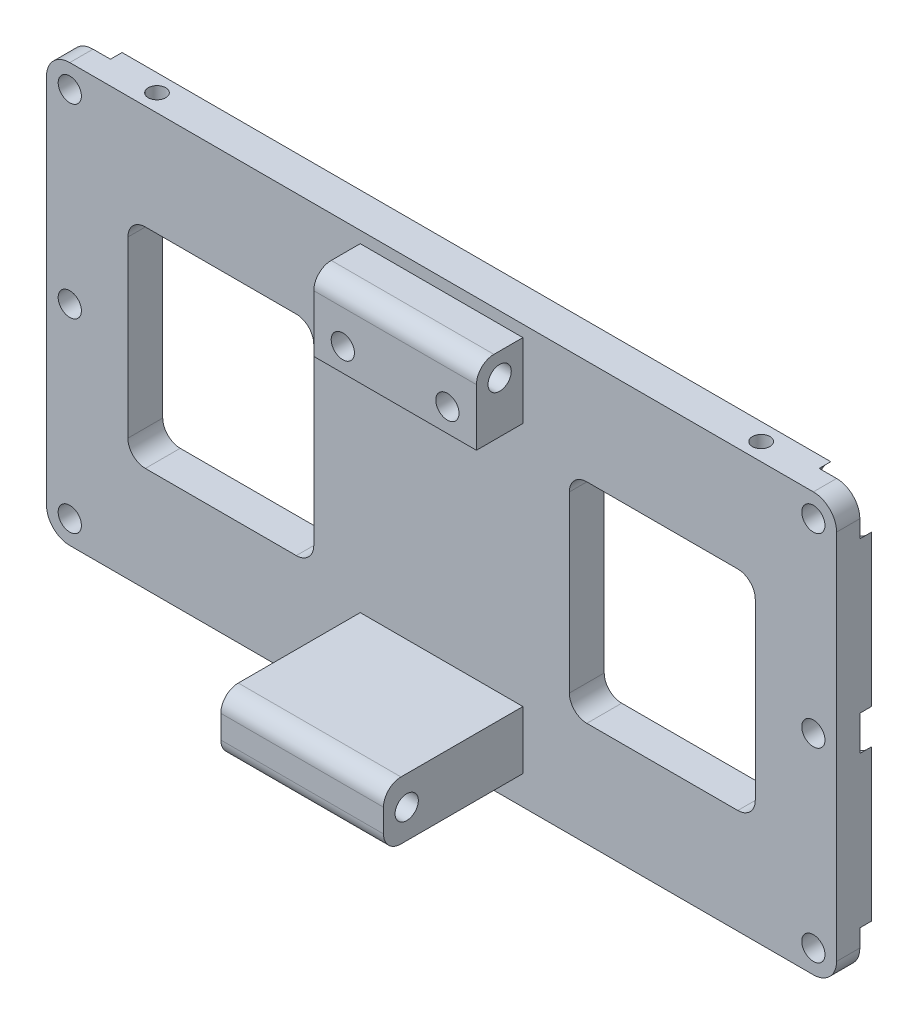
ISO-10303-21;
HEADER;
FILE_DESCRIPTION(('STEP AP214'),'2;1');
FILE_NAME('part.step','',(''),(''),'','','');
FILE_SCHEMA(('AUTOMOTIVE_DESIGN { 1 0 10303 214 1 1 1 1 }'));
ENDSEC;
DATA;
#1=APPLICATION_CONTEXT('core data for automotive mechanical design processes');
#2=APPLICATION_PROTOCOL_DEFINITION('international standard','automotive_design',2000,#1);
#3=PRODUCT_CONTEXT('',#1,'mechanical');
#4=PRODUCT('Part','Part','',(#3));
#5=PRODUCT_RELATED_PRODUCT_CATEGORY('part','',(#4));
#6=PRODUCT_DEFINITION_FORMATION('','',#4);
#7=PRODUCT_DEFINITION_CONTEXT('part definition',#1,'design');
#8=PRODUCT_DEFINITION('design','',#6,#7);
#9=PRODUCT_DEFINITION_SHAPE('','',#8);
#10=(LENGTH_UNIT() NAMED_UNIT(*) SI_UNIT(.MILLI.,.METRE.));
#11=(NAMED_UNIT(*) PLANE_ANGLE_UNIT() SI_UNIT($,.RADIAN.));
#12=(NAMED_UNIT(*) SI_UNIT($,.STERADIAN.) SOLID_ANGLE_UNIT());
#13=UNCERTAINTY_MEASURE_WITH_UNIT(LENGTH_MEASURE(1.E-05),#10,'distance_accuracy_value','');
#14=(GEOMETRIC_REPRESENTATION_CONTEXT(3) GLOBAL_UNCERTAINTY_ASSIGNED_CONTEXT((#13)) GLOBAL_UNIT_ASSIGNED_CONTEXT((#10,
#11,#12)) REPRESENTATION_CONTEXT('',''));
#15=CARTESIAN_POINT('',(0.,0.,0.));
#16=DIRECTION('',(0.,0.,1.));
#17=DIRECTION('',(1.,0.,0.));
#18=AXIS2_PLACEMENT_3D('',#15,#16,#17);
#19=CARTESIAN_POINT('',(0.,0.,0.));
#20=DIRECTION('',(0.,0.,1.));
#21=DIRECTION('',(1.,0.,0.));
#22=AXIS2_PLACEMENT_3D('',#19,#20,#21);
#23=PLANE('',#22);
#24=CARTESIAN_POINT('',(14.2875,-41.275,0.));
#25=DIRECTION('',(0.,0.,1.));
#26=DIRECTION('',(1.,0.,0.));
#27=AXIS2_PLACEMENT_3D('',#24,#25,#26);
#28=CIRCLE('',#27,3.9624);
#29=CARTESIAN_POINT('',(18.2499,-41.275,0.));
#30=VERTEX_POINT('',#29);
#31=EDGE_CURVE('E137',#30,#30,#28,.F.);
#32=ORIENTED_EDGE('',*,*,#31,.F.);
#33=EDGE_LOOP('',(#32));
#34=FACE_BOUND('',#33,.T.);
#35=DIRECTION('',(0.,-1.,0.));
#36=VECTOR('',#35,1.);
#37=CARTESIAN_POINT('',(-22.225,-33.3375,0.));
#38=LINE('',#37,#36);
#39=CARTESIAN_POINT('',(-22.225,-33.3375,0.));
#40=VERTEX_POINT('',#39);
#41=CARTESIAN_POINT('',(-22.225,-49.2125,0.));
#42=VERTEX_POINT('',#41);
#43=EDGE_CURVE('E113',#40,#42,#38,.T.);
#44=ORIENTED_EDGE('',*,*,#43,.F.);
#45=DIRECTION('',(-1.,0.,0.));
#46=VECTOR('',#45,1.);
#47=CARTESIAN_POINT('',(-22.225,-33.3375,0.));
#48=LINE('',#47,#46);
#49=CARTESIAN_POINT('',(22.225,-33.3375,0.));
#50=VERTEX_POINT('',#49);
#51=EDGE_CURVE('E130',#50,#40,#48,.T.);
#52=ORIENTED_EDGE('',*,*,#51,.F.);
#53=DIRECTION('',(0.,1.,0.));
#54=VECTOR('',#53,1.);
#55=CARTESIAN_POINT('',(22.225,-33.3375,0.));
#56=LINE('',#55,#54);
#57=CARTESIAN_POINT('',(22.225,-49.2125,0.));
#58=VERTEX_POINT('',#57);
#59=EDGE_CURVE('E115',#58,#50,#56,.T.);
#60=ORIENTED_EDGE('',*,*,#59,.F.);
#61=DIRECTION('',(1.,0.,0.));
#62=VECTOR('',#61,1.);
#63=CARTESIAN_POINT('',(-22.225,-49.2125,0.));
#64=LINE('',#63,#62);
#65=EDGE_CURVE('E102',#42,#58,#64,.T.);
#66=ORIENTED_EDGE('',*,*,#65,.F.);
#67=EDGE_LOOP('',(#44,#52,#60,#66));
#68=FACE_BOUND('',#67,.T.);
#69=CARTESIAN_POINT('',(-14.2875,-41.275,0.));
#70=DIRECTION('',(0.,0.,1.));
#71=DIRECTION('',(1.,0.,0.));
#72=AXIS2_PLACEMENT_3D('',#69,#70,#71);
#73=CIRCLE('',#72,3.96240000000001);
#74=CARTESIAN_POINT('',(-10.3251,-41.275,0.));
#75=VERTEX_POINT('',#74);
#76=EDGE_CURVE('E140',#75,#75,#73,.F.);
#77=ORIENTED_EDGE('',*,*,#76,.F.);
#78=EDGE_LOOP('',(#77));
#79=FACE_BOUND('',#78,.T.);
#80=ADVANCED_FACE('F48',(#34,#68,#79),#23,.F.);
#81=CARTESIAN_POINT('',(-22.225,-33.3375,38.1));
#82=DIRECTION('',(1.,0.,0.));
#83=DIRECTION('',(0.,1.,0.));
#84=AXIS2_PLACEMENT_3D('',#81,#82,#83);
#85=PLANE('',#84);
#86=CARTESIAN_POINT('',(-22.225,-41.275,31.75));
#87=DIRECTION('',(-1.,0.,0.));
#88=DIRECTION('',(0.,-1.,0.));
#89=AXIS2_PLACEMENT_3D('',#86,#87,#88);
#90=CIRCLE('',#89,3.175);
#91=CARTESIAN_POINT('',(-22.225,-44.45,31.75));
#92=VERTEX_POINT('',#91);
#93=EDGE_CURVE('E123',#92,#92,#90,.T.);
#94=ORIENTED_EDGE('',*,*,#93,.F.);
#95=EDGE_LOOP('',(#94));
#96=FACE_BOUND('',#95,.T.);
#97=DIRECTION('',(0.,0.,-1.));
#98=VECTOR('',#97,1.);
#99=CARTESIAN_POINT('',(-22.225,-49.2125,38.1));
#100=LINE('',#99,#98);
#101=CARTESIAN_POINT('',(-22.225,-49.2125,33.3248));
#102=VERTEX_POINT('',#101);
#103=EDGE_CURVE('E99',#102,#42,#100,.T.);
#104=ORIENTED_EDGE('',*,*,#103,.F.);
#105=CARTESIAN_POINT('',(-22.225,-44.4373,33.3248));
#106=DIRECTION('',(1.,0.,0.));
#107=DIRECTION('',(0.,1.,0.));
#108=AXIS2_PLACEMENT_3D('',#105,#106,#107);
#109=CIRCLE('',#108,4.7752);
#110=CARTESIAN_POINT('',(-22.225,-44.4373,38.1));
#111=VERTEX_POINT('',#110);
#112=EDGE_CURVE('E56',#102,#111,#109,.F.);
#113=ORIENTED_EDGE('',*,*,#112,.T.);
#114=DIRECTION('',(0.,-1.,0.));
#115=VECTOR('',#114,1.);
#116=CARTESIAN_POINT('',(-22.225,-33.3375,38.1));
#117=LINE('',#116,#115);
#118=CARTESIAN_POINT('',(-22.225,-38.1127,38.1));
#119=VERTEX_POINT('',#118);
#120=EDGE_CURVE('E132',#119,#111,#117,.T.);
#121=ORIENTED_EDGE('',*,*,#120,.F.);
#122=CARTESIAN_POINT('',(-22.225,-38.1127,33.3248));
#123=DIRECTION('',(1.,0.,0.));
#124=DIRECTION('',(0.,1.,0.));
#125=AXIS2_PLACEMENT_3D('',#122,#123,#124);
#126=CIRCLE('',#125,4.7752);
#127=CARTESIAN_POINT('',(-22.225,-33.3375,33.3248));
#128=VERTEX_POINT('',#127);
#129=EDGE_CURVE('E63',#119,#128,#126,.F.);
#130=ORIENTED_EDGE('',*,*,#129,.T.);
#131=DIRECTION('',(0.,0.,-1.));
#132=VECTOR('',#131,1.);
#133=CARTESIAN_POINT('',(-22.225,-33.3375,38.1));
#134=LINE('',#133,#132);
#135=EDGE_CURVE('E118',#128,#40,#134,.T.);
#136=ORIENTED_EDGE('',*,*,#135,.T.);
#137=ORIENTED_EDGE('',*,*,#43,.T.);
#138=EDGE_LOOP('',(#104,#113,#121,#130,#136,#137));
#139=FACE_BOUND('',#138,.T.);
#140=ADVANCED_FACE('F117',(#96,#139),#85,.F.);
#141=CARTESIAN_POINT('',(-22.225,-49.2125,38.1));
#142=DIRECTION('',(0.,1.,0.));
#143=DIRECTION('',(0.,0.,1.));
#144=AXIS2_PLACEMENT_3D('',#141,#142,#143);
#145=PLANE('',#144);
#146=DIRECTION('',(0.,0.,-1.));
#147=VECTOR('',#146,1.);
#148=CARTESIAN_POINT('',(22.225,-49.2125,38.1));
#149=LINE('',#148,#147);
#150=CARTESIAN_POINT('',(22.225,-49.2125,33.3248));
#151=VERTEX_POINT('',#150);
#152=EDGE_CURVE('E107',#151,#58,#149,.T.);
#153=ORIENTED_EDGE('',*,*,#152,.F.);
#154=DIRECTION('',(1.,0.,0.));
#155=VECTOR('',#154,1.);
#156=CARTESIAN_POINT('',(-22.225,-49.2125,33.3248));
#157=LINE('',#156,#155);
#158=EDGE_CURVE('E71',#151,#102,#157,.F.);
#159=ORIENTED_EDGE('',*,*,#158,.T.);
#160=ORIENTED_EDGE('',*,*,#103,.T.);
#161=ORIENTED_EDGE('',*,*,#65,.T.);
#162=EDGE_LOOP('',(#153,#159,#160,#161));
#163=FACE_BOUND('',#162,.T.);
#164=ADVANCED_FACE('F101',(#163),#145,.F.);
#165=CARTESIAN_POINT('',(22.225,-33.3375,38.1));
#166=DIRECTION('',(-1.,0.,0.));
#167=DIRECTION('',(0.,0.,1.));
#168=AXIS2_PLACEMENT_3D('',#165,#166,#167);
#169=PLANE('',#168);
#170=CARTESIAN_POINT('',(22.225,-41.275,31.75));
#171=DIRECTION('',(-1.,0.,0.));
#172=DIRECTION('',(0.,0.,1.));
#173=AXIS2_PLACEMENT_3D('',#170,#171,#172);
#174=CIRCLE('',#173,3.175);
#175=CARTESIAN_POINT('',(22.225,-44.45,31.75));
#176=VERTEX_POINT('',#175);
#177=EDGE_CURVE('E120',#176,#176,#174,.T.);
#178=ORIENTED_EDGE('',*,*,#177,.T.);
#179=EDGE_LOOP('',(#178));
#180=FACE_BOUND('',#179,.T.);
#181=DIRECTION('',(0.,1.,0.));
#182=VECTOR('',#181,1.);
#183=CARTESIAN_POINT('',(22.225,-33.3375,38.1));
#184=LINE('',#183,#182);
#185=CARTESIAN_POINT('',(22.225,-44.4373,38.1));
#186=VERTEX_POINT('',#185);
#187=CARTESIAN_POINT('',(22.225,-38.1127,38.1));
#188=VERTEX_POINT('',#187);
#189=EDGE_CURVE('E126',#186,#188,#184,.T.);
#190=ORIENTED_EDGE('',*,*,#189,.F.);
#191=CARTESIAN_POINT('',(22.225,-44.4373,33.3248));
#192=DIRECTION('',(-1.,0.,0.));
#193=DIRECTION('',(0.,0.,1.));
#194=AXIS2_PLACEMENT_3D('',#191,#192,#193);
#195=CIRCLE('',#194,4.7752);
#196=EDGE_CURVE('E151',#186,#151,#195,.F.);
#197=ORIENTED_EDGE('',*,*,#196,.T.);
#198=ORIENTED_EDGE('',*,*,#152,.T.);
#199=ORIENTED_EDGE('',*,*,#59,.T.);
#200=DIRECTION('',(0.,0.,-1.));
#201=VECTOR('',#200,1.);
#202=CARTESIAN_POINT('',(22.225,-33.3375,38.1));
#203=LINE('',#202,#201);
#204=CARTESIAN_POINT('',(22.225,-33.3375,33.3248));
#205=VERTEX_POINT('',#204);
#206=EDGE_CURVE('E134',#205,#50,#203,.T.);
#207=ORIENTED_EDGE('',*,*,#206,.F.);
#208=CARTESIAN_POINT('',(22.225,-38.1127,33.3248));
#209=DIRECTION('',(-1.,0.,0.));
#210=DIRECTION('',(0.,0.,1.));
#211=AXIS2_PLACEMENT_3D('',#208,#209,#210);
#212=CIRCLE('',#211,4.7752);
#213=EDGE_CURVE('E149',#205,#188,#212,.F.);
#214=ORIENTED_EDGE('',*,*,#213,.T.);
#215=EDGE_LOOP('',(#190,#197,#198,#199,#207,#214));
#216=FACE_BOUND('',#215,.T.);
#217=ADVANCED_FACE('F164',(#180,#216),#169,.F.);
#218=CARTESIAN_POINT('',(-22.225,-33.3375,38.1));
#219=DIRECTION('',(0.,-1.,0.));
#220=DIRECTION('',(1.,0.,0.));
#221=AXIS2_PLACEMENT_3D('',#218,#219,#220);
#222=PLANE('',#221);
#223=ORIENTED_EDGE('',*,*,#135,.F.);
#224=DIRECTION('',(-1.,0.,0.));
#225=VECTOR('',#224,1.);
#226=CARTESIAN_POINT('',(22.225,-33.3375,33.3248));
#227=LINE('',#226,#225);
#228=EDGE_CURVE('E12',#128,#205,#227,.F.);
#229=ORIENTED_EDGE('',*,*,#228,.T.);
#230=ORIENTED_EDGE('',*,*,#206,.T.);
#231=ORIENTED_EDGE('',*,*,#51,.T.);
#232=EDGE_LOOP('',(#223,#229,#230,#231));
#233=FACE_BOUND('',#232,.T.);
#234=ADVANCED_FACE('F170',(#233),#222,.F.);
#235=CARTESIAN_POINT('',(0.,0.,38.1));
#236=DIRECTION('',(0.,0.,1.));
#237=DIRECTION('',(1.,0.,0.));
#238=AXIS2_PLACEMENT_3D('',#235,#236,#237);
#239=PLANE('',#238);
#240=ORIENTED_EDGE('',*,*,#120,.T.);
#241=DIRECTION('',(1.,0.,0.));
#242=VECTOR('',#241,1.);
#243=CARTESIAN_POINT('',(22.225,-44.4373,38.1));
#244=LINE('',#243,#242);
#245=EDGE_CURVE('E146',#111,#186,#244,.T.);
#246=ORIENTED_EDGE('',*,*,#245,.T.);
#247=ORIENTED_EDGE('',*,*,#189,.T.);
#248=DIRECTION('',(-1.,0.,0.));
#249=VECTOR('',#248,1.);
#250=CARTESIAN_POINT('',(-22.225,-38.1127,38.1));
#251=LINE('',#250,#249);
#252=EDGE_CURVE('E106',#188,#119,#251,.T.);
#253=ORIENTED_EDGE('',*,*,#252,.T.);
#254=EDGE_LOOP('',(#240,#246,#247,#253));
#255=FACE_BOUND('',#254,.T.);
#256=ADVANCED_FACE('F158',(#255),#239,.T.);
#257=CARTESIAN_POINT('',(24.13,-41.275,31.75));
#258=DIRECTION('',(-1.,0.,0.));
#259=DIRECTION('',(0.,-1.,0.));
#260=AXIS2_PLACEMENT_3D('',#257,#258,#259);
#261=CYLINDRICAL_SURFACE('',#260,3.175);
#262=CARTESIAN_POINT('',(-22.225,-44.45,31.75));
#263=CARTESIAN_POINT('',(-21.7619791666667,-44.45,31.75));
#264=CARTESIAN_POINT('',(-21.2989583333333,-44.45,31.75));
#265=CARTESIAN_POINT('',(-20.3729166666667,-44.45,31.75));
#266=CARTESIAN_POINT('',(-19.9098958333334,-44.45,31.75));
#267=CARTESIAN_POINT('',(-18.9838541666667,-44.45,31.75));
#268=CARTESIAN_POINT('',(-18.5208333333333,-44.45,31.75));
#269=CARTESIAN_POINT('',(-17.5947916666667,-44.45,31.75));
#270=CARTESIAN_POINT('',(-17.1317708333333,-44.45,31.75));
#271=CARTESIAN_POINT('',(-16.2057291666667,-44.45,31.75));
#272=CARTESIAN_POINT('',(-15.7427083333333,-44.45,31.75));
#273=CARTESIAN_POINT('',(-14.8166666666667,-44.45,31.75));
#274=CARTESIAN_POINT('',(-14.3536458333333,-44.45,31.75));
#275=CARTESIAN_POINT('',(-13.4276041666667,-44.45,31.75));
#276=CARTESIAN_POINT('',(-12.9645833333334,-44.45,31.75));
#277=CARTESIAN_POINT('',(-12.0385416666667,-44.45,31.75));
#278=CARTESIAN_POINT('',(-11.5755208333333,-44.45,31.75));
#279=CARTESIAN_POINT('',(-10.6494791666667,-44.45,31.75));
#280=CARTESIAN_POINT('',(-10.1864583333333,-44.45,31.75));
#281=CARTESIAN_POINT('',(-9.26041666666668,-44.45,31.75));
#282=CARTESIAN_POINT('',(-8.79739583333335,-44.45,31.75));
#283=CARTESIAN_POINT('',(-7.87135416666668,-44.45,31.75));
#284=CARTESIAN_POINT('',(-7.40833333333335,-44.45,31.75));
#285=CARTESIAN_POINT('',(-6.48229166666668,-44.45,31.75));
#286=CARTESIAN_POINT('',(-6.01927083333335,-44.45,31.75));
#287=CARTESIAN_POINT('',(-5.09322916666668,-44.45,31.75));
#288=CARTESIAN_POINT('',(-4.63020833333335,-44.45,31.75));
#289=CARTESIAN_POINT('',(-3.70416666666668,-44.45,31.75));
#290=CARTESIAN_POINT('',(-3.24114583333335,-44.45,31.75));
#291=CARTESIAN_POINT('',(-2.31510416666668,-44.45,31.75));
#292=CARTESIAN_POINT('',(-1.85208333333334,-44.45,31.75));
#293=CARTESIAN_POINT('',(-0.926041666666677,-44.45,31.75));
#294=CARTESIAN_POINT('',(-0.463020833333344,-44.45,31.75));
#295=CARTESIAN_POINT('',(0.463020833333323,-44.45,31.75));
#296=CARTESIAN_POINT('',(0.926041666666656,-44.45,31.75));
#297=CARTESIAN_POINT('',(1.85208333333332,-44.45,31.75));
#298=CARTESIAN_POINT('',(2.31510416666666,-44.45,31.75));
#299=CARTESIAN_POINT('',(3.24114583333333,-44.45,31.75));
#300=CARTESIAN_POINT('',(3.70416666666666,-44.45,31.75));
#301=CARTESIAN_POINT('',(4.63020833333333,-44.45,31.75));
#302=CARTESIAN_POINT('',(5.09322916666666,-44.45,31.75));
#303=CARTESIAN_POINT('',(6.01927083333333,-44.45,31.75));
#304=CARTESIAN_POINT('',(6.48229166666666,-44.45,31.75));
#305=CARTESIAN_POINT('',(7.40833333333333,-44.45,31.75));
#306=CARTESIAN_POINT('',(7.87135416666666,-44.45,31.75));
#307=CARTESIAN_POINT('',(8.79739583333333,-44.45,31.75));
#308=CARTESIAN_POINT('',(9.26041666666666,-44.45,31.75));
#309=CARTESIAN_POINT('',(10.1864583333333,-44.45,31.75));
#310=CARTESIAN_POINT('',(10.6494791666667,-44.45,31.75));
#311=CARTESIAN_POINT('',(11.5755208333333,-44.45,31.75));
#312=CARTESIAN_POINT('',(12.0385416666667,-44.45,31.75));
#313=CARTESIAN_POINT('',(12.9645833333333,-44.45,31.75));
#314=CARTESIAN_POINT('',(13.4276041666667,-44.45,31.75));
#315=CARTESIAN_POINT('',(14.3536458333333,-44.45,31.75));
#316=CARTESIAN_POINT('',(14.8166666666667,-44.45,31.75));
#317=CARTESIAN_POINT('',(15.7427083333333,-44.45,31.75));
#318=CARTESIAN_POINT('',(16.2057291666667,-44.45,31.75));
#319=CARTESIAN_POINT('',(17.1317708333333,-44.45,31.75));
#320=CARTESIAN_POINT('',(17.5947916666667,-44.45,31.75));
#321=CARTESIAN_POINT('',(18.5208333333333,-44.45,31.75));
#322=CARTESIAN_POINT('',(18.9838541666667,-44.45,31.75));
#323=CARTESIAN_POINT('',(19.9098958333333,-44.45,31.75));
#324=CARTESIAN_POINT('',(20.3729166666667,-44.45,31.75));
#325=CARTESIAN_POINT('',(21.2989583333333,-44.45,31.75));
#326=CARTESIAN_POINT('',(21.7619791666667,-44.45,31.75));
#327=CARTESIAN_POINT('',(22.225,-44.45,31.75));
#328=B_SPLINE_CURVE_WITH_KNOTS('',3,(#262,#263,#264,#265,#266,#267,#268,#269,#270,#271,#272,
#273,#274,#275,#276,#277,#278,#279,#280,#281,#282,#283,#284,#285,#286,#287,#288,#289,#290,#291,
#292,#293,#294,#295,#296,#297,#298,#299,#300,#301,#302,#303,#304,#305,#306,#307,#308,#309,#310,
#311,#312,#313,#314,#315,#316,#317,#318,#319,#320,#321,#322,#323,#324,#325,#326,#327),
.UNSPECIFIED.,.F.,.F.,(4,2,2,2,2,2,2,2,2,2,2,2,2,2,2,2,2,2,2,2,2,2,2,2,2,2,2,2,2,2,2,2,4),(0.,
1.3890625,2.778125,4.1671875,5.55625000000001,6.9453125,8.334375,9.7234375,11.1125,12.5015625,
13.890625,15.2796875,16.66875,18.0578125,19.446875,20.8359375,22.225,23.6140625,25.003125,
26.3921875,27.78125,29.1703125,30.559375,31.9484375,33.3375,34.7265625,36.115625,37.5046875,
38.89375,40.2828125,41.671875,43.0609375,44.45),.UNSPECIFIED.);
#329=EDGE_CURVE('BSEAM177',#92,#176,#328,.T.);
#330=ORIENTED_EDGE('',*,*,#93,.T.);
#331=ORIENTED_EDGE('',*,*,#177,.F.);
#332=ORIENTED_EDGE('',*,*,#329,.T.);
#333=ORIENTED_EDGE('',*,*,#329,.F.);
#334=EDGE_LOOP('',(#330,#332,#331,#333));
#335=FACE_BOUND('',#334,.T.);
#336=ADVANCED_FACE('F177',(#335),#261,.F.);
#337=CARTESIAN_POINT('',(14.2875,-41.275,15.875));
#338=DIRECTION('',(0.,0.,-1.));
#339=DIRECTION('',(-1.,0.,0.));
#340=AXIS2_PLACEMENT_3D('',#337,#338,#339);
#341=CYLINDRICAL_SURFACE('',#340,3.9624);
#342=CARTESIAN_POINT('',(14.2875,-41.275,15.875));
#343=DIRECTION('',(0.,0.,1.));
#344=DIRECTION('',(1.,0.,0.));
#345=AXIS2_PLACEMENT_3D('',#342,#343,#344);
#346=CIRCLE('',#345,3.9624);
#347=CARTESIAN_POINT('',(18.2499,-41.275,15.875));
#348=VERTEX_POINT('',#347);
#349=EDGE_CURVE('E214',#348,#348,#346,.T.);
#350=ORIENTED_EDGE('',*,*,#349,.T.);
#351=EDGE_LOOP('',(#350));
#352=FACE_BOUND('',#351,.T.);
#353=ORIENTED_EDGE('',*,*,#31,.T.);
#354=EDGE_LOOP('',(#353));
#355=FACE_BOUND('',#354,.T.);
#356=ADVANCED_FACE('F193',(#352,#355),#341,.F.);
#357=CARTESIAN_POINT('',(14.2875,-41.275,15.875));
#358=DIRECTION('',(0.,0.,1.));
#359=DIRECTION('',(1.,0.,0.));
#360=AXIS2_PLACEMENT_3D('',#357,#358,#359);
#361=PLANE('',#360);
#362=ORIENTED_EDGE('',*,*,#349,.F.);
#363=EDGE_LOOP('',(#362));
#364=FACE_BOUND('',#363,.T.);
#365=ADVANCED_FACE('F197',(#364),#361,.F.);
#366=CARTESIAN_POINT('',(-14.2875,-41.275,15.875));
#367=DIRECTION('',(0.,0.,-1.));
#368=DIRECTION('',(-1.,0.,0.));
#369=AXIS2_PLACEMENT_3D('',#366,#367,#368);
#370=CYLINDRICAL_SURFACE('',#369,3.96240000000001);
#371=CARTESIAN_POINT('',(-14.2875,-41.275,15.875));
#372=DIRECTION('',(0.,0.,1.));
#373=DIRECTION('',(1.,0.,0.));
#374=AXIS2_PLACEMENT_3D('',#371,#372,#373);
#375=CIRCLE('',#374,3.96240000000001);
#376=CARTESIAN_POINT('',(-10.3251,-41.275,15.875));
#377=VERTEX_POINT('',#376);
#378=EDGE_CURVE('E141',#377,#377,#375,.T.);
#379=ORIENTED_EDGE('',*,*,#378,.T.);
#380=EDGE_LOOP('',(#379));
#381=FACE_BOUND('',#380,.T.);
#382=ORIENTED_EDGE('',*,*,#76,.T.);
#383=EDGE_LOOP('',(#382));
#384=FACE_BOUND('',#383,.T.);
#385=ADVANCED_FACE('F201',(#381,#384),#370,.F.);
#386=CARTESIAN_POINT('',(-14.2875,-41.275,15.875));
#387=DIRECTION('',(0.,0.,1.));
#388=DIRECTION('',(1.,0.,0.));
#389=AXIS2_PLACEMENT_3D('',#386,#387,#388);
#390=PLANE('',#389);
#391=ORIENTED_EDGE('',*,*,#378,.F.);
#392=EDGE_LOOP('',(#391));
#393=FACE_BOUND('',#392,.T.);
#394=ADVANCED_FACE('F205',(#393),#390,.F.);
#395=CARTESIAN_POINT('',(0.,-44.4373,33.3248));
#396=DIRECTION('',(-1.,0.,0.));
#397=DIRECTION('',(0.,0.,1.));
#398=AXIS2_PLACEMENT_3D('',#395,#396,#397);
#399=CYLINDRICAL_SURFACE('',#398,4.7752);
#400=ORIENTED_EDGE('',*,*,#112,.F.);
#401=ORIENTED_EDGE('',*,*,#158,.F.);
#402=ORIENTED_EDGE('',*,*,#196,.F.);
#403=ORIENTED_EDGE('',*,*,#245,.F.);
#404=EDGE_LOOP('',(#400,#401,#402,#403));
#405=FACE_BOUND('',#404,.T.);
#406=ADVANCED_FACE('F162',(#405),#399,.T.);
#407=CARTESIAN_POINT('',(0.,-38.1127,33.3248));
#408=DIRECTION('',(1.,0.,0.));
#409=DIRECTION('',(0.,1.,0.));
#410=AXIS2_PLACEMENT_3D('',#407,#408,#409);
#411=CYLINDRICAL_SURFACE('',#410,4.7752);
#412=ORIENTED_EDGE('',*,*,#213,.F.);
#413=ORIENTED_EDGE('',*,*,#228,.F.);
#414=ORIENTED_EDGE('',*,*,#129,.F.);
#415=ORIENTED_EDGE('',*,*,#252,.F.);
#416=EDGE_LOOP('',(#412,#413,#414,#415));
#417=FACE_BOUND('',#416,.T.);
#418=ADVANCED_FACE('F50',(#417),#411,.T.);
#419=CLOSED_SHELL('',(#80,#140,#164,#217,#234,#256,#336,#356,#365,#385,#394,#406,#418));
#420=MANIFOLD_SOLID_BREP('B2',#419);
#421=CARTESIAN_POINT('',(-22.225,53.9749999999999,12.7));
#422=DIRECTION('',(1.,0.,0.));
#423=DIRECTION('',(0.,1.,0.));
#424=AXIS2_PLACEMENT_3D('',#421,#422,#423);
#425=PLANE('',#424);
#426=CARTESIAN_POINT('',(-22.225,47.625,6.35));
#427=DIRECTION('',(-1.,0.,0.));
#428=DIRECTION('',(0.,-1.,0.));
#429=AXIS2_PLACEMENT_3D('',#426,#427,#428);
#430=CIRCLE('',#429,3.175);
#431=CARTESIAN_POINT('',(-22.225,44.45,6.35));
#432=VERTEX_POINT('',#431);
#433=EDGE_CURVE('E390',#432,#432,#430,.T.);
#434=ORIENTED_EDGE('',*,*,#433,.F.);
#435=EDGE_LOOP('',(#434));
#436=FACE_BOUND('',#435,.T.);
#437=DIRECTION('',(0.,-1.,0.));
#438=VECTOR('',#437,1.);
#439=CARTESIAN_POINT('',(-22.225,53.9749999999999,12.7));
#440=LINE('',#439,#438);
#441=CARTESIAN_POINT('',(-22.225,49.1997999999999,12.7));
#442=VERTEX_POINT('',#441);
#443=CARTESIAN_POINT('',(-22.225,33.6549999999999,12.7));
#444=VERTEX_POINT('',#443);
#445=EDGE_CURVE('E358',#442,#444,#440,.T.);
#446=ORIENTED_EDGE('',*,*,#445,.F.);
#447=CARTESIAN_POINT('',(-22.225,49.1997999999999,7.9248));
#448=DIRECTION('',(1.,0.,0.));
#449=DIRECTION('',(0.,1.,0.));
#450=AXIS2_PLACEMENT_3D('',#447,#448,#449);
#451=CIRCLE('',#450,4.7752);
#452=CARTESIAN_POINT('',(-22.225,53.9749999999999,7.9248));
#453=VERTEX_POINT('',#452);
#454=EDGE_CURVE('E336',#442,#453,#451,.F.);
#455=ORIENTED_EDGE('',*,*,#454,.T.);
#456=DIRECTION('',(0.,0.,-1.));
#457=VECTOR('',#456,1.);
#458=CARTESIAN_POINT('',(-22.225,53.9749999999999,12.7));
#459=LINE('',#458,#457);
#460=CARTESIAN_POINT('',(-22.225,53.9749999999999,0.));
#461=VERTEX_POINT('',#460);
#462=EDGE_CURVE('E411',#453,#461,#459,.T.);
#463=ORIENTED_EDGE('',*,*,#462,.T.);
#464=DIRECTION('',(0.,-1.,0.));
#465=VECTOR('',#464,1.);
#466=CARTESIAN_POINT('',(-22.225,53.9749999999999,0.));
#467=LINE('',#466,#465);
#468=CARTESIAN_POINT('',(-22.225,33.6549999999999,0.));
#469=VERTEX_POINT('',#468);
#470=EDGE_CURVE('E380',#461,#469,#467,.T.);
#471=ORIENTED_EDGE('',*,*,#470,.T.);
#472=DIRECTION('',(0.,0.,-1.));
#473=VECTOR('',#472,1.);
#474=CARTESIAN_POINT('',(-22.225,33.6549999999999,12.7));
#475=LINE('',#474,#473);
#476=EDGE_CURVE('E372',#444,#469,#475,.T.);
#477=ORIENTED_EDGE('',*,*,#476,.F.);
#478=EDGE_LOOP('',(#446,#455,#463,#471,#477));
#479=FACE_BOUND('',#478,.T.);
#480=ADVANCED_FACE('F314',(#436,#479),#425,.F.);
#481=CARTESIAN_POINT('',(-22.225,33.6549999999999,12.7));
#482=DIRECTION('',(0.,1.,0.));
#483=DIRECTION('',(0.,0.,1.));
#484=AXIS2_PLACEMENT_3D('',#481,#482,#483);
#485=PLANE('',#484);
#486=DIRECTION('',(1.,0.,0.));
#487=VECTOR('',#486,1.);
#488=CARTESIAN_POINT('',(-22.225,33.6549999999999,0.));
#489=LINE('',#488,#487);
#490=CARTESIAN_POINT('',(22.225,33.6549999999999,0.));
#491=VERTEX_POINT('',#490);
#492=EDGE_CURVE('E413',#469,#491,#489,.T.);
#493=ORIENTED_EDGE('',*,*,#492,.T.);
#494=DIRECTION('',(0.,0.,-1.));
#495=VECTOR('',#494,1.);
#496=CARTESIAN_POINT('',(22.225,33.6549999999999,12.7));
#497=LINE('',#496,#495);
#498=CARTESIAN_POINT('',(22.225,33.6549999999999,12.7));
#499=VERTEX_POINT('',#498);
#500=EDGE_CURVE('E375',#499,#491,#497,.T.);
#501=ORIENTED_EDGE('',*,*,#500,.F.);
#502=DIRECTION('',(1.,0.,0.));
#503=VECTOR('',#502,1.);
#504=CARTESIAN_POINT('',(-22.225,33.6549999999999,12.7));
#505=LINE('',#504,#503);
#506=EDGE_CURVE('E362',#444,#499,#505,.T.);
#507=ORIENTED_EDGE('',*,*,#506,.F.);
#508=ORIENTED_EDGE('',*,*,#476,.T.);
#509=EDGE_LOOP('',(#493,#501,#507,#508));
#510=FACE_BOUND('',#509,.T.);
#511=ADVANCED_FACE('F371',(#510),#485,.F.);
#512=CARTESIAN_POINT('',(22.225,53.9749999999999,12.7));
#513=DIRECTION('',(-1.,0.,0.));
#514=DIRECTION('',(0.,-1.,0.));
#515=AXIS2_PLACEMENT_3D('',#512,#513,#514);
#516=PLANE('',#515);
#517=CARTESIAN_POINT('',(22.225,47.625,6.35));
#518=DIRECTION('',(-1.,0.,0.));
#519=DIRECTION('',(0.,-1.,0.));
#520=AXIS2_PLACEMENT_3D('',#517,#518,#519);
#521=CIRCLE('',#520,3.175);
#522=CARTESIAN_POINT('',(22.225,44.45,6.35));
#523=VERTEX_POINT('',#522);
#524=EDGE_CURVE('E387',#523,#523,#521,.T.);
#525=ORIENTED_EDGE('',*,*,#524,.T.);
#526=EDGE_LOOP('',(#525));
#527=FACE_BOUND('',#526,.T.);
#528=DIRECTION('',(0.,0.,-1.));
#529=VECTOR('',#528,1.);
#530=CARTESIAN_POINT('',(22.225,53.9749999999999,12.7));
#531=LINE('',#530,#529);
#532=CARTESIAN_POINT('',(22.225,53.9749999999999,7.9248));
#533=VERTEX_POINT('',#532);
#534=CARTESIAN_POINT('',(22.225,53.9749999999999,0.));
#535=VERTEX_POINT('',#534);
#536=EDGE_CURVE('E383',#533,#535,#531,.T.);
#537=ORIENTED_EDGE('',*,*,#536,.F.);
#538=CARTESIAN_POINT('',(22.225,49.1997999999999,7.9248));
#539=DIRECTION('',(-1.,0.,0.));
#540=DIRECTION('',(0.,-1.,0.));
#541=AXIS2_PLACEMENT_3D('',#538,#539,#540);
#542=CIRCLE('',#541,4.7752);
#543=CARTESIAN_POINT('',(22.225,49.1997999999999,12.7));
#544=VERTEX_POINT('',#543);
#545=EDGE_CURVE('E46',#533,#544,#542,.F.);
#546=ORIENTED_EDGE('',*,*,#545,.T.);
#547=DIRECTION('',(0.,1.,0.));
#548=VECTOR('',#547,1.);
#549=CARTESIAN_POINT('',(22.225,53.9749999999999,12.7));
#550=LINE('',#549,#548);
#551=EDGE_CURVE('E377',#499,#544,#550,.T.);
#552=ORIENTED_EDGE('',*,*,#551,.F.);
#553=ORIENTED_EDGE('',*,*,#500,.T.);
#554=DIRECTION('',(0.,1.,0.));
#555=VECTOR('',#554,1.);
#556=CARTESIAN_POINT('',(22.225,53.9749999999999,0.));
#557=LINE('',#556,#555);
#558=EDGE_CURVE('E415',#491,#535,#557,.T.);
#559=ORIENTED_EDGE('',*,*,#558,.T.);
#560=EDGE_LOOP('',(#537,#546,#552,#553,#559));
#561=FACE_BOUND('',#560,.T.);
#562=ADVANCED_FACE('F425',(#527,#561),#516,.F.);
#563=CARTESIAN_POINT('',(-22.225,53.9749999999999,12.7));
#564=DIRECTION('',(0.,-1.,0.));
#565=DIRECTION('',(0.,0.,-1.));
#566=AXIS2_PLACEMENT_3D('',#563,#564,#565);
#567=PLANE('',#566);
#568=ORIENTED_EDGE('',*,*,#462,.F.);
#569=DIRECTION('',(-1.,0.,0.));
#570=VECTOR('',#569,1.);
#571=CARTESIAN_POINT('',(22.225,53.9749999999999,7.9248));
#572=LINE('',#571,#570);
#573=EDGE_CURVE('E322',#453,#533,#572,.F.);
#574=ORIENTED_EDGE('',*,*,#573,.T.);
#575=ORIENTED_EDGE('',*,*,#536,.T.);
#576=DIRECTION('',(-1.,0.,0.));
#577=VECTOR('',#576,1.);
#578=CARTESIAN_POINT('',(-22.225,53.9749999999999,0.));
#579=LINE('',#578,#577);
#580=EDGE_CURVE('E367',#535,#461,#579,.T.);
#581=ORIENTED_EDGE('',*,*,#580,.T.);
#582=EDGE_LOOP('',(#568,#574,#575,#581));
#583=FACE_BOUND('',#582,.T.);
#584=ADVANCED_FACE('F420',(#583),#567,.F.);
#585=CARTESIAN_POINT('',(0.,0.,12.7));
#586=DIRECTION('',(0.,0.,1.));
#587=DIRECTION('',(1.,0.,0.));
#588=AXIS2_PLACEMENT_3D('',#585,#586,#587);
#589=PLANE('',#588);
#590=CARTESIAN_POINT('',(-14.2875,40.005,12.7));
#591=DIRECTION('',(0.,0.,1.));
#592=DIRECTION('',(1.,0.,0.));
#593=AXIS2_PLACEMENT_3D('',#590,#591,#592);
#594=CIRCLE('',#593,3.175);
#595=CARTESIAN_POINT('',(-11.1125,40.005,12.7));
#596=VERTEX_POINT('',#595);
#597=EDGE_CURVE('E397',#596,#596,#594,.T.);
#598=ORIENTED_EDGE('',*,*,#597,.F.);
#599=EDGE_LOOP('',(#598));
#600=FACE_BOUND('',#599,.T.);
#601=CARTESIAN_POINT('',(14.2875,40.005,12.7));
#602=DIRECTION('',(0.,0.,1.));
#603=DIRECTION('',(1.,0.,0.));
#604=AXIS2_PLACEMENT_3D('',#601,#602,#603);
#605=CIRCLE('',#604,3.175);
#606=CARTESIAN_POINT('',(17.4625,40.005,12.7));
#607=VERTEX_POINT('',#606);
#608=EDGE_CURVE('E394',#607,#607,#605,.T.);
#609=ORIENTED_EDGE('',*,*,#608,.F.);
#610=EDGE_LOOP('',(#609));
#611=FACE_BOUND('',#610,.T.);
#612=ORIENTED_EDGE('',*,*,#551,.T.);
#613=DIRECTION('',(-1.,0.,0.));
#614=VECTOR('',#613,1.);
#615=CARTESIAN_POINT('',(-22.225,49.1997999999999,12.7));
#616=LINE('',#615,#614);
#617=EDGE_CURVE('E365',#544,#442,#616,.T.);
#618=ORIENTED_EDGE('',*,*,#617,.T.);
#619=ORIENTED_EDGE('',*,*,#445,.T.);
#620=ORIENTED_EDGE('',*,*,#506,.T.);
#621=EDGE_LOOP('',(#612,#618,#619,#620));
#622=FACE_BOUND('',#621,.T.);
#623=ADVANCED_FACE('F361',(#600,#611,#622),#589,.T.);
#624=CARTESIAN_POINT('',(0.,0.,0.));
#625=DIRECTION('',(0.,0.,1.));
#626=DIRECTION('',(1.,0.,0.));
#627=AXIS2_PLACEMENT_3D('',#624,#625,#626);
#628=PLANE('',#627);
#629=CARTESIAN_POINT('',(-14.2875,40.005,0.));
#630=DIRECTION('',(0.,0.,1.));
#631=DIRECTION('',(1.,0.,0.));
#632=AXIS2_PLACEMENT_3D('',#629,#630,#631);
#633=CIRCLE('',#632,3.175);
#634=CARTESIAN_POINT('',(-11.1125,40.005,0.));
#635=VERTEX_POINT('',#634);
#636=EDGE_CURVE('E395',#635,#635,#633,.T.);
#637=ORIENTED_EDGE('',*,*,#636,.T.);
#638=EDGE_LOOP('',(#637));
#639=FACE_BOUND('',#638,.T.);
#640=CARTESIAN_POINT('',(14.2875,40.005,0.));
#641=DIRECTION('',(0.,0.,1.));
#642=DIRECTION('',(1.,0.,0.));
#643=AXIS2_PLACEMENT_3D('',#640,#641,#642);
#644=CIRCLE('',#643,3.175);
#645=CARTESIAN_POINT('',(17.4625,40.005,0.));
#646=VERTEX_POINT('',#645);
#647=EDGE_CURVE('E391',#646,#646,#644,.T.);
#648=ORIENTED_EDGE('',*,*,#647,.T.);
#649=EDGE_LOOP('',(#648));
#650=FACE_BOUND('',#649,.T.);
#651=ORIENTED_EDGE('',*,*,#470,.F.);
#652=ORIENTED_EDGE('',*,*,#580,.F.);
#653=ORIENTED_EDGE('',*,*,#558,.F.);
#654=ORIENTED_EDGE('',*,*,#492,.F.);
#655=EDGE_LOOP('',(#651,#652,#653,#654));
#656=FACE_BOUND('',#655,.T.);
#657=ADVANCED_FACE('F427',(#639,#650,#656),#628,.F.);
#658=CARTESIAN_POINT('',(23.495,47.625,6.35));
#659=DIRECTION('',(-1.,0.,0.));
#660=DIRECTION('',(0.,-1.,0.));
#661=AXIS2_PLACEMENT_3D('',#658,#659,#660);
#662=CYLINDRICAL_SURFACE('',#661,3.175);
#663=ORIENTED_EDGE('',*,*,#433,.T.);
#664=EDGE_LOOP('',(#663));
#665=FACE_BOUND('',#664,.T.);
#666=ORIENTED_EDGE('',*,*,#524,.F.);
#667=EDGE_LOOP('',(#666));
#668=FACE_BOUND('',#667,.T.);
#669=ADVANCED_FACE('F429',(#665,#668),#662,.F.);
#670=CARTESIAN_POINT('',(14.2875,40.005,-22.86));
#671=DIRECTION('',(0.,0.,1.));
#672=DIRECTION('',(1.,0.,0.));
#673=AXIS2_PLACEMENT_3D('',#670,#671,#672);
#674=CYLINDRICAL_SURFACE('',#673,3.175);
#675=ORIENTED_EDGE('',*,*,#608,.T.);
#676=EDGE_LOOP('',(#675));
#677=FACE_BOUND('',#676,.T.);
#678=ORIENTED_EDGE('',*,*,#647,.F.);
#679=EDGE_LOOP('',(#678));
#680=FACE_BOUND('',#679,.T.);
#681=ADVANCED_FACE('F435',(#677,#680),#674,.F.);
#682=CARTESIAN_POINT('',(-14.2875,40.005,-22.86));
#683=DIRECTION('',(0.,0.,1.));
#684=DIRECTION('',(1.,0.,0.));
#685=AXIS2_PLACEMENT_3D('',#682,#683,#684);
#686=CYLINDRICAL_SURFACE('',#685,3.175);
#687=ORIENTED_EDGE('',*,*,#597,.T.);
#688=EDGE_LOOP('',(#687));
#689=FACE_BOUND('',#688,.T.);
#690=ORIENTED_EDGE('',*,*,#636,.F.);
#691=EDGE_LOOP('',(#690));
#692=FACE_BOUND('',#691,.T.);
#693=ADVANCED_FACE('F470',(#689,#692),#686,.F.);
#694=CARTESIAN_POINT('',(0.,49.1997999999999,7.9248));
#695=DIRECTION('',(1.,0.,0.));
#696=DIRECTION('',(0.,0.,-1.));
#697=AXIS2_PLACEMENT_3D('',#694,#695,#696);
#698=CYLINDRICAL_SURFACE('',#697,4.7752);
#699=ORIENTED_EDGE('',*,*,#545,.F.);
#700=ORIENTED_EDGE('',*,*,#573,.F.);
#701=ORIENTED_EDGE('',*,*,#454,.F.);
#702=ORIENTED_EDGE('',*,*,#617,.F.);
#703=EDGE_LOOP('',(#699,#700,#701,#702));
#704=FACE_BOUND('',#703,.T.);
#705=ADVANCED_FACE('F316',(#704),#698,.T.);
#706=CLOSED_SHELL('',(#480,#511,#562,#584,#623,#657,#669,#681,#693,#705));
#707=MANIFOLD_SOLID_BREP('B6',#706);
#708=CARTESIAN_POINT('',(0.,0.,-9.525));
#709=DIRECTION('',(0.,0.,1.));
#710=DIRECTION('',(1.,0.,0.));
#711=AXIS2_PLACEMENT_3D('',#708,#709,#710);
#712=PLANE('',#711);
#713=CARTESIAN_POINT('',(14.2875,-41.275,-9.525));
#714=DIRECTION('',(0.,0.,1.));
#715=DIRECTION('',(1.,0.,0.));
#716=AXIS2_PLACEMENT_3D('',#713,#714,#715);
#717=CIRCLE('',#716,3.9624);
#718=CARTESIAN_POINT('',(18.2499,-41.275,-9.525));
#719=VERTEX_POINT('',#718);
#720=EDGE_CURVE('E947',#719,#719,#717,.F.);
#721=ORIENTED_EDGE('',*,*,#720,.F.);
#722=EDGE_LOOP('',(#721));
#723=FACE_BOUND('',#722,.T.);
#724=CARTESIAN_POINT('',(-14.2875,40.005,-9.525));
#725=DIRECTION('',(0.,0.,1.));
#726=DIRECTION('',(1.,0.,0.));
#727=AXIS2_PLACEMENT_3D('',#724,#725,#726);
#728=CIRCLE('',#727,3.175);
#729=CARTESIAN_POINT('',(-11.1125,40.005,-9.525));
#730=VERTEX_POINT('',#729);
#731=EDGE_CURVE('E943',#730,#730,#728,.T.);
#732=ORIENTED_EDGE('',*,*,#731,.T.);
#733=EDGE_LOOP('',(#732));
#734=FACE_BOUND('',#733,.T.);
#735=CARTESIAN_POINT('',(14.2875,40.005,-9.525));
#736=DIRECTION('',(0.,0.,1.));
#737=DIRECTION('',(1.,0.,0.));
#738=AXIS2_PLACEMENT_3D('',#735,#736,#737);
#739=CIRCLE('',#738,3.175);
#740=CARTESIAN_POINT('',(17.4625,40.005,-9.525));
#741=VERTEX_POINT('',#740);
#742=EDGE_CURVE('E938',#741,#741,#739,.T.);
#743=ORIENTED_EDGE('',*,*,#742,.T.);
#744=EDGE_LOOP('',(#743));
#745=FACE_BOUND('',#744,.T.);
#746=DIRECTION('',(0.,1.,0.));
#747=VECTOR('',#746,1.);
#748=CARTESIAN_POINT('',(85.725,28.575,-9.525));
#749=LINE('',#748,#747);
#750=CARTESIAN_POINT('',(85.725,-23.7998,-9.525));
#751=VERTEX_POINT('',#750);
#752=CARTESIAN_POINT('',(85.725,23.7998,-9.525));
#753=VERTEX_POINT('',#752);
#754=EDGE_CURVE('E1084',#751,#753,#749,.T.);
#755=ORIENTED_EDGE('',*,*,#754,.T.);
#756=CARTESIAN_POINT('',(80.9498,23.7998,-9.525));
#757=DIRECTION('',(0.,0.,1.));
#758=DIRECTION('',(1.,0.,0.));
#759=AXIS2_PLACEMENT_3D('',#756,#757,#758);
#760=CIRCLE('',#759,4.7752);
#761=CARTESIAN_POINT('',(80.9498,28.575,-9.525));
#762=VERTEX_POINT('',#761);
#763=EDGE_CURVE('E841',#753,#762,#760,.T.);
#764=ORIENTED_EDGE('',*,*,#763,.T.);
#765=DIRECTION('',(-1.,0.,0.));
#766=VECTOR('',#765,1.);
#767=CARTESIAN_POINT('',(34.925,28.575,-9.525));
#768=LINE('',#767,#766);
#769=CARTESIAN_POINT('',(39.7002,28.575,-9.525));
#770=VERTEX_POINT('',#769);
#771=EDGE_CURVE('E895',#762,#770,#768,.T.);
#772=ORIENTED_EDGE('',*,*,#771,.T.);
#773=CARTESIAN_POINT('',(39.7002,23.7998,-9.525));
#774=DIRECTION('',(0.,0.,1.));
#775=DIRECTION('',(1.,0.,0.));
#776=AXIS2_PLACEMENT_3D('',#773,#774,#775);
#777=CIRCLE('',#776,4.7752);
#778=CARTESIAN_POINT('',(34.925,23.7998,-9.525));
#779=VERTEX_POINT('',#778);
#780=EDGE_CURVE('E845',#770,#779,#777,.T.);
#781=ORIENTED_EDGE('',*,*,#780,.T.);
#782=DIRECTION('',(0.,-1.,0.));
#783=VECTOR('',#782,1.);
#784=CARTESIAN_POINT('',(34.925,28.575,-9.525));
#785=LINE('',#784,#783);
#786=CARTESIAN_POINT('',(34.925,-23.7998,-9.525));
#787=VERTEX_POINT('',#786);
#788=EDGE_CURVE('E1078',#779,#787,#785,.T.);
#789=ORIENTED_EDGE('',*,*,#788,.T.);
#790=CARTESIAN_POINT('',(39.7002,-23.7998,-9.525));
#791=DIRECTION('',(0.,0.,1.));
#792=DIRECTION('',(1.,0.,0.));
#793=AXIS2_PLACEMENT_3D('',#790,#791,#792);
#794=CIRCLE('',#793,4.7752);
#795=CARTESIAN_POINT('',(39.7002,-28.575,-9.525));
#796=VERTEX_POINT('',#795);
#797=EDGE_CURVE('E833',#787,#796,#794,.T.);
#798=ORIENTED_EDGE('',*,*,#797,.T.);
#799=DIRECTION('',(1.,0.,0.));
#800=VECTOR('',#799,1.);
#801=CARTESIAN_POINT('',(34.925,-28.575,-9.525));
#802=LINE('',#801,#800);
#803=CARTESIAN_POINT('',(80.9498,-28.575,-9.525));
#804=VERTEX_POINT('',#803);
#805=EDGE_CURVE('E1081',#796,#804,#802,.T.);
#806=ORIENTED_EDGE('',*,*,#805,.T.);
#807=CARTESIAN_POINT('',(80.9498,-23.7998,-9.525));
#808=DIRECTION('',(0.,0.,1.));
#809=DIRECTION('',(1.,0.,0.));
#810=AXIS2_PLACEMENT_3D('',#807,#808,#809);
#811=CIRCLE('',#810,4.7752);
#812=EDGE_CURVE('E837',#804,#751,#811,.T.);
#813=ORIENTED_EDGE('',*,*,#812,.T.);
#814=EDGE_LOOP('',(#755,#764,#772,#781,#789,#798,#806,#813));
#815=FACE_BOUND('',#814,.T.);
#816=DIRECTION('',(0.,1.,0.));
#817=VECTOR('',#816,1.);
#818=CARTESIAN_POINT('',(-34.925,28.575,-9.525));
#819=LINE('',#818,#817);
#820=CARTESIAN_POINT('',(-34.925,-23.7998,-9.525));
#821=VERTEX_POINT('',#820);
#822=CARTESIAN_POINT('',(-34.925,23.7998,-9.525));
#823=VERTEX_POINT('',#822);
#824=EDGE_CURVE('E884',#821,#823,#819,.T.);
#825=ORIENTED_EDGE('',*,*,#824,.T.);
#826=CARTESIAN_POINT('',(-39.7002,23.7998,-9.525));
#827=DIRECTION('',(0.,0.,1.));
#828=DIRECTION('',(1.,0.,0.));
#829=AXIS2_PLACEMENT_3D('',#826,#827,#828);
#830=CIRCLE('',#829,4.7752);
#831=CARTESIAN_POINT('',(-39.7002,28.575,-9.525));
#832=VERTEX_POINT('',#831);
#833=EDGE_CURVE('E549',#823,#832,#830,.T.);
#834=ORIENTED_EDGE('',*,*,#833,.T.);
#835=DIRECTION('',(-1.,0.,0.));
#836=VECTOR('',#835,1.);
#837=CARTESIAN_POINT('',(-85.725,28.575,-9.525));
#838=LINE('',#837,#836);
#839=CARTESIAN_POINT('',(-80.9498,28.575,-9.525));
#840=VERTEX_POINT('',#839);
#841=EDGE_CURVE('E877',#832,#840,#838,.T.);
#842=ORIENTED_EDGE('',*,*,#841,.T.);
#843=CARTESIAN_POINT('',(-80.9498,23.7998,-9.525));
#844=DIRECTION('',(0.,0.,1.));
#845=DIRECTION('',(1.,0.,0.));
#846=AXIS2_PLACEMENT_3D('',#843,#844,#845);
#847=CIRCLE('',#846,4.7752);
#848=CARTESIAN_POINT('',(-85.725,23.7998,-9.525));
#849=VERTEX_POINT('',#848);
#850=EDGE_CURVE('E312',#840,#849,#847,.T.);
#851=ORIENTED_EDGE('',*,*,#850,.T.);
#852=DIRECTION('',(0.,-1.,0.));
#853=VECTOR('',#852,1.);
#854=CARTESIAN_POINT('',(-85.725,28.575,-9.525));
#855=LINE('',#854,#853);
#856=CARTESIAN_POINT('',(-85.725,-23.7998,-9.525));
#857=VERTEX_POINT('',#856);
#858=EDGE_CURVE('E869',#849,#857,#855,.T.);
#859=ORIENTED_EDGE('',*,*,#858,.T.);
#860=CARTESIAN_POINT('',(-80.9498,-23.7998,-9.525));
#861=DIRECTION('',(0.,0.,1.));
#862=DIRECTION('',(1.,0.,0.));
#863=AXIS2_PLACEMENT_3D('',#860,#861,#862);
#864=CIRCLE('',#863,4.7752);
#865=CARTESIAN_POINT('',(-80.9498,-28.575,-9.525));
#866=VERTEX_POINT('',#865);
#867=EDGE_CURVE('E849',#857,#866,#864,.T.);
#868=ORIENTED_EDGE('',*,*,#867,.T.);
#869=DIRECTION('',(1.,0.,0.));
#870=VECTOR('',#869,1.);
#871=CARTESIAN_POINT('',(-85.725,-28.575,-9.525));
#872=LINE('',#871,#870);
#873=CARTESIAN_POINT('',(-39.7002,-28.575,-9.525));
#874=VERTEX_POINT('',#873);
#875=EDGE_CURVE('E881',#866,#874,#872,.T.);
#876=ORIENTED_EDGE('',*,*,#875,.T.);
#877=CARTESIAN_POINT('',(-39.7002,-23.7998,-9.525));
#878=DIRECTION('',(0.,0.,1.));
#879=DIRECTION('',(1.,0.,0.));
#880=AXIS2_PLACEMENT_3D('',#877,#878,#879);
#881=CIRCLE('',#880,4.7752);
#882=EDGE_CURVE('E853',#874,#821,#881,.T.);
#883=ORIENTED_EDGE('',*,*,#882,.T.);
#884=EDGE_LOOP('',(#825,#834,#842,#851,#859,#868,#876,#883));
#885=FACE_BOUND('',#884,.T.);
#886=DIRECTION('',(0.,-1.,0.));
#887=VECTOR('',#886,1.);
#888=CARTESIAN_POINT('',(-107.95,57.15,-9.525));
#889=LINE('',#888,#887);
#890=CARTESIAN_POINT('',(-107.95,-4.76249999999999,-9.525));
#891=VERTEX_POINT('',#890);
#892=CARTESIAN_POINT('',(-107.95,-46.0375,-9.525));
#893=VERTEX_POINT('',#892);
#894=EDGE_CURVE('E914',#891,#893,#889,.T.);
#895=ORIENTED_EDGE('',*,*,#894,.F.);
#896=CARTESIAN_POINT('',(-101.6,0.,-9.525));
#897=DIRECTION('',(0.,0.,1.));
#898=DIRECTION('',(1.,0.,0.));
#899=AXIS2_PLACEMENT_3D('',#896,#897,#898);
#900=CIRCLE('',#899,7.93749999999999);
#901=CARTESIAN_POINT('',(-107.95,4.76250000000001,-9.525));
#902=VERTEX_POINT('',#901);
#903=EDGE_CURVE('E769',#891,#902,#900,.T.);
#904=ORIENTED_EDGE('',*,*,#903,.T.);
#905=CARTESIAN_POINT('',(-107.95,46.0375,-9.525));
#906=VERTEX_POINT('',#905);
#907=EDGE_CURVE('E783',#906,#902,#889,.T.);
#908=ORIENTED_EDGE('',*,*,#907,.F.);
#909=CARTESIAN_POINT('',(-101.6,50.8,-9.525));
#910=DIRECTION('',(0.,0.,1.));
#911=DIRECTION('',(1.,0.,0.));
#912=AXIS2_PLACEMENT_3D('',#909,#910,#911);
#913=CIRCLE('',#912,7.93749999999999);
#914=CARTESIAN_POINT('',(-96.8375,57.15,-9.525));
#915=VERTEX_POINT('',#914);
#916=EDGE_CURVE('E1058',#906,#915,#913,.T.);
#917=ORIENTED_EDGE('',*,*,#916,.T.);
#918=DIRECTION('',(-1.,0.,0.));
#919=VECTOR('',#918,1.);
#920=CARTESIAN_POINT('',(107.95,57.15,-9.525));
#921=LINE('',#920,#919);
#922=CARTESIAN_POINT('',(96.8375,57.15,-9.525));
#923=VERTEX_POINT('',#922);
#924=EDGE_CURVE('E912',#923,#915,#921,.T.);
#925=ORIENTED_EDGE('',*,*,#924,.F.);
#926=CARTESIAN_POINT('',(101.6,50.8,-9.525));
#927=DIRECTION('',(0.,0.,1.));
#928=DIRECTION('',(1.,0.,0.));
#929=AXIS2_PLACEMENT_3D('',#926,#927,#928);
#930=CIRCLE('',#929,7.93749999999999);
#931=CARTESIAN_POINT('',(107.95,46.0375,-9.525));
#932=VERTEX_POINT('',#931);
#933=EDGE_CURVE('E1469',#923,#932,#930,.T.);
#934=ORIENTED_EDGE('',*,*,#933,.T.);
#935=DIRECTION('',(0.,1.,0.));
#936=VECTOR('',#935,1.);
#937=CARTESIAN_POINT('',(107.95,-57.15,-9.525));
#938=LINE('',#937,#936);
#939=CARTESIAN_POINT('',(107.95,4.76250000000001,-9.525));
#940=VERTEX_POINT('',#939);
#941=EDGE_CURVE('E920',#940,#932,#938,.T.);
#942=ORIENTED_EDGE('',*,*,#941,.F.);
#943=CARTESIAN_POINT('',(101.6,0.,-9.525));
#944=DIRECTION('',(0.,0.,1.));
#945=DIRECTION('',(1.,0.,0.));
#946=AXIS2_PLACEMENT_3D('',#943,#944,#945);
#947=CIRCLE('',#946,7.93749999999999);
#948=CARTESIAN_POINT('',(107.95,-4.76249999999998,-9.525));
#949=VERTEX_POINT('',#948);
#950=EDGE_CURVE('E1007',#940,#949,#947,.T.);
#951=ORIENTED_EDGE('',*,*,#950,.T.);
#952=CARTESIAN_POINT('',(107.95,-46.0375,-9.525));
#953=VERTEX_POINT('',#952);
#954=EDGE_CURVE('E921',#953,#949,#938,.T.);
#955=ORIENTED_EDGE('',*,*,#954,.F.);
#956=CARTESIAN_POINT('',(101.6,-50.8,-9.525));
#957=DIRECTION('',(0.,0.,1.));
#958=DIRECTION('',(1.,0.,0.));
#959=AXIS2_PLACEMENT_3D('',#956,#957,#958);
#960=CIRCLE('',#959,7.93749999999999);
#961=CARTESIAN_POINT('',(96.8375,-57.15,-9.525));
#962=VERTEX_POINT('',#961);
#963=EDGE_CURVE('E1028',#953,#962,#960,.T.);
#964=ORIENTED_EDGE('',*,*,#963,.T.);
#965=DIRECTION('',(1.,0.,0.));
#966=VECTOR('',#965,1.);
#967=CARTESIAN_POINT('',(-107.95,-57.15,-9.525));
#968=LINE('',#967,#966);
#969=CARTESIAN_POINT('',(-96.8375,-57.15,-9.525));
#970=VERTEX_POINT('',#969);
#971=EDGE_CURVE('E917',#970,#962,#968,.T.);
#972=ORIENTED_EDGE('',*,*,#971,.F.);
#973=CARTESIAN_POINT('',(-101.6,-50.8,-9.525));
#974=DIRECTION('',(0.,0.,1.));
#975=DIRECTION('',(1.,0.,0.));
#976=AXIS2_PLACEMENT_3D('',#973,#974,#975);
#977=CIRCLE('',#976,7.93749999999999);
#978=EDGE_CURVE('E1043',#970,#893,#977,.T.);
#979=ORIENTED_EDGE('',*,*,#978,.T.);
#980=EDGE_LOOP('',(#895,#904,#908,#917,#925,#934,#942,#951,#955,#964,#972,#979));
#981=FACE_BOUND('',#980,.T.);
#982=CARTESIAN_POINT('',(-14.2875,-41.275,-9.525));
#983=DIRECTION('',(0.,0.,1.));
#984=DIRECTION('',(1.,0.,0.));
#985=AXIS2_PLACEMENT_3D('',#982,#983,#984);
#986=CIRCLE('',#985,3.96240000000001);
#987=CARTESIAN_POINT('',(-10.3251,-41.275,-9.525));
#988=VERTEX_POINT('',#987);
#989=EDGE_CURVE('E939',#988,#988,#986,.F.);
#990=ORIENTED_EDGE('',*,*,#989,.F.);
#991=EDGE_LOOP('',(#990));
#992=FACE_BOUND('',#991,.T.);
#993=ADVANCED_FACE('F527',(#723,#734,#745,#815,#885,#981,#992),#712,.F.);
#994=CARTESIAN_POINT('',(0.,0.,0.));
#995=DIRECTION('',(0.,0.,1.));
#996=DIRECTION('',(1.,0.,0.));
#997=AXIS2_PLACEMENT_3D('',#994,#995,#996);
#998=PLANE('',#997);
#999=CARTESIAN_POINT('',(14.2875,-41.275,0.));
#1000=DIRECTION('',(0.,0.,1.));
#1001=DIRECTION('',(1.,0.,0.));
#1002=AXIS2_PLACEMENT_3D('',#999,#1000,#1001);
#1003=CIRCLE('',#1002,3.9624);
#1004=CARTESIAN_POINT('',(18.2499,-41.275,0.));
#1005=VERTEX_POINT('',#1004);
#1006=EDGE_CURVE('E944',#1005,#1005,#1003,.F.);
#1007=ORIENTED_EDGE('',*,*,#1006,.T.);
#1008=EDGE_LOOP('',(#1007));
#1009=FACE_BOUND('',#1008,.T.);
#1010=CARTESIAN_POINT('',(-14.2875,40.005,0.));
#1011=DIRECTION('',(0.,0.,1.));
#1012=DIRECTION('',(1.,0.,0.));
#1013=AXIS2_PLACEMENT_3D('',#1010,#1011,#1012);
#1014=CIRCLE('',#1013,3.175);
#1015=CARTESIAN_POINT('',(-11.1125,40.005,0.));
#1016=VERTEX_POINT('',#1015);
#1017=EDGE_CURVE('E940',#1016,#1016,#1014,.T.);
#1018=ORIENTED_EDGE('',*,*,#1017,.F.);
#1019=EDGE_LOOP('',(#1018));
#1020=FACE_BOUND('',#1019,.T.);
#1021=CARTESIAN_POINT('',(14.2875,40.005,0.));
#1022=DIRECTION('',(0.,0.,1.));
#1023=DIRECTION('',(1.,0.,0.));
#1024=AXIS2_PLACEMENT_3D('',#1021,#1022,#1023);
#1025=CIRCLE('',#1024,3.175);
#1026=CARTESIAN_POINT('',(17.4625,40.005,0.));
#1027=VERTEX_POINT('',#1026);
#1028=EDGE_CURVE('E935',#1027,#1027,#1025,.T.);
#1029=ORIENTED_EDGE('',*,*,#1028,.F.);
#1030=EDGE_LOOP('',(#1029));
#1031=FACE_BOUND('',#1030,.T.);
#1032=CARTESIAN_POINT('',(-101.6,0.,0.));
#1033=DIRECTION('',(0.,0.,1.));
#1034=DIRECTION('',(1.,0.,0.));
#1035=AXIS2_PLACEMENT_3D('',#1032,#1033,#1034);
#1036=CIRCLE('',#1035,3.175);
#1037=CARTESIAN_POINT('',(-98.425,0.,0.));
#1038=VERTEX_POINT('',#1037);
#1039=EDGE_CURVE('E1071',#1038,#1038,#1036,.T.);
#1040=ORIENTED_EDGE('',*,*,#1039,.F.);
#1041=EDGE_LOOP('',(#1040));
#1042=FACE_BOUND('',#1041,.T.);
#1043=CARTESIAN_POINT('',(101.6,0.,0.));
#1044=DIRECTION('',(0.,0.,1.));
#1045=DIRECTION('',(1.,0.,0.));
#1046=AXIS2_PLACEMENT_3D('',#1043,#1044,#1045);
#1047=CIRCLE('',#1046,3.175);
#1048=CARTESIAN_POINT('',(104.775,0.,0.));
#1049=VERTEX_POINT('',#1048);
#1050=EDGE_CURVE('E1074',#1049,#1049,#1047,.T.);
#1051=ORIENTED_EDGE('',*,*,#1050,.F.);
#1052=EDGE_LOOP('',(#1051));
#1053=FACE_BOUND('',#1052,.T.);
#1054=DIRECTION('',(0.,-1.,0.));
#1055=VECTOR('',#1054,1.);
#1056=CARTESIAN_POINT('',(34.925,28.575,0.));
#1057=LINE('',#1056,#1055);
#1058=CARTESIAN_POINT('',(34.925,23.7998,0.));
#1059=VERTEX_POINT('',#1058);
#1060=CARTESIAN_POINT('',(34.925,-23.7998,0.));
#1061=VERTEX_POINT('',#1060);
#1062=EDGE_CURVE('E1077',#1059,#1061,#1057,.T.);
#1063=ORIENTED_EDGE('',*,*,#1062,.F.);
#1064=CARTESIAN_POINT('',(39.7002,23.7998,0.));
#1065=DIRECTION('',(0.,0.,1.));
#1066=DIRECTION('',(1.,0.,0.));
#1067=AXIS2_PLACEMENT_3D('',#1064,#1065,#1066);
#1068=CIRCLE('',#1067,4.7752);
#1069=CARTESIAN_POINT('',(39.7002,28.575,0.));
#1070=VERTEX_POINT('',#1069);
#1071=EDGE_CURVE('E843',#1059,#1070,#1068,.F.);
#1072=ORIENTED_EDGE('',*,*,#1071,.T.);
#1073=DIRECTION('',(-1.,0.,0.));
#1074=VECTOR('',#1073,1.);
#1075=CARTESIAN_POINT('',(34.925,28.575,0.));
#1076=LINE('',#1075,#1074);
#1077=CARTESIAN_POINT('',(80.9498,28.575,0.));
#1078=VERTEX_POINT('',#1077);
#1079=EDGE_CURVE('E887',#1078,#1070,#1076,.T.);
#1080=ORIENTED_EDGE('',*,*,#1079,.F.);
#1081=CARTESIAN_POINT('',(80.9498,23.7998,0.));
#1082=DIRECTION('',(0.,0.,1.));
#1083=DIRECTION('',(1.,0.,0.));
#1084=AXIS2_PLACEMENT_3D('',#1081,#1082,#1083);
#1085=CIRCLE('',#1084,4.7752);
#1086=CARTESIAN_POINT('',(85.725,23.7998,0.));
#1087=VERTEX_POINT('',#1086);
#1088=EDGE_CURVE('E839',#1078,#1087,#1085,.F.);
#1089=ORIENTED_EDGE('',*,*,#1088,.T.);
#1090=DIRECTION('',(0.,1.,0.));
#1091=VECTOR('',#1090,1.);
#1092=CARTESIAN_POINT('',(85.725,28.575,0.));
#1093=LINE('',#1092,#1091);
#1094=CARTESIAN_POINT('',(85.725,-23.7998,0.));
#1095=VERTEX_POINT('',#1094);
#1096=EDGE_CURVE('E1093',#1095,#1087,#1093,.T.);
#1097=ORIENTED_EDGE('',*,*,#1096,.F.);
#1098=CARTESIAN_POINT('',(80.9498,-23.7998,0.));
#1099=DIRECTION('',(0.,0.,1.));
#1100=DIRECTION('',(1.,0.,0.));
#1101=AXIS2_PLACEMENT_3D('',#1098,#1099,#1100);
#1102=CIRCLE('',#1101,4.7752);
#1103=CARTESIAN_POINT('',(80.9498,-28.575,0.));
#1104=VERTEX_POINT('',#1103);
#1105=EDGE_CURVE('E835',#1095,#1104,#1102,.F.);
#1106=ORIENTED_EDGE('',*,*,#1105,.T.);
#1107=DIRECTION('',(1.,0.,0.));
#1108=VECTOR('',#1107,1.);
#1109=CARTESIAN_POINT('',(34.925,-28.575,0.));
#1110=LINE('',#1109,#1108);
#1111=CARTESIAN_POINT('',(39.7002,-28.575,0.));
#1112=VERTEX_POINT('',#1111);
#1113=EDGE_CURVE('E1091',#1112,#1104,#1110,.T.);
#1114=ORIENTED_EDGE('',*,*,#1113,.F.);
#1115=CARTESIAN_POINT('',(39.7002,-23.7998,0.));
#1116=DIRECTION('',(0.,0.,1.));
#1117=DIRECTION('',(1.,0.,0.));
#1118=AXIS2_PLACEMENT_3D('',#1115,#1116,#1117);
#1119=CIRCLE('',#1118,4.7752);
#1120=EDGE_CURVE('E831',#1112,#1061,#1119,.F.);
#1121=ORIENTED_EDGE('',*,*,#1120,.T.);
#1122=EDGE_LOOP('',(#1063,#1072,#1080,#1089,#1097,#1106,#1114,#1121));
#1123=FACE_BOUND('',#1122,.T.);
#1124=DIRECTION('',(0.,-1.,0.));
#1125=VECTOR('',#1124,1.);
#1126=CARTESIAN_POINT('',(-85.725,28.575,0.));
#1127=LINE('',#1126,#1125);
#1128=CARTESIAN_POINT('',(-85.725,23.7998,0.));
#1129=VERTEX_POINT('',#1128);
#1130=CARTESIAN_POINT('',(-85.725,-23.7998,0.));
#1131=VERTEX_POINT('',#1130);
#1132=EDGE_CURVE('E864',#1129,#1131,#1127,.T.);
#1133=ORIENTED_EDGE('',*,*,#1132,.F.);
#1134=CARTESIAN_POINT('',(-80.9498,23.7998,0.));
#1135=DIRECTION('',(0.,0.,1.));
#1136=DIRECTION('',(1.,0.,0.));
#1137=AXIS2_PLACEMENT_3D('',#1134,#1135,#1136);
#1138=CIRCLE('',#1137,4.7752);
#1139=CARTESIAN_POINT('',(-80.9498,28.575,0.));
#1140=VERTEX_POINT('',#1139);
#1141=EDGE_CURVE('E535',#1129,#1140,#1138,.F.);
#1142=ORIENTED_EDGE('',*,*,#1141,.T.);
#1143=DIRECTION('',(-1.,0.,0.));
#1144=VECTOR('',#1143,1.);
#1145=CARTESIAN_POINT('',(-85.725,28.575,0.));
#1146=LINE('',#1145,#1144);
#1147=CARTESIAN_POINT('',(-39.7002,28.575,0.));
#1148=VERTEX_POINT('',#1147);
#1149=EDGE_CURVE('E862',#1148,#1140,#1146,.T.);
#1150=ORIENTED_EDGE('',*,*,#1149,.F.);
#1151=CARTESIAN_POINT('',(-39.7002,23.7998,0.));
#1152=DIRECTION('',(0.,0.,1.));
#1153=DIRECTION('',(1.,0.,0.));
#1154=AXIS2_PLACEMENT_3D('',#1151,#1152,#1153);
#1155=CIRCLE('',#1154,4.7752);
#1156=CARTESIAN_POINT('',(-34.925,23.7998,0.));
#1157=VERTEX_POINT('',#1156);
#1158=EDGE_CURVE('E855',#1148,#1157,#1155,.F.);
#1159=ORIENTED_EDGE('',*,*,#1158,.T.);
#1160=DIRECTION('',(0.,1.,0.));
#1161=VECTOR('',#1160,1.);
#1162=CARTESIAN_POINT('',(-34.925,28.575,0.));
#1163=LINE('',#1162,#1161);
#1164=CARTESIAN_POINT('',(-34.925,-23.7998,0.));
#1165=VERTEX_POINT('',#1164);
#1166=EDGE_CURVE('E870',#1165,#1157,#1163,.T.);
#1167=ORIENTED_EDGE('',*,*,#1166,.F.);
#1168=CARTESIAN_POINT('',(-39.7002,-23.7998,0.));
#1169=DIRECTION('',(0.,0.,1.));
#1170=DIRECTION('',(1.,0.,0.));
#1171=AXIS2_PLACEMENT_3D('',#1168,#1169,#1170);
#1172=CIRCLE('',#1171,4.7752);
#1173=CARTESIAN_POINT('',(-39.7002,-28.575,0.));
#1174=VERTEX_POINT('',#1173);
#1175=EDGE_CURVE('E851',#1165,#1174,#1172,.F.);
#1176=ORIENTED_EDGE('',*,*,#1175,.T.);
#1177=DIRECTION('',(1.,0.,0.));
#1178=VECTOR('',#1177,1.);
#1179=CARTESIAN_POINT('',(-85.725,-28.575,0.));
#1180=LINE('',#1179,#1178);
#1181=CARTESIAN_POINT('',(-80.9498,-28.575,0.));
#1182=VERTEX_POINT('',#1181);
#1183=EDGE_CURVE('E894',#1182,#1174,#1180,.T.);
#1184=ORIENTED_EDGE('',*,*,#1183,.F.);
#1185=CARTESIAN_POINT('',(-80.9498,-23.7998,0.));
#1186=DIRECTION('',(0.,0.,1.));
#1187=DIRECTION('',(1.,0.,0.));
#1188=AXIS2_PLACEMENT_3D('',#1185,#1186,#1187);
#1189=CIRCLE('',#1188,4.7752);
#1190=EDGE_CURVE('E847',#1182,#1131,#1189,.F.);
#1191=ORIENTED_EDGE('',*,*,#1190,.T.);
#1192=EDGE_LOOP('',(#1133,#1142,#1150,#1159,#1167,#1176,#1184,#1191));
#1193=FACE_BOUND('',#1192,.T.);
#1194=CARTESIAN_POINT('',(101.6,50.8,0.));
#1195=DIRECTION('',(0.,0.,1.));
#1196=DIRECTION('',(1.,0.,0.));
#1197=AXIS2_PLACEMENT_3D('',#1194,#1195,#1196);
#1198=CIRCLE('',#1197,3.175);
#1199=CARTESIAN_POINT('',(104.775,50.8,0.));
#1200=VERTEX_POINT('',#1199);
#1201=EDGE_CURVE('E892',#1200,#1200,#1198,.T.);
#1202=ORIENTED_EDGE('',*,*,#1201,.F.);
#1203=EDGE_LOOP('',(#1202));
#1204=FACE_BOUND('',#1203,.T.);
#1205=CARTESIAN_POINT('',(101.6,-50.8,0.));
#1206=DIRECTION('',(0.,0.,1.));
#1207=DIRECTION('',(1.,0.,0.));
#1208=AXIS2_PLACEMENT_3D('',#1205,#1206,#1207);
#1209=CIRCLE('',#1208,3.175);
#1210=CARTESIAN_POINT('',(104.775,-50.8,0.));
#1211=VERTEX_POINT('',#1210);
#1212=EDGE_CURVE('E902',#1211,#1211,#1209,.T.);
#1213=ORIENTED_EDGE('',*,*,#1212,.F.);
#1214=EDGE_LOOP('',(#1213));
#1215=FACE_BOUND('',#1214,.T.);
#1216=CARTESIAN_POINT('',(-101.6,-50.8,0.));
#1217=DIRECTION('',(0.,0.,1.));
#1218=DIRECTION('',(1.,0.,0.));
#1219=AXIS2_PLACEMENT_3D('',#1216,#1217,#1218);
#1220=CIRCLE('',#1219,3.175);
#1221=CARTESIAN_POINT('',(-98.425,-50.8,0.));
#1222=VERTEX_POINT('',#1221);
#1223=EDGE_CURVE('E905',#1222,#1222,#1220,.T.);
#1224=ORIENTED_EDGE('',*,*,#1223,.F.);
#1225=EDGE_LOOP('',(#1224));
#1226=FACE_BOUND('',#1225,.T.);
#1227=CARTESIAN_POINT('',(-101.6,50.8,0.));
#1228=DIRECTION('',(0.,0.,1.));
#1229=DIRECTION('',(1.,0.,0.));
#1230=AXIS2_PLACEMENT_3D('',#1227,#1228,#1229);
#1231=CIRCLE('',#1230,3.175);
#1232=CARTESIAN_POINT('',(-98.425,50.8,0.));
#1233=VERTEX_POINT('',#1232);
#1234=EDGE_CURVE('E908',#1233,#1233,#1231,.T.);
#1235=ORIENTED_EDGE('',*,*,#1234,.F.);
#1236=EDGE_LOOP('',(#1235));
#1237=FACE_BOUND('',#1236,.T.);
#1238=DIRECTION('',(0.,1.,0.));
#1239=VECTOR('',#1238,1.);
#1240=CARTESIAN_POINT('',(107.95,-57.15,0.));
#1241=LINE('',#1240,#1239);
#1242=CARTESIAN_POINT('',(107.95,-50.8,0.));
#1243=VERTEX_POINT('',#1242);
#1244=CARTESIAN_POINT('',(107.95,50.8,0.));
#1245=VERTEX_POINT('',#1244);
#1246=EDGE_CURVE('E915',#1243,#1245,#1241,.T.);
#1247=ORIENTED_EDGE('',*,*,#1246,.T.);
#1248=CARTESIAN_POINT('',(101.6,50.8,0.));
#1249=DIRECTION('',(0.,0.,1.));
#1250=DIRECTION('',(1.,0.,0.));
#1251=AXIS2_PLACEMENT_3D('',#1248,#1249,#1250);
#1252=CIRCLE('',#1251,6.35);
#1253=CARTESIAN_POINT('',(101.6,57.15,0.));
#1254=VERTEX_POINT('',#1253);
#1255=EDGE_CURVE('E962',#1245,#1254,#1252,.T.);
#1256=ORIENTED_EDGE('',*,*,#1255,.T.);
#1257=DIRECTION('',(-1.,0.,0.));
#1258=VECTOR('',#1257,1.);
#1259=CARTESIAN_POINT('',(107.95,57.15,0.));
#1260=LINE('',#1259,#1258);
#1261=CARTESIAN_POINT('',(-101.6,57.15,0.));
#1262=VERTEX_POINT('',#1261);
#1263=EDGE_CURVE('E911',#1254,#1262,#1260,.T.);
#1264=ORIENTED_EDGE('',*,*,#1263,.T.);
#1265=CARTESIAN_POINT('',(-101.6,50.8,0.));
#1266=DIRECTION('',(0.,0.,1.));
#1267=DIRECTION('',(1.,0.,0.));
#1268=AXIS2_PLACEMENT_3D('',#1265,#1266,#1267);
#1269=CIRCLE('',#1268,6.35);
#1270=CARTESIAN_POINT('',(-107.95,50.8,0.));
#1271=VERTEX_POINT('',#1270);
#1272=EDGE_CURVE('E956',#1262,#1271,#1269,.T.);
#1273=ORIENTED_EDGE('',*,*,#1272,.T.);
#1274=DIRECTION('',(0.,-1.,0.));
#1275=VECTOR('',#1274,1.);
#1276=CARTESIAN_POINT('',(-107.95,57.15,0.));
#1277=LINE('',#1276,#1275);
#1278=CARTESIAN_POINT('',(-107.95,-50.8,0.));
#1279=VERTEX_POINT('',#1278);
#1280=EDGE_CURVE('E927',#1271,#1279,#1277,.T.);
#1281=ORIENTED_EDGE('',*,*,#1280,.T.);
#1282=CARTESIAN_POINT('',(-101.6,-50.8,0.));
#1283=DIRECTION('',(0.,0.,1.));
#1284=DIRECTION('',(1.,0.,0.));
#1285=AXIS2_PLACEMENT_3D('',#1282,#1283,#1284);
#1286=CIRCLE('',#1285,6.35);
#1287=CARTESIAN_POINT('',(-101.6,-57.15,0.));
#1288=VERTEX_POINT('',#1287);
#1289=EDGE_CURVE('E958',#1279,#1288,#1286,.T.);
#1290=ORIENTED_EDGE('',*,*,#1289,.T.);
#1291=DIRECTION('',(1.,0.,0.));
#1292=VECTOR('',#1291,1.);
#1293=CARTESIAN_POINT('',(-107.95,-57.15,0.));
#1294=LINE('',#1293,#1292);
#1295=CARTESIAN_POINT('',(101.6,-57.15,0.));
#1296=VERTEX_POINT('',#1295);
#1297=EDGE_CURVE('E930',#1288,#1296,#1294,.T.);
#1298=ORIENTED_EDGE('',*,*,#1297,.T.);
#1299=CARTESIAN_POINT('',(101.6,-50.8,0.));
#1300=DIRECTION('',(0.,0.,1.));
#1301=DIRECTION('',(1.,0.,0.));
#1302=AXIS2_PLACEMENT_3D('',#1299,#1300,#1301);
#1303=CIRCLE('',#1302,6.35);
#1304=EDGE_CURVE('E960',#1296,#1243,#1303,.T.);
#1305=ORIENTED_EDGE('',*,*,#1304,.T.);
#1306=EDGE_LOOP('',(#1247,#1256,#1264,#1273,#1281,#1290,#1298,#1305));
#1307=FACE_BOUND('',#1306,.T.);
#1308=CARTESIAN_POINT('',(-14.2875,-41.275,0.));
#1309=DIRECTION('',(0.,0.,1.));
#1310=DIRECTION('',(1.,0.,0.));
#1311=AXIS2_PLACEMENT_3D('',#1308,#1309,#1310);
#1312=CIRCLE('',#1311,3.96240000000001);
#1313=CARTESIAN_POINT('',(-10.3251,-41.275,0.));
#1314=VERTEX_POINT('',#1313);
#1315=EDGE_CURVE('E949',#1314,#1314,#1312,.F.);
#1316=ORIENTED_EDGE('',*,*,#1315,.T.);
#1317=EDGE_LOOP('',(#1316));
#1318=FACE_BOUND('',#1317,.T.);
#1319=ADVANCED_FACE('F860',(#1009,#1020,#1031,#1042,#1053,#1123,#1193,#1204,#1215,#1226,#1237,
#1307,#1318),#998,.T.);
#1320=CARTESIAN_POINT('',(107.95,57.15,-9.525));
#1321=DIRECTION('',(0.,1.,0.));
#1322=DIRECTION('',(-1.,0.,0.));
#1323=AXIS2_PLACEMENT_3D('',#1320,#1321,#1322);
#1324=PLANE('',#1323);
#1325=CARTESIAN_POINT('',(82.55,57.15,-4.7752));
#1326=DIRECTION('',(0.,1.,0.));
#1327=DIRECTION('',(-1.,0.,0.));
#1328=AXIS2_PLACEMENT_3D('',#1325,#1326,#1327);
#1329=CIRCLE('',#1328,2.38760000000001);
#1330=CARTESIAN_POINT('',(80.1624,57.15,-4.7752));
#1331=VERTEX_POINT('',#1330);
#1332=EDGE_CURVE('E1540',#1331,#1331,#1329,.T.);
#1333=ORIENTED_EDGE('',*,*,#1332,.F.);
#1334=EDGE_LOOP('',(#1333));
#1335=FACE_BOUND('',#1334,.T.);
#1336=CARTESIAN_POINT('',(-82.55,57.15,-4.7752));
#1337=DIRECTION('',(0.,1.,0.));
#1338=DIRECTION('',(-1.,0.,0.));
#1339=AXIS2_PLACEMENT_3D('',#1336,#1337,#1338);
#1340=CIRCLE('',#1339,2.38760000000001);
#1341=CARTESIAN_POINT('',(-84.9376,57.15,-4.7752));
#1342=VERTEX_POINT('',#1341);
#1343=EDGE_CURVE('E1534',#1342,#1342,#1340,.T.);
#1344=ORIENTED_EDGE('',*,*,#1343,.F.);
#1345=EDGE_LOOP('',(#1344));
#1346=FACE_BOUND('',#1345,.T.);
#1347=DIRECTION('',(0.,0.,1.));
#1348=VECTOR('',#1347,1.);
#1349=CARTESIAN_POINT('',(96.8375,57.15,-16.51));
#1350=LINE('',#1349,#1348);
#1351=CARTESIAN_POINT('',(96.8375,57.15,-6.35));
#1352=VERTEX_POINT('',#1351);
#1353=EDGE_CURVE('E1468',#923,#1352,#1350,.T.);
#1354=ORIENTED_EDGE('',*,*,#1353,.F.);
#1355=ORIENTED_EDGE('',*,*,#924,.T.);
#1356=DIRECTION('',(0.,0.,1.));
#1357=VECTOR('',#1356,1.);
#1358=CARTESIAN_POINT('',(-96.8375,57.15,-16.51));
#1359=LINE('',#1358,#1357);
#1360=CARTESIAN_POINT('',(-96.8375,57.15,-6.35));
#1361=VERTEX_POINT('',#1360);
#1362=EDGE_CURVE('E948',#1361,#915,#1359,.F.);
#1363=ORIENTED_EDGE('',*,*,#1362,.F.);
#1364=DIRECTION('',(1.,0.,0.));
#1365=VECTOR('',#1364,1.);
#1366=CARTESIAN_POINT('',(107.95,57.15,-6.35));
#1367=LINE('',#1366,#1365);
#1368=CARTESIAN_POINT('',(-101.6,57.15,-6.35));
#1369=VERTEX_POINT('',#1368);
#1370=EDGE_CURVE('E1053',#1369,#1361,#1367,.T.);
#1371=ORIENTED_EDGE('',*,*,#1370,.F.);
#1372=DIRECTION('',(0.,0.,1.));
#1373=VECTOR('',#1372,1.);
#1374=CARTESIAN_POINT('',(-101.6,57.15,-9.525));
#1375=LINE('',#1374,#1373);
#1376=EDGE_CURVE('E964',#1369,#1262,#1375,.T.);
#1377=ORIENTED_EDGE('',*,*,#1376,.T.);
#1378=ORIENTED_EDGE('',*,*,#1263,.F.);
#1379=DIRECTION('',(0.,0.,1.));
#1380=VECTOR('',#1379,1.);
#1381=CARTESIAN_POINT('',(101.6,57.15,-9.525));
#1382=LINE('',#1381,#1380);
#1383=CARTESIAN_POINT('',(101.6,57.15,-6.35));
#1384=VERTEX_POINT('',#1383);
#1385=EDGE_CURVE('E966',#1254,#1384,#1382,.F.);
#1386=ORIENTED_EDGE('',*,*,#1385,.T.);
#1387=DIRECTION('',(1.,0.,0.));
#1388=VECTOR('',#1387,1.);
#1389=CARTESIAN_POINT('',(107.95,57.15,-6.35));
#1390=LINE('',#1389,#1388);
#1391=EDGE_CURVE('E1483',#1352,#1384,#1390,.T.);
#1392=ORIENTED_EDGE('',*,*,#1391,.F.);
#1393=EDGE_LOOP('',(#1354,#1355,#1363,#1371,#1377,#1378,#1386,#1392));
#1394=FACE_BOUND('',#1393,.T.);
#1395=ADVANCED_FACE('F1135',(#1335,#1346,#1394),#1324,.T.);
#1396=CARTESIAN_POINT('',(107.95,-57.15,-9.525));
#1397=DIRECTION('',(1.,0.,0.));
#1398=DIRECTION('',(0.,0.,-1.));
#1399=AXIS2_PLACEMENT_3D('',#1396,#1397,#1398);
#1400=PLANE('',#1399);
#1401=DIRECTION('',(0.,0.,1.));
#1402=VECTOR('',#1401,1.);
#1403=CARTESIAN_POINT('',(107.95,4.76250000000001,-16.51));
#1404=LINE('',#1403,#1402);
#1405=CARTESIAN_POINT('',(107.95,4.76250000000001,-6.35));
#1406=VERTEX_POINT('',#1405);
#1407=EDGE_CURVE('E784',#940,#1406,#1404,.T.);
#1408=ORIENTED_EDGE('',*,*,#1407,.F.);
#1409=ORIENTED_EDGE('',*,*,#941,.T.);
#1410=DIRECTION('',(0.,0.,1.));
#1411=VECTOR('',#1410,1.);
#1412=CARTESIAN_POINT('',(107.95,46.0375,-16.51));
#1413=LINE('',#1412,#1411);
#1414=CARTESIAN_POINT('',(107.95,46.0375,-6.35));
#1415=VERTEX_POINT('',#1414);
#1416=EDGE_CURVE('E994',#1415,#932,#1413,.F.);
#1417=ORIENTED_EDGE('',*,*,#1416,.F.);
#1418=DIRECTION('',(0.,-1.,0.));
#1419=VECTOR('',#1418,1.);
#1420=CARTESIAN_POINT('',(107.95,-57.15,-6.35));
#1421=LINE('',#1420,#1419);
#1422=CARTESIAN_POINT('',(107.95,50.8,-6.35));
#1423=VERTEX_POINT('',#1422);
#1424=EDGE_CURVE('E1481',#1423,#1415,#1421,.T.);
#1425=ORIENTED_EDGE('',*,*,#1424,.F.);
#1426=DIRECTION('',(0.,0.,1.));
#1427=VECTOR('',#1426,1.);
#1428=CARTESIAN_POINT('',(107.95,50.8,-9.525));
#1429=LINE('',#1428,#1427);
#1430=EDGE_CURVE('E954',#1423,#1245,#1429,.T.);
#1431=ORIENTED_EDGE('',*,*,#1430,.T.);
#1432=ORIENTED_EDGE('',*,*,#1246,.F.);
#1433=DIRECTION('',(0.,0.,1.));
#1434=VECTOR('',#1433,1.);
#1435=CARTESIAN_POINT('',(107.95,-50.8,-9.525));
#1436=LINE('',#1435,#1434);
#1437=CARTESIAN_POINT('',(107.95,-50.8,-6.35));
#1438=VERTEX_POINT('',#1437);
#1439=EDGE_CURVE('E924',#1243,#1438,#1436,.F.);
#1440=ORIENTED_EDGE('',*,*,#1439,.T.);
#1441=DIRECTION('',(0.,-1.,0.));
#1442=VECTOR('',#1441,1.);
#1443=CARTESIAN_POINT('',(107.95,-57.15,-6.35));
#1444=LINE('',#1443,#1442);
#1445=CARTESIAN_POINT('',(107.95,-46.0375,-6.35));
#1446=VERTEX_POINT('',#1445);
#1447=EDGE_CURVE('E1023',#1446,#1438,#1444,.T.);
#1448=ORIENTED_EDGE('',*,*,#1447,.F.);
#1449=DIRECTION('',(0.,0.,1.));
#1450=VECTOR('',#1449,1.);
#1451=CARTESIAN_POINT('',(107.95,-46.0375,-16.51));
#1452=LINE('',#1451,#1450);
#1453=EDGE_CURVE('E1022',#953,#1446,#1452,.T.);
#1454=ORIENTED_EDGE('',*,*,#1453,.F.);
#1455=ORIENTED_EDGE('',*,*,#954,.T.);
#1456=DIRECTION('',(0.,0.,1.));
#1457=VECTOR('',#1456,1.);
#1458=CARTESIAN_POINT('',(107.95,-4.76249999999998,-16.51));
#1459=LINE('',#1458,#1457);
#1460=CARTESIAN_POINT('',(107.95,-4.76249999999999,-6.35));
#1461=VERTEX_POINT('',#1460);
#1462=EDGE_CURVE('E789',#1461,#949,#1459,.F.);
#1463=ORIENTED_EDGE('',*,*,#1462,.F.);
#1464=DIRECTION('',(0.,-1.,0.));
#1465=VECTOR('',#1464,1.);
#1466=CARTESIAN_POINT('',(107.95,-57.15,-6.35));
#1467=LINE('',#1466,#1465);
#1468=EDGE_CURVE('E1000',#1406,#1461,#1467,.T.);
#1469=ORIENTED_EDGE('',*,*,#1468,.F.);
#1470=EDGE_LOOP('',(#1408,#1409,#1417,#1425,#1431,#1432,#1440,#1448,#1454,#1455,#1463,#1469));
#1471=FACE_BOUND('',#1470,.T.);
#1472=ADVANCED_FACE('F1020',(#1471),#1400,.T.);
#1473=CARTESIAN_POINT('',(-107.95,-57.15,-9.525));
#1474=DIRECTION('',(0.,-1.,0.));
#1475=DIRECTION('',(1.,0.,0.));
#1476=AXIS2_PLACEMENT_3D('',#1473,#1474,#1475);
#1477=PLANE('',#1476);
#1478=DIRECTION('',(0.,0.,1.));
#1479=VECTOR('',#1478,1.);
#1480=CARTESIAN_POINT('',(96.8375,-57.15,-16.51));
#1481=LINE('',#1480,#1479);
#1482=CARTESIAN_POINT('',(96.8375,-57.15,-6.35));
#1483=VERTEX_POINT('',#1482);
#1484=EDGE_CURVE('E990',#1483,#962,#1481,.F.);
#1485=ORIENTED_EDGE('',*,*,#1484,.F.);
#1486=DIRECTION('',(-1.,0.,0.));
#1487=VECTOR('',#1486,1.);
#1488=CARTESIAN_POINT('',(-107.95,-57.15,-6.35));
#1489=LINE('',#1488,#1487);
#1490=CARTESIAN_POINT('',(101.6,-57.15,-6.35));
#1491=VERTEX_POINT('',#1490);
#1492=EDGE_CURVE('E1496',#1491,#1483,#1489,.T.);
#1493=ORIENTED_EDGE('',*,*,#1492,.F.);
#1494=DIRECTION('',(0.,0.,1.));
#1495=VECTOR('',#1494,1.);
#1496=CARTESIAN_POINT('',(101.6,-57.15,-9.525));
#1497=LINE('',#1496,#1495);
#1498=EDGE_CURVE('E972',#1491,#1296,#1497,.T.);
#1499=ORIENTED_EDGE('',*,*,#1498,.T.);
#1500=ORIENTED_EDGE('',*,*,#1297,.F.);
#1501=DIRECTION('',(0.,0.,1.));
#1502=VECTOR('',#1501,1.);
#1503=CARTESIAN_POINT('',(-101.6,-57.15,-9.525));
#1504=LINE('',#1503,#1502);
#1505=CARTESIAN_POINT('',(-101.6,-57.15,-6.35));
#1506=VERTEX_POINT('',#1505);
#1507=EDGE_CURVE('E969',#1288,#1506,#1504,.F.);
#1508=ORIENTED_EDGE('',*,*,#1507,.T.);
#1509=DIRECTION('',(-1.,0.,0.));
#1510=VECTOR('',#1509,1.);
#1511=CARTESIAN_POINT('',(-107.95,-57.15,-6.35));
#1512=LINE('',#1511,#1510);
#1513=CARTESIAN_POINT('',(-96.8375,-57.15,-6.35));
#1514=VERTEX_POINT('',#1513);
#1515=EDGE_CURVE('E1038',#1514,#1506,#1512,.T.);
#1516=ORIENTED_EDGE('',*,*,#1515,.F.);
#1517=DIRECTION('',(0.,0.,1.));
#1518=VECTOR('',#1517,1.);
#1519=CARTESIAN_POINT('',(-96.8375,-57.15,-16.51));
#1520=LINE('',#1519,#1518);
#1521=EDGE_CURVE('E1046',#970,#1514,#1520,.T.);
#1522=ORIENTED_EDGE('',*,*,#1521,.F.);
#1523=ORIENTED_EDGE('',*,*,#971,.T.);
#1524=EDGE_LOOP('',(#1485,#1493,#1499,#1500,#1508,#1516,#1522,#1523));
#1525=FACE_BOUND('',#1524,.T.);
#1526=ADVANCED_FACE('F1151',(#1525),#1477,.T.);
#1527=CARTESIAN_POINT('',(-107.95,57.15,-9.525));
#1528=DIRECTION('',(-1.,0.,0.));
#1529=DIRECTION('',(0.,0.,1.));
#1530=AXIS2_PLACEMENT_3D('',#1527,#1528,#1529);
#1531=PLANE('',#1530);
#1532=DIRECTION('',(0.,0.,1.));
#1533=VECTOR('',#1532,1.);
#1534=CARTESIAN_POINT('',(-107.95,-4.76249999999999,-16.51));
#1535=LINE('',#1534,#1533);
#1536=CARTESIAN_POINT('',(-107.95,-4.76249999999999,-6.35));
#1537=VERTEX_POINT('',#1536);
#1538=EDGE_CURVE('E776',#891,#1537,#1535,.T.);
#1539=ORIENTED_EDGE('',*,*,#1538,.F.);
#1540=ORIENTED_EDGE('',*,*,#894,.T.);
#1541=DIRECTION('',(0.,0.,1.));
#1542=VECTOR('',#1541,1.);
#1543=CARTESIAN_POINT('',(-107.95,-46.0375,-16.51));
#1544=LINE('',#1543,#1542);
#1545=CARTESIAN_POINT('',(-107.95,-46.0375,-6.35));
#1546=VERTEX_POINT('',#1545);
#1547=EDGE_CURVE('E985',#1546,#893,#1544,.F.);
#1548=ORIENTED_EDGE('',*,*,#1547,.F.);
#1549=DIRECTION('',(0.,1.,0.));
#1550=VECTOR('',#1549,1.);
#1551=CARTESIAN_POINT('',(-107.95,57.15,-6.35));
#1552=LINE('',#1551,#1550);
#1553=CARTESIAN_POINT('',(-107.95,-50.8,-6.35));
#1554=VERTEX_POINT('',#1553);
#1555=EDGE_CURVE('E1031',#1554,#1546,#1552,.T.);
#1556=ORIENTED_EDGE('',*,*,#1555,.F.);
#1557=DIRECTION('',(0.,0.,1.));
#1558=VECTOR('',#1557,1.);
#1559=CARTESIAN_POINT('',(-107.95,-50.8,-9.525));
#1560=LINE('',#1559,#1558);
#1561=EDGE_CURVE('E977',#1554,#1279,#1560,.T.);
#1562=ORIENTED_EDGE('',*,*,#1561,.T.);
#1563=ORIENTED_EDGE('',*,*,#1280,.F.);
#1564=DIRECTION('',(0.,0.,1.));
#1565=VECTOR('',#1564,1.);
#1566=CARTESIAN_POINT('',(-107.95,50.8,-9.525));
#1567=LINE('',#1566,#1565);
#1568=CARTESIAN_POINT('',(-107.95,50.8,-6.35));
#1569=VERTEX_POINT('',#1568);
#1570=EDGE_CURVE('E974',#1271,#1569,#1567,.F.);
#1571=ORIENTED_EDGE('',*,*,#1570,.T.);
#1572=DIRECTION('',(0.,1.,0.));
#1573=VECTOR('',#1572,1.);
#1574=CARTESIAN_POINT('',(-107.95,57.15,-6.35));
#1575=LINE('',#1574,#1573);
#1576=CARTESIAN_POINT('',(-107.95,46.0375,-6.35));
#1577=VERTEX_POINT('',#1576);
#1578=EDGE_CURVE('E1051',#1577,#1569,#1575,.T.);
#1579=ORIENTED_EDGE('',*,*,#1578,.F.);
#1580=DIRECTION('',(0.,0.,1.));
#1581=VECTOR('',#1580,1.);
#1582=CARTESIAN_POINT('',(-107.95,46.0375,-16.51));
#1583=LINE('',#1582,#1581);
#1584=EDGE_CURVE('E981',#906,#1577,#1583,.T.);
#1585=ORIENTED_EDGE('',*,*,#1584,.F.);
#1586=ORIENTED_EDGE('',*,*,#907,.T.);
#1587=DIRECTION('',(0.,0.,1.));
#1588=VECTOR('',#1587,1.);
#1589=CARTESIAN_POINT('',(-107.95,4.76250000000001,-16.51));
#1590=LINE('',#1589,#1588);
#1591=CARTESIAN_POINT('',(-107.95,4.76250000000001,-6.35));
#1592=VERTEX_POINT('',#1591);
#1593=EDGE_CURVE('E774',#1592,#902,#1590,.F.);
#1594=ORIENTED_EDGE('',*,*,#1593,.F.);
#1595=DIRECTION('',(0.,1.,0.));
#1596=VECTOR('',#1595,1.);
#1597=CARTESIAN_POINT('',(-107.95,57.15,-6.35));
#1598=LINE('',#1597,#1596);
#1599=EDGE_CURVE('E760',#1537,#1592,#1598,.T.);
#1600=ORIENTED_EDGE('',*,*,#1599,.F.);
#1601=EDGE_LOOP('',(#1539,#1540,#1548,#1556,#1562,#1563,#1571,#1579,#1585,#1586,#1594,#1600));
#1602=FACE_BOUND('',#1601,.T.);
#1603=ADVANCED_FACE('F780',(#1602),#1531,.T.);
#1604=CARTESIAN_POINT('',(-101.6,50.8,-9.525));
#1605=DIRECTION('',(0.,0.,1.));
#1606=DIRECTION('',(1.,0.,0.));
#1607=AXIS2_PLACEMENT_3D('',#1604,#1605,#1606);
#1608=CYLINDRICAL_SURFACE('',#1607,3.175);
#1609=CARTESIAN_POINT('',(-101.6,50.8,-6.35));
#1610=DIRECTION('',(0.,0.,1.));
#1611=DIRECTION('',(1.,0.,0.));
#1612=AXIS2_PLACEMENT_3D('',#1609,#1610,#1611);
#1613=CIRCLE('',#1612,3.175);
#1614=CARTESIAN_POINT('',(-98.425,50.8,-6.35));
#1615=VERTEX_POINT('',#1614);
#1616=EDGE_CURVE('E1055',#1615,#1615,#1613,.F.);
#1617=CARTESIAN_POINT('',(-98.425,50.8,-6.35));
#1618=CARTESIAN_POINT('',(-98.425,50.8,-6.28385416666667));
#1619=CARTESIAN_POINT('',(-98.425,50.8,-6.21770833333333));
#1620=CARTESIAN_POINT('',(-98.425,50.8,-6.08541666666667));
#1621=CARTESIAN_POINT('',(-98.425,50.8,-6.01927083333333));
#1622=CARTESIAN_POINT('',(-98.425,50.8,-5.88697916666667));
#1623=CARTESIAN_POINT('',(-98.425,50.8,-5.82083333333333));
#1624=CARTESIAN_POINT('',(-98.425,50.8,-5.68854166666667));
#1625=CARTESIAN_POINT('',(-98.425,50.8,-5.62239583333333));
#1626=CARTESIAN_POINT('',(-98.425,50.8,-5.49010416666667));
#1627=CARTESIAN_POINT('',(-98.425,50.8,-5.42395833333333));
#1628=CARTESIAN_POINT('',(-98.425,50.8,-5.29166666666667));
#1629=CARTESIAN_POINT('',(-98.425,50.8,-5.22552083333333));
#1630=CARTESIAN_POINT('',(-98.425,50.8,-5.09322916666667));
#1631=CARTESIAN_POINT('',(-98.425,50.8,-5.02708333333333));
#1632=CARTESIAN_POINT('',(-98.425,50.8,-4.89479166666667));
#1633=CARTESIAN_POINT('',(-98.425,50.8,-4.82864583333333));
#1634=CARTESIAN_POINT('',(-98.425,50.8,-4.69635416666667));
#1635=CARTESIAN_POINT('',(-98.425,50.8,-4.63020833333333));
#1636=CARTESIAN_POINT('',(-98.425,50.8,-4.49791666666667));
#1637=CARTESIAN_POINT('',(-98.425,50.8,-4.43177083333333));
#1638=CARTESIAN_POINT('',(-98.425,50.8,-4.29947916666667));
#1639=CARTESIAN_POINT('',(-98.425,50.8,-4.23333333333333));
#1640=CARTESIAN_POINT('',(-98.425,50.8,-4.10104166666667));
#1641=CARTESIAN_POINT('',(-98.425,50.8,-4.03489583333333));
#1642=CARTESIAN_POINT('',(-98.425,50.8,-3.90260416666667));
#1643=CARTESIAN_POINT('',(-98.425,50.8,-3.83645833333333));
#1644=CARTESIAN_POINT('',(-98.425,50.8,-3.70416666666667));
#1645=CARTESIAN_POINT('',(-98.425,50.8,-3.63802083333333));
#1646=CARTESIAN_POINT('',(-98.425,50.8,-3.50572916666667));
#1647=CARTESIAN_POINT('',(-98.425,50.8,-3.43958333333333));
#1648=CARTESIAN_POINT('',(-98.425,50.8,-3.30729166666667));
#1649=CARTESIAN_POINT('',(-98.425,50.8,-3.24114583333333));
#1650=CARTESIAN_POINT('',(-98.425,50.8,-3.10885416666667));
#1651=CARTESIAN_POINT('',(-98.425,50.8,-3.04270833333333));
#1652=CARTESIAN_POINT('',(-98.425,50.8,-2.91041666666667));
#1653=CARTESIAN_POINT('',(-98.425,50.8,-2.84427083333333));
#1654=CARTESIAN_POINT('',(-98.425,50.8,-2.71197916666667));
#1655=CARTESIAN_POINT('',(-98.425,50.8,-2.64583333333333));
#1656=CARTESIAN_POINT('',(-98.425,50.8,-2.51354166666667));
#1657=CARTESIAN_POINT('',(-98.425,50.8,-2.44739583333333));
#1658=CARTESIAN_POINT('',(-98.425,50.8,-2.31510416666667));
#1659=CARTESIAN_POINT('',(-98.425,50.8,-2.24895833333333));
#1660=CARTESIAN_POINT('',(-98.425,50.8,-2.11666666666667));
#1661=CARTESIAN_POINT('',(-98.425,50.8,-2.05052083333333));
#1662=CARTESIAN_POINT('',(-98.425,50.8,-1.91822916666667));
#1663=CARTESIAN_POINT('',(-98.425,50.8,-1.85208333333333));
#1664=CARTESIAN_POINT('',(-98.425,50.8,-1.71979166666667));
#1665=CARTESIAN_POINT('',(-98.425,50.8,-1.65364583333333));
#1666=CARTESIAN_POINT('',(-98.425,50.8,-1.52135416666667));
#1667=CARTESIAN_POINT('',(-98.425,50.8,-1.45520833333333));
#1668=CARTESIAN_POINT('',(-98.425,50.8,-1.32291666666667));
#1669=CARTESIAN_POINT('',(-98.425,50.8,-1.25677083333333));
#1670=CARTESIAN_POINT('',(-98.425,50.8,-1.12447916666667));
#1671=CARTESIAN_POINT('',(-98.425,50.8,-1.05833333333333));
#1672=CARTESIAN_POINT('',(-98.425,50.8,-0.926041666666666));
#1673=CARTESIAN_POINT('',(-98.425,50.8,-0.859895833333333));
#1674=CARTESIAN_POINT('',(-98.425,50.8,-0.727604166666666));
#1675=CARTESIAN_POINT('',(-98.425,50.8,-0.661458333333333));
#1676=CARTESIAN_POINT('',(-98.425,50.8,-0.529166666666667));
#1677=CARTESIAN_POINT('',(-98.425,50.8,-0.463020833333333));
#1678=CARTESIAN_POINT('',(-98.425,50.8,-0.330729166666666));
#1679=CARTESIAN_POINT('',(-98.425,50.8,-0.264583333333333));
#1680=CARTESIAN_POINT('',(-98.425,50.8,-0.132291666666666));
#1681=CARTESIAN_POINT('',(-98.425,50.8,-0.066145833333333));
#1682=CARTESIAN_POINT('',(-98.425,50.8,0.));
#1683=B_SPLINE_CURVE_WITH_KNOTS('',3,(#1617,#1618,#1619,#1620,#1621,#1622,#1623,#1624,#1625,
#1626,#1627,#1628,#1629,#1630,#1631,#1632,#1633,#1634,#1635,#1636,#1637,#1638,#1639,#1640,#1641,
#1642,#1643,#1644,#1645,#1646,#1647,#1648,#1649,#1650,#1651,#1652,#1653,#1654,#1655,#1656,#1657,
#1658,#1659,#1660,#1661,#1662,#1663,#1664,#1665,#1666,#1667,#1668,#1669,#1670,#1671,#1672,#1673,
#1674,#1675,#1676,#1677,#1678,#1679,#1680,#1681,#1682),.UNSPECIFIED.,.F.,.F.,(4,2,2,2,2,2,2,2,2,
2,2,2,2,2,2,2,2,2,2,2,2,2,2,2,2,2,2,2,2,2,2,2,4),(0.,0.198437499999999,0.396875,0.5953125,
0.793749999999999,0.992187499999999,1.190625,1.3890625,1.5875,1.7859375,1.984375,2.1828125,
2.38125,2.5796875,2.778125,2.9765625,3.175,3.3734375,3.571875,3.7703125,3.96875,4.1671875,
4.365625,4.5640625,4.7625,4.9609375,5.159375,5.3578125,5.55625,5.7546875,5.953125,6.1515625,
6.35),.UNSPECIFIED.);
#1684=EDGE_CURVE('BSEAM1156',#1615,#1233,#1683,.T.);
#1685=ORIENTED_EDGE('',*,*,#1616,.T.);
#1686=ORIENTED_EDGE('',*,*,#1234,.T.);
#1687=ORIENTED_EDGE('',*,*,#1684,.T.);
#1688=ORIENTED_EDGE('',*,*,#1684,.F.);
#1689=EDGE_LOOP('',(#1685,#1687,#1686,#1688));
#1690=FACE_BOUND('',#1689,.T.);
#1691=ADVANCED_FACE('F1156',(#1690),#1608,.F.);
#1692=CARTESIAN_POINT('',(-101.6,-50.8,-9.525));
#1693=DIRECTION('',(0.,0.,1.));
#1694=DIRECTION('',(1.,0.,0.));
#1695=AXIS2_PLACEMENT_3D('',#1692,#1693,#1694);
#1696=CYLINDRICAL_SURFACE('',#1695,3.175);
#1697=CARTESIAN_POINT('',(-101.6,-50.8,-6.35));
#1698=DIRECTION('',(0.,0.,1.));
#1699=DIRECTION('',(1.,0.,0.));
#1700=AXIS2_PLACEMENT_3D('',#1697,#1698,#1699);
#1701=CIRCLE('',#1700,3.175);
#1702=CARTESIAN_POINT('',(-98.425,-50.8,-6.35));
#1703=VERTEX_POINT('',#1702);
#1704=EDGE_CURVE('E1040',#1703,#1703,#1701,.F.);
#1705=CARTESIAN_POINT('',(-98.425,-50.8,-6.35));
#1706=CARTESIAN_POINT('',(-98.425,-50.8,-6.28385416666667));
#1707=CARTESIAN_POINT('',(-98.425,-50.8,-6.21770833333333));
#1708=CARTESIAN_POINT('',(-98.425,-50.8,-6.08541666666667));
#1709=CARTESIAN_POINT('',(-98.425,-50.8,-6.01927083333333));
#1710=CARTESIAN_POINT('',(-98.425,-50.8,-5.88697916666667));
#1711=CARTESIAN_POINT('',(-98.425,-50.8,-5.82083333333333));
#1712=CARTESIAN_POINT('',(-98.425,-50.8,-5.68854166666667));
#1713=CARTESIAN_POINT('',(-98.425,-50.8,-5.62239583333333));
#1714=CARTESIAN_POINT('',(-98.425,-50.8,-5.49010416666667));
#1715=CARTESIAN_POINT('',(-98.425,-50.8,-5.42395833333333));
#1716=CARTESIAN_POINT('',(-98.425,-50.8,-5.29166666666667));
#1717=CARTESIAN_POINT('',(-98.425,-50.8,-5.22552083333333));
#1718=CARTESIAN_POINT('',(-98.425,-50.8,-5.09322916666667));
#1719=CARTESIAN_POINT('',(-98.425,-50.8,-5.02708333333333));
#1720=CARTESIAN_POINT('',(-98.425,-50.8,-4.89479166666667));
#1721=CARTESIAN_POINT('',(-98.425,-50.8,-4.82864583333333));
#1722=CARTESIAN_POINT('',(-98.425,-50.8,-4.69635416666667));
#1723=CARTESIAN_POINT('',(-98.425,-50.8,-4.63020833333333));
#1724=CARTESIAN_POINT('',(-98.425,-50.8,-4.49791666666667));
#1725=CARTESIAN_POINT('',(-98.425,-50.8,-4.43177083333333));
#1726=CARTESIAN_POINT('',(-98.425,-50.8,-4.29947916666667));
#1727=CARTESIAN_POINT('',(-98.425,-50.8,-4.23333333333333));
#1728=CARTESIAN_POINT('',(-98.425,-50.8,-4.10104166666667));
#1729=CARTESIAN_POINT('',(-98.425,-50.8,-4.03489583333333));
#1730=CARTESIAN_POINT('',(-98.425,-50.8,-3.90260416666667));
#1731=CARTESIAN_POINT('',(-98.425,-50.8,-3.83645833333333));
#1732=CARTESIAN_POINT('',(-98.425,-50.8,-3.70416666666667));
#1733=CARTESIAN_POINT('',(-98.425,-50.8,-3.63802083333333));
#1734=CARTESIAN_POINT('',(-98.425,-50.8,-3.50572916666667));
#1735=CARTESIAN_POINT('',(-98.425,-50.8,-3.43958333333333));
#1736=CARTESIAN_POINT('',(-98.425,-50.8,-3.30729166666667));
#1737=CARTESIAN_POINT('',(-98.425,-50.8,-3.24114583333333));
#1738=CARTESIAN_POINT('',(-98.425,-50.8,-3.10885416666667));
#1739=CARTESIAN_POINT('',(-98.425,-50.8,-3.04270833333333));
#1740=CARTESIAN_POINT('',(-98.425,-50.8,-2.91041666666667));
#1741=CARTESIAN_POINT('',(-98.425,-50.8,-2.84427083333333));
#1742=CARTESIAN_POINT('',(-98.425,-50.8,-2.71197916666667));
#1743=CARTESIAN_POINT('',(-98.425,-50.8,-2.64583333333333));
#1744=CARTESIAN_POINT('',(-98.425,-50.8,-2.51354166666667));
#1745=CARTESIAN_POINT('',(-98.425,-50.8,-2.44739583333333));
#1746=CARTESIAN_POINT('',(-98.425,-50.8,-2.31510416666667));
#1747=CARTESIAN_POINT('',(-98.425,-50.8,-2.24895833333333));
#1748=CARTESIAN_POINT('',(-98.425,-50.8,-2.11666666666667));
#1749=CARTESIAN_POINT('',(-98.425,-50.8,-2.05052083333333));
#1750=CARTESIAN_POINT('',(-98.425,-50.8,-1.91822916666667));
#1751=CARTESIAN_POINT('',(-98.425,-50.8,-1.85208333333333));
#1752=CARTESIAN_POINT('',(-98.425,-50.8,-1.71979166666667));
#1753=CARTESIAN_POINT('',(-98.425,-50.8,-1.65364583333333));
#1754=CARTESIAN_POINT('',(-98.425,-50.8,-1.52135416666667));
#1755=CARTESIAN_POINT('',(-98.425,-50.8,-1.45520833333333));
#1756=CARTESIAN_POINT('',(-98.425,-50.8,-1.32291666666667));
#1757=CARTESIAN_POINT('',(-98.425,-50.8,-1.25677083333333));
#1758=CARTESIAN_POINT('',(-98.425,-50.8,-1.12447916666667));
#1759=CARTESIAN_POINT('',(-98.425,-50.8,-1.05833333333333));
#1760=CARTESIAN_POINT('',(-98.425,-50.8,-0.926041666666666));
#1761=CARTESIAN_POINT('',(-98.425,-50.8,-0.859895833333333));
#1762=CARTESIAN_POINT('',(-98.425,-50.8,-0.727604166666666));
#1763=CARTESIAN_POINT('',(-98.425,-50.8,-0.661458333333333));
#1764=CARTESIAN_POINT('',(-98.425,-50.8,-0.529166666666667));
#1765=CARTESIAN_POINT('',(-98.425,-50.8,-0.463020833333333));
#1766=CARTESIAN_POINT('',(-98.425,-50.8,-0.330729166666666));
#1767=CARTESIAN_POINT('',(-98.425,-50.8,-0.264583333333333));
#1768=CARTESIAN_POINT('',(-98.425,-50.8,-0.132291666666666));
#1769=CARTESIAN_POINT('',(-98.425,-50.8,-0.066145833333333));
#1770=CARTESIAN_POINT('',(-98.425,-50.8,0.));
#1771=B_SPLINE_CURVE_WITH_KNOTS('',3,(#1705,#1706,#1707,#1708,#1709,#1710,#1711,#1712,#1713,
#1714,#1715,#1716,#1717,#1718,#1719,#1720,#1721,#1722,#1723,#1724,#1725,#1726,#1727,#1728,#1729,
#1730,#1731,#1732,#1733,#1734,#1735,#1736,#1737,#1738,#1739,#1740,#1741,#1742,#1743,#1744,#1745,
#1746,#1747,#1748,#1749,#1750,#1751,#1752,#1753,#1754,#1755,#1756,#1757,#1758,#1759,#1760,#1761,
#1762,#1763,#1764,#1765,#1766,#1767,#1768,#1769,#1770),.UNSPECIFIED.,.F.,.F.,(4,2,2,2,2,2,2,2,2,
2,2,2,2,2,2,2,2,2,2,2,2,2,2,2,2,2,2,2,2,2,2,2,4),(0.,0.198437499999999,0.396875,0.5953125,
0.793749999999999,0.992187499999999,1.190625,1.3890625,1.5875,1.7859375,1.984375,2.1828125,
2.38125,2.5796875,2.778125,2.9765625,3.175,3.3734375,3.571875,3.7703125,3.96875,4.1671875,
4.365625,4.5640625,4.7625,4.9609375,5.159375,5.3578125,5.55625,5.7546875,5.953125,6.1515625,
6.35),.UNSPECIFIED.);
#1772=EDGE_CURVE('BSEAM1230',#1703,#1222,#1771,.T.);
#1773=ORIENTED_EDGE('',*,*,#1704,.T.);
#1774=ORIENTED_EDGE('',*,*,#1223,.T.);
#1775=ORIENTED_EDGE('',*,*,#1772,.T.);
#1776=ORIENTED_EDGE('',*,*,#1772,.F.);
#1777=EDGE_LOOP('',(#1773,#1775,#1774,#1776));
#1778=FACE_BOUND('',#1777,.T.);
#1779=ADVANCED_FACE('F1230',(#1778),#1696,.F.);
#1780=CARTESIAN_POINT('',(101.6,-50.8,-9.525));
#1781=DIRECTION('',(0.,0.,1.));
#1782=DIRECTION('',(1.,0.,0.));
#1783=AXIS2_PLACEMENT_3D('',#1780,#1781,#1782);
#1784=CYLINDRICAL_SURFACE('',#1783,3.175);
#1785=CARTESIAN_POINT('',(101.6,-50.8,-6.35));
#1786=DIRECTION('',(0.,0.,1.));
#1787=DIRECTION('',(1.,0.,0.));
#1788=AXIS2_PLACEMENT_3D('',#1785,#1786,#1787);
#1789=CIRCLE('',#1788,3.175);
#1790=CARTESIAN_POINT('',(104.775,-50.8,-6.35));
#1791=VERTEX_POINT('',#1790);
#1792=EDGE_CURVE('E1033',#1791,#1791,#1789,.F.);
#1793=CARTESIAN_POINT('',(104.775,-50.8,-6.35));
#1794=CARTESIAN_POINT('',(104.775,-50.8,-6.28385416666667));
#1795=CARTESIAN_POINT('',(104.775,-50.8,-6.21770833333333));
#1796=CARTESIAN_POINT('',(104.775,-50.8,-6.08541666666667));
#1797=CARTESIAN_POINT('',(104.775,-50.8,-6.01927083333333));
#1798=CARTESIAN_POINT('',(104.775,-50.8,-5.88697916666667));
#1799=CARTESIAN_POINT('',(104.775,-50.8,-5.82083333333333));
#1800=CARTESIAN_POINT('',(104.775,-50.8,-5.68854166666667));
#1801=CARTESIAN_POINT('',(104.775,-50.8,-5.62239583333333));
#1802=CARTESIAN_POINT('',(104.775,-50.8,-5.49010416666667));
#1803=CARTESIAN_POINT('',(104.775,-50.8,-5.42395833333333));
#1804=CARTESIAN_POINT('',(104.775,-50.8,-5.29166666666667));
#1805=CARTESIAN_POINT('',(104.775,-50.8,-5.22552083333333));
#1806=CARTESIAN_POINT('',(104.775,-50.8,-5.09322916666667));
#1807=CARTESIAN_POINT('',(104.775,-50.8,-5.02708333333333));
#1808=CARTESIAN_POINT('',(104.775,-50.8,-4.89479166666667));
#1809=CARTESIAN_POINT('',(104.775,-50.8,-4.82864583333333));
#1810=CARTESIAN_POINT('',(104.775,-50.8,-4.69635416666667));
#1811=CARTESIAN_POINT('',(104.775,-50.8,-4.63020833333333));
#1812=CARTESIAN_POINT('',(104.775,-50.8,-4.49791666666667));
#1813=CARTESIAN_POINT('',(104.775,-50.8,-4.43177083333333));
#1814=CARTESIAN_POINT('',(104.775,-50.8,-4.29947916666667));
#1815=CARTESIAN_POINT('',(104.775,-50.8,-4.23333333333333));
#1816=CARTESIAN_POINT('',(104.775,-50.8,-4.10104166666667));
#1817=CARTESIAN_POINT('',(104.775,-50.8,-4.03489583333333));
#1818=CARTESIAN_POINT('',(104.775,-50.8,-3.90260416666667));
#1819=CARTESIAN_POINT('',(104.775,-50.8,-3.83645833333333));
#1820=CARTESIAN_POINT('',(104.775,-50.8,-3.70416666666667));
#1821=CARTESIAN_POINT('',(104.775,-50.8,-3.63802083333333));
#1822=CARTESIAN_POINT('',(104.775,-50.8,-3.50572916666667));
#1823=CARTESIAN_POINT('',(104.775,-50.8,-3.43958333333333));
#1824=CARTESIAN_POINT('',(104.775,-50.8,-3.30729166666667));
#1825=CARTESIAN_POINT('',(104.775,-50.8,-3.24114583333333));
#1826=CARTESIAN_POINT('',(104.775,-50.8,-3.10885416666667));
#1827=CARTESIAN_POINT('',(104.775,-50.8,-3.04270833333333));
#1828=CARTESIAN_POINT('',(104.775,-50.8,-2.91041666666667));
#1829=CARTESIAN_POINT('',(104.775,-50.8,-2.84427083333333));
#1830=CARTESIAN_POINT('',(104.775,-50.8,-2.71197916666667));
#1831=CARTESIAN_POINT('',(104.775,-50.8,-2.64583333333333));
#1832=CARTESIAN_POINT('',(104.775,-50.8,-2.51354166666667));
#1833=CARTESIAN_POINT('',(104.775,-50.8,-2.44739583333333));
#1834=CARTESIAN_POINT('',(104.775,-50.8,-2.31510416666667));
#1835=CARTESIAN_POINT('',(104.775,-50.8,-2.24895833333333));
#1836=CARTESIAN_POINT('',(104.775,-50.8,-2.11666666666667));
#1837=CARTESIAN_POINT('',(104.775,-50.8,-2.05052083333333));
#1838=CARTESIAN_POINT('',(104.775,-50.8,-1.91822916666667));
#1839=CARTESIAN_POINT('',(104.775,-50.8,-1.85208333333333));
#1840=CARTESIAN_POINT('',(104.775,-50.8,-1.71979166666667));
#1841=CARTESIAN_POINT('',(104.775,-50.8,-1.65364583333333));
#1842=CARTESIAN_POINT('',(104.775,-50.8,-1.52135416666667));
#1843=CARTESIAN_POINT('',(104.775,-50.8,-1.45520833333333));
#1844=CARTESIAN_POINT('',(104.775,-50.8,-1.32291666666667));
#1845=CARTESIAN_POINT('',(104.775,-50.8,-1.25677083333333));
#1846=CARTESIAN_POINT('',(104.775,-50.8,-1.12447916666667));
#1847=CARTESIAN_POINT('',(104.775,-50.8,-1.05833333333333));
#1848=CARTESIAN_POINT('',(104.775,-50.8,-0.926041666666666));
#1849=CARTESIAN_POINT('',(104.775,-50.8,-0.859895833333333));
#1850=CARTESIAN_POINT('',(104.775,-50.8,-0.727604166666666));
#1851=CARTESIAN_POINT('',(104.775,-50.8,-0.661458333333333));
#1852=CARTESIAN_POINT('',(104.775,-50.8,-0.529166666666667));
#1853=CARTESIAN_POINT('',(104.775,-50.8,-0.463020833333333));
#1854=CARTESIAN_POINT('',(104.775,-50.8,-0.330729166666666));
#1855=CARTESIAN_POINT('',(104.775,-50.8,-0.264583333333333));
#1856=CARTESIAN_POINT('',(104.775,-50.8,-0.132291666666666));
#1857=CARTESIAN_POINT('',(104.775,-50.8,-0.066145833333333));
#1858=CARTESIAN_POINT('',(104.775,-50.8,0.));
#1859=B_SPLINE_CURVE_WITH_KNOTS('',3,(#1793,#1794,#1795,#1796,#1797,#1798,#1799,#1800,#1801,
#1802,#1803,#1804,#1805,#1806,#1807,#1808,#1809,#1810,#1811,#1812,#1813,#1814,#1815,#1816,#1817,
#1818,#1819,#1820,#1821,#1822,#1823,#1824,#1825,#1826,#1827,#1828,#1829,#1830,#1831,#1832,#1833,
#1834,#1835,#1836,#1837,#1838,#1839,#1840,#1841,#1842,#1843,#1844,#1845,#1846,#1847,#1848,#1849,
#1850,#1851,#1852,#1853,#1854,#1855,#1856,#1857,#1858),.UNSPECIFIED.,.F.,.F.,(4,2,2,2,2,2,2,2,2,
2,2,2,2,2,2,2,2,2,2,2,2,2,2,2,2,2,2,2,2,2,2,2,4),(0.,0.198437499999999,0.396875,0.5953125,
0.793749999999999,0.992187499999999,1.190625,1.3890625,1.5875,1.7859375,1.984375,2.1828125,
2.38125,2.5796875,2.778125,2.9765625,3.175,3.3734375,3.571875,3.7703125,3.96875,4.1671875,
4.365625,4.5640625,4.7625,4.9609375,5.159375,5.3578125,5.55625,5.7546875,5.953125,6.1515625,
6.35),.UNSPECIFIED.);
#1860=EDGE_CURVE('BSEAM1226',#1791,#1211,#1859,.T.);
#1861=ORIENTED_EDGE('',*,*,#1792,.T.);
#1862=ORIENTED_EDGE('',*,*,#1212,.T.);
#1863=ORIENTED_EDGE('',*,*,#1860,.T.);
#1864=ORIENTED_EDGE('',*,*,#1860,.F.);
#1865=EDGE_LOOP('',(#1861,#1863,#1862,#1864));
#1866=FACE_BOUND('',#1865,.T.);
#1867=ADVANCED_FACE('F1226',(#1866),#1784,.F.);
#1868=CARTESIAN_POINT('',(101.6,50.8,-9.525));
#1869=DIRECTION('',(0.,0.,1.));
#1870=DIRECTION('',(1.,0.,0.));
#1871=AXIS2_PLACEMENT_3D('',#1868,#1869,#1870);
#1872=CYLINDRICAL_SURFACE('',#1871,3.175);
#1873=CARTESIAN_POINT('',(101.6,50.8,-6.35));
#1874=DIRECTION('',(0.,0.,1.));
#1875=DIRECTION('',(1.,0.,0.));
#1876=AXIS2_PLACEMENT_3D('',#1873,#1874,#1875);
#1877=CIRCLE('',#1876,3.175);
#1878=CARTESIAN_POINT('',(104.775,50.8,-6.35));
#1879=VERTEX_POINT('',#1878);
#1880=EDGE_CURVE('E1486',#1879,#1879,#1877,.F.);
#1881=CARTESIAN_POINT('',(104.775,50.8,-6.35));
#1882=CARTESIAN_POINT('',(104.775,50.8,-6.28385416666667));
#1883=CARTESIAN_POINT('',(104.775,50.8,-6.21770833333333));
#1884=CARTESIAN_POINT('',(104.775,50.8,-6.08541666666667));
#1885=CARTESIAN_POINT('',(104.775,50.8,-6.01927083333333));
#1886=CARTESIAN_POINT('',(104.775,50.8,-5.88697916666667));
#1887=CARTESIAN_POINT('',(104.775,50.8,-5.82083333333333));
#1888=CARTESIAN_POINT('',(104.775,50.8,-5.68854166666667));
#1889=CARTESIAN_POINT('',(104.775,50.8,-5.62239583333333));
#1890=CARTESIAN_POINT('',(104.775,50.8,-5.49010416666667));
#1891=CARTESIAN_POINT('',(104.775,50.8,-5.42395833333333));
#1892=CARTESIAN_POINT('',(104.775,50.8,-5.29166666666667));
#1893=CARTESIAN_POINT('',(104.775,50.8,-5.22552083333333));
#1894=CARTESIAN_POINT('',(104.775,50.8,-5.09322916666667));
#1895=CARTESIAN_POINT('',(104.775,50.8,-5.02708333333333));
#1896=CARTESIAN_POINT('',(104.775,50.8,-4.89479166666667));
#1897=CARTESIAN_POINT('',(104.775,50.8,-4.82864583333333));
#1898=CARTESIAN_POINT('',(104.775,50.8,-4.69635416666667));
#1899=CARTESIAN_POINT('',(104.775,50.8,-4.63020833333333));
#1900=CARTESIAN_POINT('',(104.775,50.8,-4.49791666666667));
#1901=CARTESIAN_POINT('',(104.775,50.8,-4.43177083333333));
#1902=CARTESIAN_POINT('',(104.775,50.8,-4.29947916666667));
#1903=CARTESIAN_POINT('',(104.775,50.8,-4.23333333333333));
#1904=CARTESIAN_POINT('',(104.775,50.8,-4.10104166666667));
#1905=CARTESIAN_POINT('',(104.775,50.8,-4.03489583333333));
#1906=CARTESIAN_POINT('',(104.775,50.8,-3.90260416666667));
#1907=CARTESIAN_POINT('',(104.775,50.8,-3.83645833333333));
#1908=CARTESIAN_POINT('',(104.775,50.8,-3.70416666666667));
#1909=CARTESIAN_POINT('',(104.775,50.8,-3.63802083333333));
#1910=CARTESIAN_POINT('',(104.775,50.8,-3.50572916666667));
#1911=CARTESIAN_POINT('',(104.775,50.8,-3.43958333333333));
#1912=CARTESIAN_POINT('',(104.775,50.8,-3.30729166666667));
#1913=CARTESIAN_POINT('',(104.775,50.8,-3.24114583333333));
#1914=CARTESIAN_POINT('',(104.775,50.8,-3.10885416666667));
#1915=CARTESIAN_POINT('',(104.775,50.8,-3.04270833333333));
#1916=CARTESIAN_POINT('',(104.775,50.8,-2.91041666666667));
#1917=CARTESIAN_POINT('',(104.775,50.8,-2.84427083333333));
#1918=CARTESIAN_POINT('',(104.775,50.8,-2.71197916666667));
#1919=CARTESIAN_POINT('',(104.775,50.8,-2.64583333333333));
#1920=CARTESIAN_POINT('',(104.775,50.8,-2.51354166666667));
#1921=CARTESIAN_POINT('',(104.775,50.8,-2.44739583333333));
#1922=CARTESIAN_POINT('',(104.775,50.8,-2.31510416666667));
#1923=CARTESIAN_POINT('',(104.775,50.8,-2.24895833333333));
#1924=CARTESIAN_POINT('',(104.775,50.8,-2.11666666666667));
#1925=CARTESIAN_POINT('',(104.775,50.8,-2.05052083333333));
#1926=CARTESIAN_POINT('',(104.775,50.8,-1.91822916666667));
#1927=CARTESIAN_POINT('',(104.775,50.8,-1.85208333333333));
#1928=CARTESIAN_POINT('',(104.775,50.8,-1.71979166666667));
#1929=CARTESIAN_POINT('',(104.775,50.8,-1.65364583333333));
#1930=CARTESIAN_POINT('',(104.775,50.8,-1.52135416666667));
#1931=CARTESIAN_POINT('',(104.775,50.8,-1.45520833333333));
#1932=CARTESIAN_POINT('',(104.775,50.8,-1.32291666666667));
#1933=CARTESIAN_POINT('',(104.775,50.8,-1.25677083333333));
#1934=CARTESIAN_POINT('',(104.775,50.8,-1.12447916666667));
#1935=CARTESIAN_POINT('',(104.775,50.8,-1.05833333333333));
#1936=CARTESIAN_POINT('',(104.775,50.8,-0.926041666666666));
#1937=CARTESIAN_POINT('',(104.775,50.8,-0.859895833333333));
#1938=CARTESIAN_POINT('',(104.775,50.8,-0.727604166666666));
#1939=CARTESIAN_POINT('',(104.775,50.8,-0.661458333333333));
#1940=CARTESIAN_POINT('',(104.775,50.8,-0.529166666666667));
#1941=CARTESIAN_POINT('',(104.775,50.8,-0.463020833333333));
#1942=CARTESIAN_POINT('',(104.775,50.8,-0.330729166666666));
#1943=CARTESIAN_POINT('',(104.775,50.8,-0.264583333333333));
#1944=CARTESIAN_POINT('',(104.775,50.8,-0.132291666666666));
#1945=CARTESIAN_POINT('',(104.775,50.8,-0.066145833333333));
#1946=CARTESIAN_POINT('',(104.775,50.8,0.));
#1947=B_SPLINE_CURVE_WITH_KNOTS('',3,(#1881,#1882,#1883,#1884,#1885,#1886,#1887,#1888,#1889,
#1890,#1891,#1892,#1893,#1894,#1895,#1896,#1897,#1898,#1899,#1900,#1901,#1902,#1903,#1904,#1905,
#1906,#1907,#1908,#1909,#1910,#1911,#1912,#1913,#1914,#1915,#1916,#1917,#1918,#1919,#1920,#1921,
#1922,#1923,#1924,#1925,#1926,#1927,#1928,#1929,#1930,#1931,#1932,#1933,#1934,#1935,#1936,#1937,
#1938,#1939,#1940,#1941,#1942,#1943,#1944,#1945,#1946),.UNSPECIFIED.,.F.,.F.,(4,2,2,2,2,2,2,2,2,
2,2,2,2,2,2,2,2,2,2,2,2,2,2,2,2,2,2,2,2,2,2,2,4),(0.,0.198437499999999,0.396875,0.5953125,
0.793749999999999,0.992187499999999,1.190625,1.3890625,1.5875,1.7859375,1.984375,2.1828125,
2.38125,2.5796875,2.778125,2.9765625,3.175,3.3734375,3.571875,3.7703125,3.96875,4.1671875,
4.365625,4.5640625,4.7625,4.9609375,5.159375,5.3578125,5.55625,5.7546875,5.953125,6.1515625,
6.35),.UNSPECIFIED.);
#1948=EDGE_CURVE('BSEAM1223',#1879,#1200,#1947,.T.);
#1949=ORIENTED_EDGE('',*,*,#1880,.T.);
#1950=ORIENTED_EDGE('',*,*,#1201,.T.);
#1951=ORIENTED_EDGE('',*,*,#1948,.T.);
#1952=ORIENTED_EDGE('',*,*,#1948,.F.);
#1953=EDGE_LOOP('',(#1949,#1951,#1950,#1952));
#1954=FACE_BOUND('',#1953,.T.);
#1955=ADVANCED_FACE('F1223',(#1954),#1872,.F.);
#1956=CARTESIAN_POINT('',(-85.725,28.575,-9.525));
#1957=DIRECTION('',(-1.,0.,0.));
#1958=DIRECTION('',(0.,0.,1.));
#1959=AXIS2_PLACEMENT_3D('',#1956,#1957,#1958);
#1960=PLANE('',#1959);
#1961=ORIENTED_EDGE('',*,*,#1132,.T.);
#1962=DIRECTION('',(0.,0.,1.));
#1963=VECTOR('',#1962,1.);
#1964=CARTESIAN_POINT('',(-85.725,-23.7998,-9.525));
#1965=LINE('',#1964,#1963);
#1966=EDGE_CURVE('E820',#1131,#857,#1965,.F.);
#1967=ORIENTED_EDGE('',*,*,#1966,.T.);
#1968=ORIENTED_EDGE('',*,*,#858,.F.);
#1969=DIRECTION('',(0.,0.,1.));
#1970=VECTOR('',#1969,1.);
#1971=CARTESIAN_POINT('',(-85.725,23.7998,0.));
#1972=LINE('',#1971,#1970);
#1973=EDGE_CURVE('E817',#849,#1129,#1972,.T.);
#1974=ORIENTED_EDGE('',*,*,#1973,.T.);
#1975=EDGE_LOOP('',(#1961,#1967,#1968,#1974));
#1976=FACE_BOUND('',#1975,.T.);
#1977=ADVANCED_FACE('F879',(#1976),#1960,.F.);
#1978=CARTESIAN_POINT('',(-85.725,28.575,-9.525));
#1979=DIRECTION('',(0.,1.,0.));
#1980=DIRECTION('',(0.,0.,1.));
#1981=AXIS2_PLACEMENT_3D('',#1978,#1979,#1980);
#1982=PLANE('',#1981);
#1983=ORIENTED_EDGE('',*,*,#841,.F.);
#1984=DIRECTION('',(0.,0.,1.));
#1985=VECTOR('',#1984,1.);
#1986=CARTESIAN_POINT('',(-39.7002,28.575,0.));
#1987=LINE('',#1986,#1985);
#1988=EDGE_CURVE('E828',#832,#1148,#1987,.T.);
#1989=ORIENTED_EDGE('',*,*,#1988,.T.);
#1990=ORIENTED_EDGE('',*,*,#1149,.T.);
#1991=DIRECTION('',(0.,0.,1.));
#1992=VECTOR('',#1991,1.);
#1993=CARTESIAN_POINT('',(-80.9498,28.575,-9.525));
#1994=LINE('',#1993,#1992);
#1995=EDGE_CURVE('E542',#1140,#840,#1994,.F.);
#1996=ORIENTED_EDGE('',*,*,#1995,.T.);
#1997=EDGE_LOOP('',(#1983,#1989,#1990,#1996));
#1998=FACE_BOUND('',#1997,.T.);
#1999=ADVANCED_FACE('F867',(#1998),#1982,.F.);
#2000=CARTESIAN_POINT('',(-34.925,28.575,-9.525));
#2001=DIRECTION('',(1.,0.,0.));
#2002=DIRECTION('',(0.,1.,0.));
#2003=AXIS2_PLACEMENT_3D('',#2000,#2001,#2002);
#2004=PLANE('',#2003);
#2005=ORIENTED_EDGE('',*,*,#824,.F.);
#2006=DIRECTION('',(0.,0.,1.));
#2007=VECTOR('',#2006,1.);
#2008=CARTESIAN_POINT('',(-34.925,-23.7998,0.));
#2009=LINE('',#2008,#2007);
#2010=EDGE_CURVE('E824',#821,#1165,#2009,.T.);
#2011=ORIENTED_EDGE('',*,*,#2010,.T.);
#2012=ORIENTED_EDGE('',*,*,#1166,.T.);
#2013=DIRECTION('',(0.,0.,1.));
#2014=VECTOR('',#2013,1.);
#2015=CARTESIAN_POINT('',(-34.925,23.7998,-9.525));
#2016=LINE('',#2015,#2014);
#2017=EDGE_CURVE('E822',#1157,#823,#2016,.F.);
#2018=ORIENTED_EDGE('',*,*,#2017,.T.);
#2019=EDGE_LOOP('',(#2005,#2011,#2012,#2018));
#2020=FACE_BOUND('',#2019,.T.);
#2021=ADVANCED_FACE('F1202',(#2020),#2004,.F.);
#2022=CARTESIAN_POINT('',(-85.725,-28.575,-9.525));
#2023=DIRECTION('',(0.,-1.,0.));
#2024=DIRECTION('',(0.,0.,-1.));
#2025=AXIS2_PLACEMENT_3D('',#2022,#2023,#2024);
#2026=PLANE('',#2025);
#2027=ORIENTED_EDGE('',*,*,#875,.F.);
#2028=DIRECTION('',(0.,0.,1.));
#2029=VECTOR('',#2028,1.);
#2030=CARTESIAN_POINT('',(-80.9498,-28.575,0.));
#2031=LINE('',#2030,#2029);
#2032=EDGE_CURVE('E814',#866,#1182,#2031,.T.);
#2033=ORIENTED_EDGE('',*,*,#2032,.T.);
#2034=ORIENTED_EDGE('',*,*,#1183,.T.);
#2035=DIRECTION('',(0.,0.,1.));
#2036=VECTOR('',#2035,1.);
#2037=CARTESIAN_POINT('',(-39.7002,-28.575,-9.525));
#2038=LINE('',#2037,#2036);
#2039=EDGE_CURVE('E812',#1174,#874,#2038,.F.);
#2040=ORIENTED_EDGE('',*,*,#2039,.T.);
#2041=EDGE_LOOP('',(#2027,#2033,#2034,#2040));
#2042=FACE_BOUND('',#2041,.T.);
#2043=ADVANCED_FACE('F1209',(#2042),#2026,.F.);
#2044=CARTESIAN_POINT('',(34.925,28.575,-9.525));
#2045=DIRECTION('',(-1.,0.,0.));
#2046=DIRECTION('',(0.,0.,1.));
#2047=AXIS2_PLACEMENT_3D('',#2044,#2045,#2046);
#2048=PLANE('',#2047);
#2049=ORIENTED_EDGE('',*,*,#1062,.T.);
#2050=DIRECTION('',(0.,0.,1.));
#2051=VECTOR('',#2050,1.);
#2052=CARTESIAN_POINT('',(34.925,-23.7998,-9.525));
#2053=LINE('',#2052,#2051);
#2054=EDGE_CURVE('E800',#1061,#787,#2053,.F.);
#2055=ORIENTED_EDGE('',*,*,#2054,.T.);
#2056=ORIENTED_EDGE('',*,*,#788,.F.);
#2057=DIRECTION('',(0.,0.,1.));
#2058=VECTOR('',#2057,1.);
#2059=CARTESIAN_POINT('',(34.925,23.7998,0.));
#2060=LINE('',#2059,#2058);
#2061=EDGE_CURVE('E797',#779,#1059,#2060,.T.);
#2062=ORIENTED_EDGE('',*,*,#2061,.T.);
#2063=EDGE_LOOP('',(#2049,#2055,#2056,#2062));
#2064=FACE_BOUND('',#2063,.T.);
#2065=ADVANCED_FACE('F1114',(#2064),#2048,.F.);
#2066=CARTESIAN_POINT('',(34.925,28.575,-9.525));
#2067=DIRECTION('',(0.,1.,0.));
#2068=DIRECTION('',(0.,0.,1.));
#2069=AXIS2_PLACEMENT_3D('',#2066,#2067,#2068);
#2070=PLANE('',#2069);
#2071=ORIENTED_EDGE('',*,*,#771,.F.);
#2072=DIRECTION('',(0.,0.,1.));
#2073=VECTOR('',#2072,1.);
#2074=CARTESIAN_POINT('',(80.9498,28.575,0.));
#2075=LINE('',#2074,#2073);
#2076=EDGE_CURVE('E809',#762,#1078,#2075,.T.);
#2077=ORIENTED_EDGE('',*,*,#2076,.T.);
#2078=ORIENTED_EDGE('',*,*,#1079,.T.);
#2079=DIRECTION('',(0.,0.,1.));
#2080=VECTOR('',#2079,1.);
#2081=CARTESIAN_POINT('',(39.7002,28.575,-9.525));
#2082=LINE('',#2081,#2080);
#2083=EDGE_CURVE('E807',#1070,#770,#2082,.F.);
#2084=ORIENTED_EDGE('',*,*,#2083,.T.);
#2085=EDGE_LOOP('',(#2071,#2077,#2078,#2084));
#2086=FACE_BOUND('',#2085,.T.);
#2087=ADVANCED_FACE('F1103',(#2086),#2070,.F.);
#2088=CARTESIAN_POINT('',(85.725,28.575,-9.525));
#2089=DIRECTION('',(1.,0.,0.));
#2090=DIRECTION('',(0.,1.,0.));
#2091=AXIS2_PLACEMENT_3D('',#2088,#2089,#2090);
#2092=PLANE('',#2091);
#2093=ORIENTED_EDGE('',*,*,#754,.F.);
#2094=DIRECTION('',(0.,0.,1.));
#2095=VECTOR('',#2094,1.);
#2096=CARTESIAN_POINT('',(85.725,-23.7998,0.));
#2097=LINE('',#2096,#2095);
#2098=EDGE_CURVE('E804',#751,#1095,#2097,.T.);
#2099=ORIENTED_EDGE('',*,*,#2098,.T.);
#2100=ORIENTED_EDGE('',*,*,#1096,.T.);
#2101=DIRECTION('',(0.,0.,1.));
#2102=VECTOR('',#2101,1.);
#2103=CARTESIAN_POINT('',(85.725,23.7998,-9.525));
#2104=LINE('',#2103,#2102);
#2105=EDGE_CURVE('E802',#1087,#753,#2104,.F.);
#2106=ORIENTED_EDGE('',*,*,#2105,.T.);
#2107=EDGE_LOOP('',(#2093,#2099,#2100,#2106));
#2108=FACE_BOUND('',#2107,.T.);
#2109=ADVANCED_FACE('F1131',(#2108),#2092,.F.);
#2110=CARTESIAN_POINT('',(34.925,-28.575,-9.525));
#2111=DIRECTION('',(0.,-1.,0.));
#2112=DIRECTION('',(0.,0.,-1.));
#2113=AXIS2_PLACEMENT_3D('',#2110,#2111,#2112);
#2114=PLANE('',#2113);
#2115=ORIENTED_EDGE('',*,*,#805,.F.);
#2116=DIRECTION('',(0.,0.,1.));
#2117=VECTOR('',#2116,1.);
#2118=CARTESIAN_POINT('',(39.7002,-28.575,0.));
#2119=LINE('',#2118,#2117);
#2120=EDGE_CURVE('E794',#796,#1112,#2119,.T.);
#2121=ORIENTED_EDGE('',*,*,#2120,.T.);
#2122=ORIENTED_EDGE('',*,*,#1113,.T.);
#2123=DIRECTION('',(0.,0.,1.));
#2124=VECTOR('',#2123,1.);
#2125=CARTESIAN_POINT('',(80.9498,-28.575,-9.525));
#2126=LINE('',#2125,#2124);
#2127=EDGE_CURVE('E786',#1104,#804,#2126,.F.);
#2128=ORIENTED_EDGE('',*,*,#2127,.T.);
#2129=EDGE_LOOP('',(#2115,#2121,#2122,#2128));
#2130=FACE_BOUND('',#2129,.T.);
#2131=ADVANCED_FACE('F1123',(#2130),#2114,.F.);
#2132=CARTESIAN_POINT('',(101.6,0.,-9.525));
#2133=DIRECTION('',(0.,0.,1.));
#2134=DIRECTION('',(1.,0.,0.));
#2135=AXIS2_PLACEMENT_3D('',#2132,#2133,#2134);
#2136=CYLINDRICAL_SURFACE('',#2135,3.175);
#2137=CARTESIAN_POINT('',(101.6,0.,-6.35));
#2138=DIRECTION('',(0.,0.,1.));
#2139=DIRECTION('',(1.,0.,0.));
#2140=AXIS2_PLACEMENT_3D('',#2137,#2138,#2139);
#2141=CIRCLE('',#2140,3.175);
#2142=CARTESIAN_POINT('',(104.775,0.,-6.35));
#2143=VERTEX_POINT('',#2142);
#2144=EDGE_CURVE('E997',#2143,#2143,#2141,.F.);
#2145=CARTESIAN_POINT('',(104.775,0.,-6.35));
#2146=CARTESIAN_POINT('',(104.775,0.,-6.28385416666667));
#2147=CARTESIAN_POINT('',(104.775,0.,-6.21770833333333));
#2148=CARTESIAN_POINT('',(104.775,0.,-6.08541666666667));
#2149=CARTESIAN_POINT('',(104.775,0.,-6.01927083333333));
#2150=CARTESIAN_POINT('',(104.775,0.,-5.88697916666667));
#2151=CARTESIAN_POINT('',(104.775,0.,-5.82083333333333));
#2152=CARTESIAN_POINT('',(104.775,0.,-5.68854166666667));
#2153=CARTESIAN_POINT('',(104.775,0.,-5.62239583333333));
#2154=CARTESIAN_POINT('',(104.775,0.,-5.49010416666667));
#2155=CARTESIAN_POINT('',(104.775,0.,-5.42395833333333));
#2156=CARTESIAN_POINT('',(104.775,0.,-5.29166666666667));
#2157=CARTESIAN_POINT('',(104.775,0.,-5.22552083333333));
#2158=CARTESIAN_POINT('',(104.775,0.,-5.09322916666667));
#2159=CARTESIAN_POINT('',(104.775,0.,-5.02708333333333));
#2160=CARTESIAN_POINT('',(104.775,0.,-4.89479166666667));
#2161=CARTESIAN_POINT('',(104.775,0.,-4.82864583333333));
#2162=CARTESIAN_POINT('',(104.775,0.,-4.69635416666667));
#2163=CARTESIAN_POINT('',(104.775,0.,-4.63020833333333));
#2164=CARTESIAN_POINT('',(104.775,0.,-4.49791666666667));
#2165=CARTESIAN_POINT('',(104.775,0.,-4.43177083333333));
#2166=CARTESIAN_POINT('',(104.775,0.,-4.29947916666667));
#2167=CARTESIAN_POINT('',(104.775,0.,-4.23333333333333));
#2168=CARTESIAN_POINT('',(104.775,0.,-4.10104166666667));
#2169=CARTESIAN_POINT('',(104.775,0.,-4.03489583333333));
#2170=CARTESIAN_POINT('',(104.775,0.,-3.90260416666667));
#2171=CARTESIAN_POINT('',(104.775,0.,-3.83645833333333));
#2172=CARTESIAN_POINT('',(104.775,0.,-3.70416666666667));
#2173=CARTESIAN_POINT('',(104.775,0.,-3.63802083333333));
#2174=CARTESIAN_POINT('',(104.775,0.,-3.50572916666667));
#2175=CARTESIAN_POINT('',(104.775,0.,-3.43958333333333));
#2176=CARTESIAN_POINT('',(104.775,0.,-3.30729166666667));
#2177=CARTESIAN_POINT('',(104.775,0.,-3.24114583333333));
#2178=CARTESIAN_POINT('',(104.775,0.,-3.10885416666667));
#2179=CARTESIAN_POINT('',(104.775,0.,-3.04270833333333));
#2180=CARTESIAN_POINT('',(104.775,0.,-2.91041666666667));
#2181=CARTESIAN_POINT('',(104.775,0.,-2.84427083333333));
#2182=CARTESIAN_POINT('',(104.775,0.,-2.71197916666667));
#2183=CARTESIAN_POINT('',(104.775,0.,-2.64583333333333));
#2184=CARTESIAN_POINT('',(104.775,0.,-2.51354166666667));
#2185=CARTESIAN_POINT('',(104.775,0.,-2.44739583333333));
#2186=CARTESIAN_POINT('',(104.775,0.,-2.31510416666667));
#2187=CARTESIAN_POINT('',(104.775,0.,-2.24895833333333));
#2188=CARTESIAN_POINT('',(104.775,0.,-2.11666666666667));
#2189=CARTESIAN_POINT('',(104.775,0.,-2.05052083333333));
#2190=CARTESIAN_POINT('',(104.775,0.,-1.91822916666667));
#2191=CARTESIAN_POINT('',(104.775,0.,-1.85208333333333));
#2192=CARTESIAN_POINT('',(104.775,0.,-1.71979166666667));
#2193=CARTESIAN_POINT('',(104.775,0.,-1.65364583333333));
#2194=CARTESIAN_POINT('',(104.775,0.,-1.52135416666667));
#2195=CARTESIAN_POINT('',(104.775,0.,-1.45520833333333));
#2196=CARTESIAN_POINT('',(104.775,0.,-1.32291666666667));
#2197=CARTESIAN_POINT('',(104.775,0.,-1.25677083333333));
#2198=CARTESIAN_POINT('',(104.775,0.,-1.12447916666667));
#2199=CARTESIAN_POINT('',(104.775,0.,-1.05833333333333));
#2200=CARTESIAN_POINT('',(104.775,0.,-0.926041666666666));
#2201=CARTESIAN_POINT('',(104.775,0.,-0.859895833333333));
#2202=CARTESIAN_POINT('',(104.775,0.,-0.727604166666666));
#2203=CARTESIAN_POINT('',(104.775,0.,-0.661458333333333));
#2204=CARTESIAN_POINT('',(104.775,0.,-0.529166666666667));
#2205=CARTESIAN_POINT('',(104.775,0.,-0.463020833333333));
#2206=CARTESIAN_POINT('',(104.775,0.,-0.330729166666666));
#2207=CARTESIAN_POINT('',(104.775,0.,-0.264583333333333));
#2208=CARTESIAN_POINT('',(104.775,0.,-0.132291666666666));
#2209=CARTESIAN_POINT('',(104.775,0.,-0.066145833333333));
#2210=CARTESIAN_POINT('',(104.775,0.,0.));
#2211=B_SPLINE_CURVE_WITH_KNOTS('',3,(#2145,#2146,#2147,#2148,#2149,#2150,#2151,#2152,#2153,
#2154,#2155,#2156,#2157,#2158,#2159,#2160,#2161,#2162,#2163,#2164,#2165,#2166,#2167,#2168,#2169,
#2170,#2171,#2172,#2173,#2174,#2175,#2176,#2177,#2178,#2179,#2180,#2181,#2182,#2183,#2184,#2185,
#2186,#2187,#2188,#2189,#2190,#2191,#2192,#2193,#2194,#2195,#2196,#2197,#2198,#2199,#2200,#2201,
#2202,#2203,#2204,#2205,#2206,#2207,#2208,#2209,#2210),.UNSPECIFIED.,.F.,.F.,(4,2,2,2,2,2,2,2,2,
2,2,2,2,2,2,2,2,2,2,2,2,2,2,2,2,2,2,2,2,2,2,2,4),(0.,0.198437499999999,0.396875,0.5953125,
0.793749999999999,0.992187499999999,1.190625,1.3890625,1.5875,1.7859375,1.984375,2.1828125,
2.38125,2.5796875,2.778125,2.9765625,3.175,3.3734375,3.571875,3.7703125,3.96875,4.1671875,
4.365625,4.5640625,4.7625,4.9609375,5.159375,5.3578125,5.55625,5.7546875,5.953125,6.1515625,
6.35),.UNSPECIFIED.);
#2212=EDGE_CURVE('BSEAM1272',#2143,#1049,#2211,.T.);
#2213=ORIENTED_EDGE('',*,*,#2144,.T.);
#2214=ORIENTED_EDGE('',*,*,#1050,.T.);
#2215=ORIENTED_EDGE('',*,*,#2212,.T.);
#2216=ORIENTED_EDGE('',*,*,#2212,.F.);
#2217=EDGE_LOOP('',(#2213,#2215,#2214,#2216));
#2218=FACE_BOUND('',#2217,.T.);
#2219=ADVANCED_FACE('F1272',(#2218),#2136,.F.);
#2220=CARTESIAN_POINT('',(-101.6,0.,-9.525));
#2221=DIRECTION('',(0.,0.,1.));
#2222=DIRECTION('',(1.,0.,0.));
#2223=AXIS2_PLACEMENT_3D('',#2220,#2221,#2222);
#2224=CYLINDRICAL_SURFACE('',#2223,3.175);
#2225=CARTESIAN_POINT('',(-101.6,0.,-6.35));
#2226=DIRECTION('',(0.,0.,1.));
#2227=DIRECTION('',(1.,0.,0.));
#2228=AXIS2_PLACEMENT_3D('',#2225,#2226,#2227);
#2229=CIRCLE('',#2228,3.175);
#2230=CARTESIAN_POINT('',(-98.425,0.,-6.35));
#2231=VERTEX_POINT('',#2230);
#2232=EDGE_CURVE('E770',#2231,#2231,#2229,.F.);
#2233=CARTESIAN_POINT('',(-98.425,0.,-6.35));
#2234=CARTESIAN_POINT('',(-98.425,0.,-6.28385416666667));
#2235=CARTESIAN_POINT('',(-98.425,0.,-6.21770833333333));
#2236=CARTESIAN_POINT('',(-98.425,0.,-6.08541666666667));
#2237=CARTESIAN_POINT('',(-98.425,0.,-6.01927083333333));
#2238=CARTESIAN_POINT('',(-98.425,0.,-5.88697916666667));
#2239=CARTESIAN_POINT('',(-98.425,0.,-5.82083333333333));
#2240=CARTESIAN_POINT('',(-98.425,0.,-5.68854166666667));
#2241=CARTESIAN_POINT('',(-98.425,0.,-5.62239583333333));
#2242=CARTESIAN_POINT('',(-98.425,0.,-5.49010416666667));
#2243=CARTESIAN_POINT('',(-98.425,0.,-5.42395833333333));
#2244=CARTESIAN_POINT('',(-98.425,0.,-5.29166666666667));
#2245=CARTESIAN_POINT('',(-98.425,0.,-5.22552083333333));
#2246=CARTESIAN_POINT('',(-98.425,0.,-5.09322916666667));
#2247=CARTESIAN_POINT('',(-98.425,0.,-5.02708333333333));
#2248=CARTESIAN_POINT('',(-98.425,0.,-4.89479166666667));
#2249=CARTESIAN_POINT('',(-98.425,0.,-4.82864583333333));
#2250=CARTESIAN_POINT('',(-98.425,0.,-4.69635416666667));
#2251=CARTESIAN_POINT('',(-98.425,0.,-4.63020833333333));
#2252=CARTESIAN_POINT('',(-98.425,0.,-4.49791666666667));
#2253=CARTESIAN_POINT('',(-98.425,0.,-4.43177083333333));
#2254=CARTESIAN_POINT('',(-98.425,0.,-4.29947916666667));
#2255=CARTESIAN_POINT('',(-98.425,0.,-4.23333333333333));
#2256=CARTESIAN_POINT('',(-98.425,0.,-4.10104166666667));
#2257=CARTESIAN_POINT('',(-98.425,0.,-4.03489583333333));
#2258=CARTESIAN_POINT('',(-98.425,0.,-3.90260416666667));
#2259=CARTESIAN_POINT('',(-98.425,0.,-3.83645833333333));
#2260=CARTESIAN_POINT('',(-98.425,0.,-3.70416666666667));
#2261=CARTESIAN_POINT('',(-98.425,0.,-3.63802083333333));
#2262=CARTESIAN_POINT('',(-98.425,0.,-3.50572916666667));
#2263=CARTESIAN_POINT('',(-98.425,0.,-3.43958333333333));
#2264=CARTESIAN_POINT('',(-98.425,0.,-3.30729166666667));
#2265=CARTESIAN_POINT('',(-98.425,0.,-3.24114583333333));
#2266=CARTESIAN_POINT('',(-98.425,0.,-3.10885416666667));
#2267=CARTESIAN_POINT('',(-98.425,0.,-3.04270833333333));
#2268=CARTESIAN_POINT('',(-98.425,0.,-2.91041666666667));
#2269=CARTESIAN_POINT('',(-98.425,0.,-2.84427083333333));
#2270=CARTESIAN_POINT('',(-98.425,0.,-2.71197916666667));
#2271=CARTESIAN_POINT('',(-98.425,0.,-2.64583333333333));
#2272=CARTESIAN_POINT('',(-98.425,0.,-2.51354166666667));
#2273=CARTESIAN_POINT('',(-98.425,0.,-2.44739583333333));
#2274=CARTESIAN_POINT('',(-98.425,0.,-2.31510416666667));
#2275=CARTESIAN_POINT('',(-98.425,0.,-2.24895833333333));
#2276=CARTESIAN_POINT('',(-98.425,0.,-2.11666666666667));
#2277=CARTESIAN_POINT('',(-98.425,0.,-2.05052083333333));
#2278=CARTESIAN_POINT('',(-98.425,0.,-1.91822916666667));
#2279=CARTESIAN_POINT('',(-98.425,0.,-1.85208333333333));
#2280=CARTESIAN_POINT('',(-98.425,0.,-1.71979166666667));
#2281=CARTESIAN_POINT('',(-98.425,0.,-1.65364583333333));
#2282=CARTESIAN_POINT('',(-98.425,0.,-1.52135416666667));
#2283=CARTESIAN_POINT('',(-98.425,0.,-1.45520833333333));
#2284=CARTESIAN_POINT('',(-98.425,0.,-1.32291666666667));
#2285=CARTESIAN_POINT('',(-98.425,0.,-1.25677083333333));
#2286=CARTESIAN_POINT('',(-98.425,0.,-1.12447916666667));
#2287=CARTESIAN_POINT('',(-98.425,0.,-1.05833333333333));
#2288=CARTESIAN_POINT('',(-98.425,0.,-0.926041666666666));
#2289=CARTESIAN_POINT('',(-98.425,0.,-0.859895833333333));
#2290=CARTESIAN_POINT('',(-98.425,0.,-0.727604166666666));
#2291=CARTESIAN_POINT('',(-98.425,0.,-0.661458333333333));
#2292=CARTESIAN_POINT('',(-98.425,0.,-0.529166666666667));
#2293=CARTESIAN_POINT('',(-98.425,0.,-0.463020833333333));
#2294=CARTESIAN_POINT('',(-98.425,0.,-0.330729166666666));
#2295=CARTESIAN_POINT('',(-98.425,0.,-0.264583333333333));
#2296=CARTESIAN_POINT('',(-98.425,0.,-0.132291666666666));
#2297=CARTESIAN_POINT('',(-98.425,0.,-0.066145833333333));
#2298=CARTESIAN_POINT('',(-98.425,0.,0.));
#2299=B_SPLINE_CURVE_WITH_KNOTS('',3,(#2233,#2234,#2235,#2236,#2237,#2238,#2239,#2240,#2241,
#2242,#2243,#2244,#2245,#2246,#2247,#2248,#2249,#2250,#2251,#2252,#2253,#2254,#2255,#2256,#2257,
#2258,#2259,#2260,#2261,#2262,#2263,#2264,#2265,#2266,#2267,#2268,#2269,#2270,#2271,#2272,#2273,
#2274,#2275,#2276,#2277,#2278,#2279,#2280,#2281,#2282,#2283,#2284,#2285,#2286,#2287,#2288,#2289,
#2290,#2291,#2292,#2293,#2294,#2295,#2296,#2297,#2298),.UNSPECIFIED.,.F.,.F.,(4,2,2,2,2,2,2,2,2,
2,2,2,2,2,2,2,2,2,2,2,2,2,2,2,2,2,2,2,2,2,2,2,4),(0.,0.198437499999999,0.396875,0.5953125,
0.793749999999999,0.992187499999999,1.190625,1.3890625,1.5875,1.7859375,1.984375,2.1828125,
2.38125,2.5796875,2.778125,2.9765625,3.175,3.3734375,3.571875,3.7703125,3.96875,4.1671875,
4.365625,4.5640625,4.7625,4.9609375,5.159375,5.3578125,5.55625,5.7546875,5.953125,6.1515625,
6.35),.UNSPECIFIED.);
#2300=EDGE_CURVE('BSEAM1268',#2231,#1038,#2299,.T.);
#2301=ORIENTED_EDGE('',*,*,#2232,.T.);
#2302=ORIENTED_EDGE('',*,*,#1039,.T.);
#2303=ORIENTED_EDGE('',*,*,#2300,.T.);
#2304=ORIENTED_EDGE('',*,*,#2300,.F.);
#2305=EDGE_LOOP('',(#2301,#2303,#2302,#2304));
#2306=FACE_BOUND('',#2305,.T.);
#2307=ADVANCED_FACE('F1268',(#2306),#2224,.F.);
#2308=CARTESIAN_POINT('',(14.2875,40.005,-22.86));
#2309=DIRECTION('',(0.,0.,1.));
#2310=DIRECTION('',(1.,0.,0.));
#2311=AXIS2_PLACEMENT_3D('',#2308,#2309,#2310);
#2312=CYLINDRICAL_SURFACE('',#2311,3.175);
#2313=ORIENTED_EDGE('',*,*,#1028,.T.);
#2314=EDGE_LOOP('',(#2313));
#2315=FACE_BOUND('',#2314,.T.);
#2316=ORIENTED_EDGE('',*,*,#742,.F.);
#2317=EDGE_LOOP('',(#2316));
#2318=FACE_BOUND('',#2317,.T.);
#2319=ADVANCED_FACE('F1264',(#2315,#2318),#2312,.F.);
#2320=CARTESIAN_POINT('',(-14.2875,40.005,-22.86));
#2321=DIRECTION('',(0.,0.,1.));
#2322=DIRECTION('',(1.,0.,0.));
#2323=AXIS2_PLACEMENT_3D('',#2320,#2321,#2322);
#2324=CYLINDRICAL_SURFACE('',#2323,3.175);
#2325=ORIENTED_EDGE('',*,*,#1017,.T.);
#2326=EDGE_LOOP('',(#2325));
#2327=FACE_BOUND('',#2326,.T.);
#2328=ORIENTED_EDGE('',*,*,#731,.F.);
#2329=EDGE_LOOP('',(#2328));
#2330=FACE_BOUND('',#2329,.T.);
#2331=ADVANCED_FACE('F1255',(#2327,#2330),#2324,.F.);
#2332=CARTESIAN_POINT('',(14.2875,-41.275,15.875));
#2333=DIRECTION('',(0.,0.,-1.));
#2334=DIRECTION('',(-1.,0.,0.));
#2335=AXIS2_PLACEMENT_3D('',#2332,#2333,#2334);
#2336=CYLINDRICAL_SURFACE('',#2335,3.9624);
#2337=ORIENTED_EDGE('',*,*,#1006,.F.);
#2338=EDGE_LOOP('',(#2337));
#2339=FACE_BOUND('',#2338,.T.);
#2340=ORIENTED_EDGE('',*,*,#720,.T.);
#2341=EDGE_LOOP('',(#2340));
#2342=FACE_BOUND('',#2341,.T.);
#2343=ADVANCED_FACE('F1249',(#2339,#2342),#2336,.F.);
#2344=CARTESIAN_POINT('',(-14.2875,-41.275,15.875));
#2345=DIRECTION('',(0.,0.,-1.));
#2346=DIRECTION('',(-1.,0.,0.));
#2347=AXIS2_PLACEMENT_3D('',#2344,#2345,#2346);
#2348=CYLINDRICAL_SURFACE('',#2347,3.96240000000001);
#2349=ORIENTED_EDGE('',*,*,#1315,.F.);
#2350=EDGE_LOOP('',(#2349));
#2351=FACE_BOUND('',#2350,.T.);
#2352=ORIENTED_EDGE('',*,*,#989,.T.);
#2353=EDGE_LOOP('',(#2352));
#2354=FACE_BOUND('',#2353,.T.);
#2355=ADVANCED_FACE('F1162',(#2351,#2354),#2348,.F.);
#2356=CARTESIAN_POINT('',(101.6,50.8,-9.525));
#2357=DIRECTION('',(0.,0.,1.));
#2358=DIRECTION('',(1.,0.,0.));
#2359=AXIS2_PLACEMENT_3D('',#2356,#2357,#2358);
#2360=CYLINDRICAL_SURFACE('',#2359,6.35);
#2361=CARTESIAN_POINT('',(101.6,50.8,-6.35));
#2362=DIRECTION('',(0.,0.,1.));
#2363=DIRECTION('',(1.,0.,0.));
#2364=AXIS2_PLACEMENT_3D('',#2361,#2362,#2363);
#2365=CIRCLE('',#2364,6.35);
#2366=EDGE_CURVE('E992',#1384,#1423,#2365,.F.);
#2367=ORIENTED_EDGE('',*,*,#2366,.F.);
#2368=ORIENTED_EDGE('',*,*,#1385,.F.);
#2369=ORIENTED_EDGE('',*,*,#1255,.F.);
#2370=ORIENTED_EDGE('',*,*,#1430,.F.);
#2371=EDGE_LOOP('',(#2367,#2368,#2369,#2370));
#2372=FACE_BOUND('',#2371,.T.);
#2373=ADVANCED_FACE('F1158',(#2372),#2360,.T.);
#2374=CARTESIAN_POINT('',(101.6,-50.8,-9.525));
#2375=DIRECTION('',(0.,0.,1.));
#2376=DIRECTION('',(1.,0.,0.));
#2377=AXIS2_PLACEMENT_3D('',#2374,#2375,#2376);
#2378=CYLINDRICAL_SURFACE('',#2377,6.35);
#2379=CARTESIAN_POINT('',(101.6,-50.8,-6.35));
#2380=DIRECTION('',(0.,0.,1.));
#2381=DIRECTION('',(1.,0.,0.));
#2382=AXIS2_PLACEMENT_3D('',#2379,#2380,#2381);
#2383=CIRCLE('',#2382,6.35);
#2384=EDGE_CURVE('E988',#1438,#1491,#2383,.F.);
#2385=ORIENTED_EDGE('',*,*,#2384,.F.);
#2386=ORIENTED_EDGE('',*,*,#1439,.F.);
#2387=ORIENTED_EDGE('',*,*,#1304,.F.);
#2388=ORIENTED_EDGE('',*,*,#1498,.F.);
#2389=EDGE_LOOP('',(#2385,#2386,#2387,#2388));
#2390=FACE_BOUND('',#2389,.T.);
#2391=ADVANCED_FACE('F1161',(#2390),#2378,.T.);
#2392=CARTESIAN_POINT('',(-101.6,-50.8,-9.525));
#2393=DIRECTION('',(0.,0.,1.));
#2394=DIRECTION('',(1.,0.,0.));
#2395=AXIS2_PLACEMENT_3D('',#2392,#2393,#2394);
#2396=CYLINDRICAL_SURFACE('',#2395,6.35);
#2397=CARTESIAN_POINT('',(-101.6,-50.8,-6.35));
#2398=DIRECTION('',(0.,0.,1.));
#2399=DIRECTION('',(1.,0.,0.));
#2400=AXIS2_PLACEMENT_3D('',#2397,#2398,#2399);
#2401=CIRCLE('',#2400,6.35);
#2402=EDGE_CURVE('E983',#1506,#1554,#2401,.F.);
#2403=ORIENTED_EDGE('',*,*,#2402,.F.);
#2404=ORIENTED_EDGE('',*,*,#1507,.F.);
#2405=ORIENTED_EDGE('',*,*,#1289,.F.);
#2406=ORIENTED_EDGE('',*,*,#1561,.F.);
#2407=EDGE_LOOP('',(#2403,#2404,#2405,#2406));
#2408=FACE_BOUND('',#2407,.T.);
#2409=ADVANCED_FACE('F1166',(#2408),#2396,.T.);
#2410=CARTESIAN_POINT('',(-101.6,50.8,-9.525));
#2411=DIRECTION('',(0.,0.,1.));
#2412=DIRECTION('',(1.,0.,0.));
#2413=AXIS2_PLACEMENT_3D('',#2410,#2411,#2412);
#2414=CYLINDRICAL_SURFACE('',#2413,6.35);
#2415=CARTESIAN_POINT('',(-101.6,50.8,-6.35));
#2416=DIRECTION('',(0.,0.,1.));
#2417=DIRECTION('',(1.,0.,0.));
#2418=AXIS2_PLACEMENT_3D('',#2415,#2416,#2417);
#2419=CIRCLE('',#2418,6.35);
#2420=EDGE_CURVE('E979',#1569,#1369,#2419,.F.);
#2421=ORIENTED_EDGE('',*,*,#2420,.F.);
#2422=ORIENTED_EDGE('',*,*,#1570,.F.);
#2423=ORIENTED_EDGE('',*,*,#1272,.F.);
#2424=ORIENTED_EDGE('',*,*,#1376,.F.);
#2425=EDGE_LOOP('',(#2421,#2422,#2423,#2424));
#2426=FACE_BOUND('',#2425,.T.);
#2427=ADVANCED_FACE('F1170',(#2426),#2414,.T.);
#2428=CARTESIAN_POINT('',(-101.6,50.8,-6.35));
#2429=DIRECTION('',(0.,0.,1.));
#2430=DIRECTION('',(1.,0.,0.));
#2431=AXIS2_PLACEMENT_3D('',#2428,#2429,#2430);
#2432=PLANE('',#2431);
#2433=ORIENTED_EDGE('',*,*,#1370,.T.);
#2434=CARTESIAN_POINT('',(-101.6,50.8,-6.35));
#2435=DIRECTION('',(0.,0.,1.));
#2436=DIRECTION('',(1.,0.,0.));
#2437=AXIS2_PLACEMENT_3D('',#2434,#2435,#2436);
#2438=CIRCLE('',#2437,7.93749999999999);
#2439=EDGE_CURVE('E1048',#1577,#1361,#2438,.T.);
#2440=ORIENTED_EDGE('',*,*,#2439,.F.);
#2441=ORIENTED_EDGE('',*,*,#1578,.T.);
#2442=ORIENTED_EDGE('',*,*,#2420,.T.);
#2443=EDGE_LOOP('',(#2433,#2440,#2441,#2442));
#2444=FACE_BOUND('',#2443,.T.);
#2445=ORIENTED_EDGE('',*,*,#1616,.F.);
#2446=EDGE_LOOP('',(#2445));
#2447=FACE_BOUND('',#2446,.T.);
#2448=ADVANCED_FACE('F1174',(#2444,#2447),#2432,.F.);
#2449=CARTESIAN_POINT('',(-101.6,50.8,-16.51));
#2450=DIRECTION('',(0.,0.,1.));
#2451=DIRECTION('',(1.,0.,0.));
#2452=AXIS2_PLACEMENT_3D('',#2449,#2450,#2451);
#2453=CYLINDRICAL_SURFACE('',#2452,7.93749999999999);
#2454=ORIENTED_EDGE('',*,*,#1362,.T.);
#2455=ORIENTED_EDGE('',*,*,#916,.F.);
#2456=ORIENTED_EDGE('',*,*,#1584,.T.);
#2457=ORIENTED_EDGE('',*,*,#2439,.T.);
#2458=EDGE_LOOP('',(#2454,#2455,#2456,#2457));
#2459=FACE_BOUND('',#2458,.T.);
#2460=ADVANCED_FACE('F1259',(#2459),#2453,.F.);
#2461=CARTESIAN_POINT('',(-101.6,-50.8,-6.35));
#2462=DIRECTION('',(0.,0.,1.));
#2463=DIRECTION('',(1.,0.,0.));
#2464=AXIS2_PLACEMENT_3D('',#2461,#2462,#2463);
#2465=PLANE('',#2464);
#2466=ORIENTED_EDGE('',*,*,#1515,.T.);
#2467=ORIENTED_EDGE('',*,*,#2402,.T.);
#2468=ORIENTED_EDGE('',*,*,#1555,.T.);
#2469=CARTESIAN_POINT('',(-101.6,-50.8,-6.35));
#2470=DIRECTION('',(0.,0.,1.));
#2471=DIRECTION('',(1.,0.,0.));
#2472=AXIS2_PLACEMENT_3D('',#2469,#2470,#2471);
#2473=CIRCLE('',#2472,7.93749999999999);
#2474=EDGE_CURVE('E1027',#1514,#1546,#2473,.T.);
#2475=ORIENTED_EDGE('',*,*,#2474,.F.);
#2476=EDGE_LOOP('',(#2466,#2467,#2468,#2475));
#2477=FACE_BOUND('',#2476,.T.);
#2478=ORIENTED_EDGE('',*,*,#1704,.F.);
#2479=EDGE_LOOP('',(#2478));
#2480=FACE_BOUND('',#2479,.T.);
#2481=ADVANCED_FACE('F1445',(#2477,#2480),#2465,.F.);
#2482=CARTESIAN_POINT('',(-101.6,-50.8,-16.51));
#2483=DIRECTION('',(0.,0.,1.));
#2484=DIRECTION('',(1.,0.,0.));
#2485=AXIS2_PLACEMENT_3D('',#2482,#2483,#2484);
#2486=CYLINDRICAL_SURFACE('',#2485,7.93749999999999);
#2487=ORIENTED_EDGE('',*,*,#1521,.T.);
#2488=ORIENTED_EDGE('',*,*,#2474,.T.);
#2489=ORIENTED_EDGE('',*,*,#1547,.T.);
#2490=ORIENTED_EDGE('',*,*,#978,.F.);
#2491=EDGE_LOOP('',(#2487,#2488,#2489,#2490));
#2492=FACE_BOUND('',#2491,.T.);
#2493=ADVANCED_FACE('F1441',(#2492),#2486,.F.);
#2494=CARTESIAN_POINT('',(101.6,-50.8,-6.35));
#2495=DIRECTION('',(0.,0.,1.));
#2496=DIRECTION('',(1.,0.,0.));
#2497=AXIS2_PLACEMENT_3D('',#2494,#2495,#2496);
#2498=PLANE('',#2497);
#2499=ORIENTED_EDGE('',*,*,#1447,.T.);
#2500=ORIENTED_EDGE('',*,*,#2384,.T.);
#2501=ORIENTED_EDGE('',*,*,#1492,.T.);
#2502=CARTESIAN_POINT('',(101.6,-50.8,-6.35));
#2503=DIRECTION('',(0.,0.,1.));
#2504=DIRECTION('',(1.,0.,0.));
#2505=AXIS2_PLACEMENT_3D('',#2502,#2503,#2504);
#2506=CIRCLE('',#2505,7.93749999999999);
#2507=EDGE_CURVE('E1494',#1446,#1483,#2506,.T.);
#2508=ORIENTED_EDGE('',*,*,#2507,.F.);
#2509=EDGE_LOOP('',(#2499,#2500,#2501,#2508));
#2510=FACE_BOUND('',#2509,.T.);
#2511=ORIENTED_EDGE('',*,*,#1792,.F.);
#2512=EDGE_LOOP('',(#2511));
#2513=FACE_BOUND('',#2512,.T.);
#2514=ADVANCED_FACE('F1438',(#2510,#2513),#2498,.F.);
#2515=CARTESIAN_POINT('',(101.6,-50.8,-16.51));
#2516=DIRECTION('',(0.,0.,1.));
#2517=DIRECTION('',(1.,0.,0.));
#2518=AXIS2_PLACEMENT_3D('',#2515,#2516,#2517);
#2519=CYLINDRICAL_SURFACE('',#2518,7.93749999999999);
#2520=ORIENTED_EDGE('',*,*,#1453,.T.);
#2521=ORIENTED_EDGE('',*,*,#2507,.T.);
#2522=ORIENTED_EDGE('',*,*,#1484,.T.);
#2523=ORIENTED_EDGE('',*,*,#963,.F.);
#2524=EDGE_LOOP('',(#2520,#2521,#2522,#2523));
#2525=FACE_BOUND('',#2524,.T.);
#2526=ADVANCED_FACE('F1433',(#2525),#2519,.F.);
#2527=CARTESIAN_POINT('',(101.6,50.8,-6.35));
#2528=DIRECTION('',(0.,0.,1.));
#2529=DIRECTION('',(1.,0.,0.));
#2530=AXIS2_PLACEMENT_3D('',#2527,#2528,#2529);
#2531=PLANE('',#2530);
#2532=ORIENTED_EDGE('',*,*,#1391,.T.);
#2533=ORIENTED_EDGE('',*,*,#2366,.T.);
#2534=ORIENTED_EDGE('',*,*,#1424,.T.);
#2535=CARTESIAN_POINT('',(101.6,50.8,-6.35));
#2536=DIRECTION('',(0.,0.,1.));
#2537=DIRECTION('',(1.,0.,0.));
#2538=AXIS2_PLACEMENT_3D('',#2535,#2536,#2537);
#2539=CIRCLE('',#2538,7.93749999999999);
#2540=EDGE_CURVE('E1017',#1352,#1415,#2539,.T.);
#2541=ORIENTED_EDGE('',*,*,#2540,.F.);
#2542=EDGE_LOOP('',(#2532,#2533,#2534,#2541));
#2543=FACE_BOUND('',#2542,.T.);
#2544=ORIENTED_EDGE('',*,*,#1880,.F.);
#2545=EDGE_LOOP('',(#2544));
#2546=FACE_BOUND('',#2545,.T.);
#2547=ADVANCED_FACE('F1430',(#2543,#2546),#2531,.F.);
#2548=CARTESIAN_POINT('',(101.6,50.8,-16.51));
#2549=DIRECTION('',(0.,0.,1.));
#2550=DIRECTION('',(1.,0.,0.));
#2551=AXIS2_PLACEMENT_3D('',#2548,#2549,#2550);
#2552=CYLINDRICAL_SURFACE('',#2551,7.93749999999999);
#2553=ORIENTED_EDGE('',*,*,#1353,.T.);
#2554=ORIENTED_EDGE('',*,*,#2540,.T.);
#2555=ORIENTED_EDGE('',*,*,#1416,.T.);
#2556=ORIENTED_EDGE('',*,*,#933,.F.);
#2557=EDGE_LOOP('',(#2553,#2554,#2555,#2556));
#2558=FACE_BOUND('',#2557,.T.);
#2559=ADVANCED_FACE('F1426',(#2558),#2552,.F.);
#2560=CARTESIAN_POINT('',(101.6,0.,-6.35));
#2561=DIRECTION('',(0.,0.,1.));
#2562=DIRECTION('',(1.,0.,0.));
#2563=AXIS2_PLACEMENT_3D('',#2560,#2561,#2562);
#2564=PLANE('',#2563);
#2565=ORIENTED_EDGE('',*,*,#1468,.T.);
#2566=CARTESIAN_POINT('',(101.6,0.,-6.35));
#2567=DIRECTION('',(0.,0.,1.));
#2568=DIRECTION('',(1.,0.,0.));
#2569=AXIS2_PLACEMENT_3D('',#2566,#2567,#2568);
#2570=CIRCLE('',#2569,7.93749999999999);
#2571=EDGE_CURVE('E1001',#1406,#1461,#2570,.T.);
#2572=ORIENTED_EDGE('',*,*,#2571,.F.);
#2573=EDGE_LOOP('',(#2565,#2572));
#2574=FACE_BOUND('',#2573,.T.);
#2575=ORIENTED_EDGE('',*,*,#2144,.F.);
#2576=EDGE_LOOP('',(#2575));
#2577=FACE_BOUND('',#2576,.T.);
#2578=ADVANCED_FACE('F1423',(#2574,#2577),#2564,.F.);
#2579=CARTESIAN_POINT('',(101.6,0.,-16.51));
#2580=DIRECTION('',(0.,0.,1.));
#2581=DIRECTION('',(1.,0.,0.));
#2582=AXIS2_PLACEMENT_3D('',#2579,#2580,#2581);
#2583=CYLINDRICAL_SURFACE('',#2582,7.93749999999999);
#2584=ORIENTED_EDGE('',*,*,#1407,.T.);
#2585=ORIENTED_EDGE('',*,*,#2571,.T.);
#2586=ORIENTED_EDGE('',*,*,#1462,.T.);
#2587=ORIENTED_EDGE('',*,*,#950,.F.);
#2588=EDGE_LOOP('',(#2584,#2585,#2586,#2587));
#2589=FACE_BOUND('',#2588,.T.);
#2590=ADVANCED_FACE('F1006',(#2589),#2583,.F.);
#2591=CARTESIAN_POINT('',(-101.6,0.,-6.35));
#2592=DIRECTION('',(0.,0.,1.));
#2593=DIRECTION('',(1.,0.,0.));
#2594=AXIS2_PLACEMENT_3D('',#2591,#2592,#2593);
#2595=PLANE('',#2594);
#2596=ORIENTED_EDGE('',*,*,#1599,.T.);
#2597=CARTESIAN_POINT('',(-101.6,0.,-6.35));
#2598=DIRECTION('',(0.,0.,1.));
#2599=DIRECTION('',(1.,0.,0.));
#2600=AXIS2_PLACEMENT_3D('',#2597,#2598,#2599);
#2601=CIRCLE('',#2600,7.93749999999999);
#2602=EDGE_CURVE('E764',#1537,#1592,#2601,.T.);
#2603=ORIENTED_EDGE('',*,*,#2602,.F.);
#2604=EDGE_LOOP('',(#2596,#2603));
#2605=FACE_BOUND('',#2604,.T.);
#2606=ORIENTED_EDGE('',*,*,#2232,.F.);
#2607=EDGE_LOOP('',(#2606));
#2608=FACE_BOUND('',#2607,.T.);
#2609=ADVANCED_FACE('F762',(#2605,#2608),#2595,.F.);
#2610=CARTESIAN_POINT('',(-101.6,0.,-16.51));
#2611=DIRECTION('',(0.,0.,1.));
#2612=DIRECTION('',(1.,0.,0.));
#2613=AXIS2_PLACEMENT_3D('',#2610,#2611,#2612);
#2614=CYLINDRICAL_SURFACE('',#2613,7.93749999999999);
#2615=ORIENTED_EDGE('',*,*,#1538,.T.);
#2616=ORIENTED_EDGE('',*,*,#2602,.T.);
#2617=ORIENTED_EDGE('',*,*,#1593,.T.);
#2618=ORIENTED_EDGE('',*,*,#903,.F.);
#2619=EDGE_LOOP('',(#2615,#2616,#2617,#2618));
#2620=FACE_BOUND('',#2619,.T.);
#2621=ADVANCED_FACE('F773',(#2620),#2614,.F.);
#2622=CARTESIAN_POINT('',(39.7002,-23.7998,-9.525));
#2623=DIRECTION('',(0.,0.,-1.));
#2624=DIRECTION('',(-1.,0.,0.));
#2625=AXIS2_PLACEMENT_3D('',#2622,#2623,#2624);
#2626=CYLINDRICAL_SURFACE('',#2625,4.7752);
#2627=ORIENTED_EDGE('',*,*,#797,.F.);
#2628=ORIENTED_EDGE('',*,*,#2054,.F.);
#2629=ORIENTED_EDGE('',*,*,#1120,.F.);
#2630=ORIENTED_EDGE('',*,*,#2120,.F.);
#2631=EDGE_LOOP('',(#2627,#2628,#2629,#2630));
#2632=FACE_BOUND('',#2631,.T.);
#2633=ADVANCED_FACE('F1118',(#2632),#2626,.F.);
#2634=CARTESIAN_POINT('',(80.9498,-23.7998,-9.525));
#2635=DIRECTION('',(0.,0.,-1.));
#2636=DIRECTION('',(-1.,0.,0.));
#2637=AXIS2_PLACEMENT_3D('',#2634,#2635,#2636);
#2638=CYLINDRICAL_SURFACE('',#2637,4.7752);
#2639=ORIENTED_EDGE('',*,*,#812,.F.);
#2640=ORIENTED_EDGE('',*,*,#2127,.F.);
#2641=ORIENTED_EDGE('',*,*,#1105,.F.);
#2642=ORIENTED_EDGE('',*,*,#2098,.F.);
#2643=EDGE_LOOP('',(#2639,#2640,#2641,#2642));
#2644=FACE_BOUND('',#2643,.T.);
#2645=ADVANCED_FACE('F1127',(#2644),#2638,.F.);
#2646=CARTESIAN_POINT('',(80.9498,23.7998,-9.525));
#2647=DIRECTION('',(0.,0.,-1.));
#2648=DIRECTION('',(-1.,0.,0.));
#2649=AXIS2_PLACEMENT_3D('',#2646,#2647,#2648);
#2650=CYLINDRICAL_SURFACE('',#2649,4.7752);
#2651=ORIENTED_EDGE('',*,*,#763,.F.);
#2652=ORIENTED_EDGE('',*,*,#2105,.F.);
#2653=ORIENTED_EDGE('',*,*,#1088,.F.);
#2654=ORIENTED_EDGE('',*,*,#2076,.F.);
#2655=EDGE_LOOP('',(#2651,#2652,#2653,#2654));
#2656=FACE_BOUND('',#2655,.T.);
#2657=ADVANCED_FACE('F1133',(#2656),#2650,.F.);
#2658=CARTESIAN_POINT('',(39.7002,23.7998,-9.525));
#2659=DIRECTION('',(0.,0.,-1.));
#2660=DIRECTION('',(-1.,0.,0.));
#2661=AXIS2_PLACEMENT_3D('',#2658,#2659,#2660);
#2662=CYLINDRICAL_SURFACE('',#2661,4.7752);
#2663=ORIENTED_EDGE('',*,*,#780,.F.);
#2664=ORIENTED_EDGE('',*,*,#2083,.F.);
#2665=ORIENTED_EDGE('',*,*,#1071,.F.);
#2666=ORIENTED_EDGE('',*,*,#2061,.F.);
#2667=EDGE_LOOP('',(#2663,#2664,#2665,#2666));
#2668=FACE_BOUND('',#2667,.T.);
#2669=ADVANCED_FACE('F1108',(#2668),#2662,.F.);
#2670=CARTESIAN_POINT('',(-80.9498,-23.7998,-9.525));
#2671=DIRECTION('',(0.,0.,-1.));
#2672=DIRECTION('',(-1.,0.,0.));
#2673=AXIS2_PLACEMENT_3D('',#2670,#2671,#2672);
#2674=CYLINDRICAL_SURFACE('',#2673,4.7752);
#2675=ORIENTED_EDGE('',*,*,#867,.F.);
#2676=ORIENTED_EDGE('',*,*,#1966,.F.);
#2677=ORIENTED_EDGE('',*,*,#1190,.F.);
#2678=ORIENTED_EDGE('',*,*,#2032,.F.);
#2679=EDGE_LOOP('',(#2675,#2676,#2677,#2678));
#2680=FACE_BOUND('',#2679,.T.);
#2681=ADVANCED_FACE('F1184',(#2680),#2674,.F.);
#2682=CARTESIAN_POINT('',(-39.7002,-23.7998,-9.525));
#2683=DIRECTION('',(0.,0.,-1.));
#2684=DIRECTION('',(-1.,0.,0.));
#2685=AXIS2_PLACEMENT_3D('',#2682,#2683,#2684);
#2686=CYLINDRICAL_SURFACE('',#2685,4.7752);
#2687=ORIENTED_EDGE('',*,*,#882,.F.);
#2688=ORIENTED_EDGE('',*,*,#2039,.F.);
#2689=ORIENTED_EDGE('',*,*,#1175,.F.);
#2690=ORIENTED_EDGE('',*,*,#2010,.F.);
#2691=EDGE_LOOP('',(#2687,#2688,#2689,#2690));
#2692=FACE_BOUND('',#2691,.T.);
#2693=ADVANCED_FACE('F1187',(#2692),#2686,.F.);
#2694=CARTESIAN_POINT('',(-39.7002,23.7998,-9.525));
#2695=DIRECTION('',(0.,0.,-1.));
#2696=DIRECTION('',(-1.,0.,0.));
#2697=AXIS2_PLACEMENT_3D('',#2694,#2695,#2696);
#2698=CYLINDRICAL_SURFACE('',#2697,4.7752);
#2699=ORIENTED_EDGE('',*,*,#833,.F.);
#2700=ORIENTED_EDGE('',*,*,#2017,.F.);
#2701=ORIENTED_EDGE('',*,*,#1158,.F.);
#2702=ORIENTED_EDGE('',*,*,#1988,.F.);
#2703=EDGE_LOOP('',(#2699,#2700,#2701,#2702));
#2704=FACE_BOUND('',#2703,.T.);
#2705=ADVANCED_FACE('F1190',(#2704),#2698,.F.);
#2706=CARTESIAN_POINT('',(-80.9498,23.7998,-9.525));
#2707=DIRECTION('',(0.,0.,-1.));
#2708=DIRECTION('',(-1.,0.,0.));
#2709=AXIS2_PLACEMENT_3D('',#2706,#2707,#2708);
#2710=CYLINDRICAL_SURFACE('',#2709,4.7752);
#2711=ORIENTED_EDGE('',*,*,#850,.F.);
#2712=ORIENTED_EDGE('',*,*,#1995,.F.);
#2713=ORIENTED_EDGE('',*,*,#1141,.F.);
#2714=ORIENTED_EDGE('',*,*,#1973,.F.);
#2715=EDGE_LOOP('',(#2711,#2712,#2713,#2714));
#2716=FACE_BOUND('',#2715,.T.);
#2717=ADVANCED_FACE('F529',(#2716),#2710,.F.);
#2718=CARTESIAN_POINT('',(-82.55,42.926,-4.7752));
#2719=DIRECTION('',(0.,1.,0.));
#2720=DIRECTION('',(-1.,0.,0.));
#2721=AXIS2_PLACEMENT_3D('',#2718,#2719,#2720);
#2722=CYLINDRICAL_SURFACE('',#2721,2.38760000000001);
#2723=CARTESIAN_POINT('',(-82.55,42.926,-4.7752));
#2724=DIRECTION('',(0.,1.,0.));
#2725=DIRECTION('',(-1.,0.,0.));
#2726=AXIS2_PLACEMENT_3D('',#2723,#2724,#2725);
#2727=CIRCLE('',#2726,2.38760000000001);
#2728=CARTESIAN_POINT('',(-84.9376,42.926,-4.7752));
#2729=VERTEX_POINT('',#2728);
#2730=EDGE_CURVE('E777',#2729,#2729,#2727,.T.);
#2731=ORIENTED_EDGE('',*,*,#2730,.F.);
#2732=EDGE_LOOP('',(#2731));
#2733=FACE_BOUND('',#2732,.T.);
#2734=ORIENTED_EDGE('',*,*,#1343,.T.);
#2735=EDGE_LOOP('',(#2734));
#2736=FACE_BOUND('',#2735,.T.);
#2737=ADVANCED_FACE('F1197',(#2733,#2736),#2722,.F.);
#2738=CARTESIAN_POINT('',(-82.55,42.926,-4.7752));
#2739=DIRECTION('',(0.,1.,0.));
#2740=DIRECTION('',(-1.,0.,0.));
#2741=AXIS2_PLACEMENT_3D('',#2738,#2739,#2740);
#2742=PLANE('',#2741);
#2743=ORIENTED_EDGE('',*,*,#2730,.T.);
#2744=EDGE_LOOP('',(#2743));
#2745=FACE_BOUND('',#2744,.T.);
#2746=ADVANCED_FACE('F1384',(#2745),#2742,.T.);
#2747=CARTESIAN_POINT('',(82.55,42.926,-4.7752));
#2748=DIRECTION('',(0.,1.,0.));
#2749=DIRECTION('',(-1.,0.,0.));
#2750=AXIS2_PLACEMENT_3D('',#2747,#2748,#2749);
#2751=CYLINDRICAL_SURFACE('',#2750,2.38760000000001);
#2752=CARTESIAN_POINT('',(82.55,42.926,-4.7752));
#2753=DIRECTION('',(0.,1.,0.));
#2754=DIRECTION('',(-1.,0.,0.));
#2755=AXIS2_PLACEMENT_3D('',#2752,#2753,#2754);
#2756=CIRCLE('',#2755,2.38760000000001);
#2757=CARTESIAN_POINT('',(80.1624,42.926,-4.7752));
#2758=VERTEX_POINT('',#2757);
#2759=EDGE_CURVE('E1537',#2758,#2758,#2756,.T.);
#2760=ORIENTED_EDGE('',*,*,#2759,.F.);
#2761=EDGE_LOOP('',(#2760));
#2762=FACE_BOUND('',#2761,.T.);
#2763=ORIENTED_EDGE('',*,*,#1332,.T.);
#2764=EDGE_LOOP('',(#2763));
#2765=FACE_BOUND('',#2764,.T.);
#2766=ADVANCED_FACE('F1394',(#2762,#2765),#2751,.F.);
#2767=CARTESIAN_POINT('',(82.55,42.926,-4.7752));
#2768=DIRECTION('',(0.,1.,0.));
#2769=DIRECTION('',(-1.,0.,0.));
#2770=AXIS2_PLACEMENT_3D('',#2767,#2768,#2769);
#2771=PLANE('',#2770);
#2772=ORIENTED_EDGE('',*,*,#2759,.T.);
#2773=EDGE_LOOP('',(#2772));
#2774=FACE_BOUND('',#2773,.T.);
#2775=ADVANCED_FACE('F1404',(#2774),#2771,.T.);
#2776=CLOSED_SHELL('',(#993,#1319,#1395,#1472,#1526,#1603,#1691,#1779,#1867,#1955,#1977,#1999,
#2021,#2043,#2065,#2087,#2109,#2131,#2219,#2307,#2319,#2331,#2343,#2355,#2373,#2391,#2409,#2427,
#2448,#2460,#2481,#2493,#2514,#2526,#2547,#2559,#2578,#2590,#2609,#2621,#2633,#2645,#2657,#2669,
#2681,#2693,#2705,#2717,#2737,#2746,#2766,#2775));
#2777=MANIFOLD_SOLID_BREP('B40',#2776);
#2778=ADVANCED_BREP_SHAPE_REPRESENTATION('',(#18,#420,#707,#2777),#14);
#2779=SHAPE_DEFINITION_REPRESENTATION(#9,#2778);
ENDSEC;
END-ISO-10303-21;
